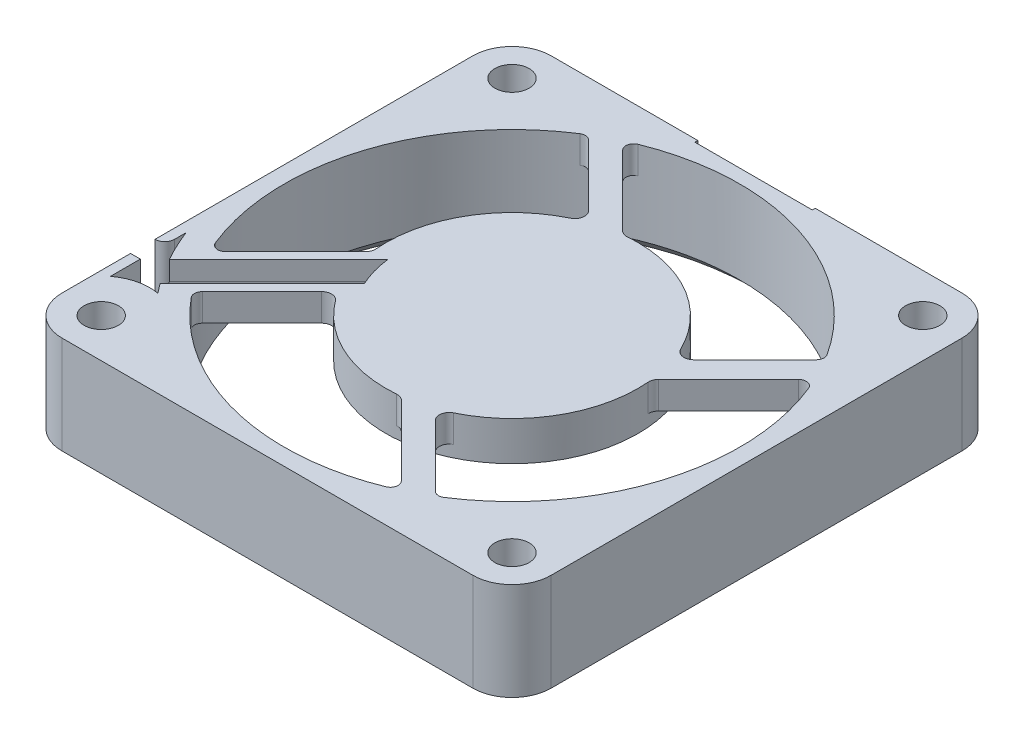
ISO-10303-21;
HEADER;
FILE_DESCRIPTION(('STEP AP214'),'2;1');
FILE_NAME('part.step','',(''),(''),'','','');
FILE_SCHEMA(('AUTOMOTIVE_DESIGN { 1 0 10303 214 1 1 1 1 }'));
ENDSEC;
DATA;
#1=APPLICATION_CONTEXT('core data for automotive mechanical design processes');
#2=APPLICATION_PROTOCOL_DEFINITION('international standard','automotive_design',2000,#1);
#3=PRODUCT_CONTEXT('',#1,'mechanical');
#4=PRODUCT('Part','Part','',(#3));
#5=PRODUCT_RELATED_PRODUCT_CATEGORY('part','',(#4));
#6=PRODUCT_DEFINITION_FORMATION('','',#4);
#7=PRODUCT_DEFINITION_CONTEXT('part definition',#1,'design');
#8=PRODUCT_DEFINITION('design','',#6,#7);
#9=PRODUCT_DEFINITION_SHAPE('','',#8);
#10=(LENGTH_UNIT() NAMED_UNIT(*) SI_UNIT(.MILLI.,.METRE.));
#11=(NAMED_UNIT(*) PLANE_ANGLE_UNIT() SI_UNIT($,.RADIAN.));
#12=(NAMED_UNIT(*) SI_UNIT($,.STERADIAN.) SOLID_ANGLE_UNIT());
#13=UNCERTAINTY_MEASURE_WITH_UNIT(LENGTH_MEASURE(1.E-05),#10,'distance_accuracy_value','');
#14=(GEOMETRIC_REPRESENTATION_CONTEXT(3) GLOBAL_UNCERTAINTY_ASSIGNED_CONTEXT((#13)) GLOBAL_UNIT_ASSIGNED_CONTEXT((#10,
#11,#12)) REPRESENTATION_CONTEXT('',''));
#15=CARTESIAN_POINT('',(0.,0.,0.));
#16=DIRECTION('',(0.,0.,1.));
#17=DIRECTION('',(1.,0.,0.));
#18=AXIS2_PLACEMENT_3D('',#15,#16,#17);
#19=CARTESIAN_POINT('',(374.876067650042,10.,-160.701447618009));
#20=DIRECTION('',(0.,-1.,0.));
#21=DIRECTION('',(0.,0.,-1.));
#22=AXIS2_PLACEMENT_3D('',#19,#20,#21);
#23=CYLINDRICAL_SURFACE('',#22,1.74999999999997);
#24=CARTESIAN_POINT('',(374.876067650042,10.,-160.701447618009));
#25=DIRECTION('',(0.,1.,0.));
#26=DIRECTION('',(0.,0.,1.));
#27=AXIS2_PLACEMENT_3D('',#24,#25,#26);
#28=CIRCLE('',#27,1.74999999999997);
#29=CARTESIAN_POINT('',(374.876067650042,10.,-158.951447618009));
#30=VERTEX_POINT('',#29);
#31=EDGE_CURVE('E1164',#30,#30,#28,.T.);
#32=ORIENTED_EDGE('',*,*,#31,.T.);
#33=EDGE_LOOP('',(#32));
#34=FACE_BOUND('',#33,.T.);
#35=CARTESIAN_POINT('',(374.876067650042,3.,-160.701447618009));
#36=DIRECTION('',(0.,-1.,0.));
#37=DIRECTION('',(0.,0.,-1.));
#38=AXIS2_PLACEMENT_3D('',#35,#36,#37);
#39=CIRCLE('',#38,1.74999999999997);
#40=CARTESIAN_POINT('',(374.876067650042,3.,-162.451447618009));
#41=VERTEX_POINT('',#40);
#42=EDGE_CURVE('E39',#41,#41,#39,.T.);
#43=ORIENTED_EDGE('',*,*,#42,.T.);
#44=EDGE_LOOP('',(#43));
#45=FACE_BOUND('',#44,.T.);
#46=ADVANCED_FACE('F34',(#34,#45),#23,.F.);
#47=CARTESIAN_POINT('',(416.876067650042,10.,-160.701447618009));
#48=DIRECTION('',(0.,-1.,0.));
#49=DIRECTION('',(0.,0.,-1.));
#50=AXIS2_PLACEMENT_3D('',#47,#48,#49);
#51=CYLINDRICAL_SURFACE('',#50,1.74999999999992);
#52=CARTESIAN_POINT('',(416.876067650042,10.,-160.701447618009));
#53=DIRECTION('',(0.,1.,0.));
#54=DIRECTION('',(0.,0.,1.));
#55=AXIS2_PLACEMENT_3D('',#52,#53,#54);
#56=CIRCLE('',#55,1.74999999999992);
#57=CARTESIAN_POINT('',(416.876067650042,10.,-158.951447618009));
#58=VERTEX_POINT('',#57);
#59=EDGE_CURVE('E1173',#58,#58,#56,.T.);
#60=ORIENTED_EDGE('',*,*,#59,.T.);
#61=EDGE_LOOP('',(#60));
#62=FACE_BOUND('',#61,.T.);
#63=CARTESIAN_POINT('',(416.876067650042,3.,-160.701447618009));
#64=DIRECTION('',(0.,-1.,0.));
#65=DIRECTION('',(0.,0.,-1.));
#66=AXIS2_PLACEMENT_3D('',#63,#64,#65);
#67=CIRCLE('',#66,1.74999999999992);
#68=CARTESIAN_POINT('',(416.876067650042,3.,-162.451447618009));
#69=VERTEX_POINT('',#68);
#70=EDGE_CURVE('E733',#69,#69,#67,.T.);
#71=ORIENTED_EDGE('',*,*,#70,.T.);
#72=EDGE_LOOP('',(#71));
#73=FACE_BOUND('',#72,.T.);
#74=ADVANCED_FACE('F1386',(#62,#73),#51,.F.);
#75=CARTESIAN_POINT('',(416.876067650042,10.,-118.701447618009));
#76=DIRECTION('',(0.,-1.,0.));
#77=DIRECTION('',(0.,0.,-1.));
#78=AXIS2_PLACEMENT_3D('',#75,#76,#77);
#79=CYLINDRICAL_SURFACE('',#78,1.74999999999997);
#80=CARTESIAN_POINT('',(416.876067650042,10.,-118.701447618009));
#81=DIRECTION('',(0.,1.,0.));
#82=DIRECTION('',(0.,0.,1.));
#83=AXIS2_PLACEMENT_3D('',#80,#81,#82);
#84=CIRCLE('',#83,1.74999999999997);
#85=CARTESIAN_POINT('',(416.876067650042,10.,-116.951447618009));
#86=VERTEX_POINT('',#85);
#87=EDGE_CURVE('E1167',#86,#86,#84,.T.);
#88=ORIENTED_EDGE('',*,*,#87,.T.);
#89=EDGE_LOOP('',(#88));
#90=FACE_BOUND('',#89,.T.);
#91=CARTESIAN_POINT('',(416.876067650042,3.,-118.701447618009));
#92=DIRECTION('',(0.,-1.,0.));
#93=DIRECTION('',(0.,0.,-1.));
#94=AXIS2_PLACEMENT_3D('',#91,#92,#93);
#95=CIRCLE('',#94,1.74999999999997);
#96=CARTESIAN_POINT('',(416.876067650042,3.,-120.451447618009));
#97=VERTEX_POINT('',#96);
#98=EDGE_CURVE('E740',#97,#97,#95,.T.);
#99=ORIENTED_EDGE('',*,*,#98,.T.);
#100=EDGE_LOOP('',(#99));
#101=FACE_BOUND('',#100,.T.);
#102=ADVANCED_FACE('F1392',(#90,#101),#79,.F.);
#103=CARTESIAN_POINT('',(374.876067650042,10.,-118.701447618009));
#104=DIRECTION('',(0.,-1.,0.));
#105=DIRECTION('',(0.,0.,-1.));
#106=AXIS2_PLACEMENT_3D('',#103,#104,#105);
#107=CYLINDRICAL_SURFACE('',#106,1.74999999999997);
#108=CARTESIAN_POINT('',(374.876067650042,10.,-118.701447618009));
#109=DIRECTION('',(0.,1.,0.));
#110=DIRECTION('',(0.,0.,1.));
#111=AXIS2_PLACEMENT_3D('',#108,#109,#110);
#112=CIRCLE('',#111,1.74999999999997);
#113=CARTESIAN_POINT('',(374.876067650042,10.,-116.951447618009));
#114=VERTEX_POINT('',#113);
#115=EDGE_CURVE('E1170',#114,#114,#112,.T.);
#116=ORIENTED_EDGE('',*,*,#115,.T.);
#117=EDGE_LOOP('',(#116));
#118=FACE_BOUND('',#117,.T.);
#119=CARTESIAN_POINT('',(374.876067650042,3.,-118.701447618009));
#120=DIRECTION('',(0.,-1.,0.));
#121=DIRECTION('',(0.,0.,-1.));
#122=AXIS2_PLACEMENT_3D('',#119,#120,#121);
#123=CIRCLE('',#122,1.74999999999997);
#124=CARTESIAN_POINT('',(374.876067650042,3.,-120.451447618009));
#125=VERTEX_POINT('',#124);
#126=EDGE_CURVE('E747',#125,#125,#123,.T.);
#127=ORIENTED_EDGE('',*,*,#126,.T.);
#128=EDGE_LOOP('',(#127));
#129=FACE_BOUND('',#128,.T.);
#130=ADVANCED_FACE('F1402',(#118,#129),#107,.F.);
#131=CARTESIAN_POINT('',(384.735343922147,10.,-131.389151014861));
#132=DIRECTION('',(0.,-1.,0.));
#133=DIRECTION('',(0.,0.,-1.));
#134=AXIS2_PLACEMENT_3D('',#131,#132,#133);
#135=CYLINDRICAL_SURFACE('',#134,1.00000000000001);
#136=DIRECTION('',(0.,-1.,0.));
#137=VECTOR('',#136,1.);
#138=CARTESIAN_POINT('',(384.02823714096,10.,-132.096257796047));
#139=LINE('',#138,#137);
#140=CARTESIAN_POINT('',(384.02823714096,10.,-132.096257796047));
#141=VERTEX_POINT('',#140);
#142=CARTESIAN_POINT('',(384.02823714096,7.2,-132.096257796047));
#143=VERTEX_POINT('',#142);
#144=EDGE_CURVE('E1161',#141,#143,#139,.T.);
#145=ORIENTED_EDGE('',*,*,#144,.T.);
#146=CARTESIAN_POINT('',(384.735343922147,7.2,-131.389151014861));
#147=DIRECTION('',(0.,-1.,0.));
#148=DIRECTION('',(0.,0.,-1.));
#149=AXIS2_PLACEMENT_3D('',#146,#147,#148);
#150=CIRCLE('',#149,1.00000000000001);
#151=CARTESIAN_POINT('',(385.536834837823,7.2,-131.987157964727));
#152=VERTEX_POINT('',#151);
#153=EDGE_CURVE('E997',#143,#152,#150,.T.);
#154=ORIENTED_EDGE('',*,*,#153,.T.);
#155=DIRECTION('',(0.,-1.,0.));
#156=VECTOR('',#155,1.);
#157=CARTESIAN_POINT('',(385.536834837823,10.,-131.987157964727));
#158=LINE('',#157,#156);
#159=CARTESIAN_POINT('',(385.536834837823,10.,-131.987157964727));
#160=VERTEX_POINT('',#159);
#161=EDGE_CURVE('E1140',#160,#152,#158,.T.);
#162=ORIENTED_EDGE('',*,*,#161,.F.);
#163=CARTESIAN_POINT('',(384.735343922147,10.,-131.389151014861));
#164=DIRECTION('',(0.,1.,0.));
#165=DIRECTION('',(0.,0.,1.));
#166=AXIS2_PLACEMENT_3D('',#163,#164,#165);
#167=CIRCLE('',#166,1.00000000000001);
#168=EDGE_CURVE('E1123',#160,#141,#167,.T.);
#169=ORIENTED_EDGE('',*,*,#168,.T.);
#170=EDGE_LOOP('',(#145,#154,#162,#169));
#171=FACE_BOUND('',#170,.T.);
#172=ADVANCED_FACE('F1398',(#171),#135,.F.);
#173=CARTESIAN_POINT('',(384.02823714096,10.,-132.096257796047));
#174=DIRECTION('',(0.707106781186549,0.,0.707106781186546));
#175=DIRECTION('',(0.707106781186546,0.,-0.707106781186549));
#176=AXIS2_PLACEMENT_3D('',#173,#174,#175);
#177=PLANE('',#176);
#178=DIRECTION('',(0.,-1.,0.));
#179=VECTOR('',#178,1.);
#180=CARTESIAN_POINT('',(377.921080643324,10.,-125.989101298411));
#181=LINE('',#180,#179);
#182=CARTESIAN_POINT('',(377.921080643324,10.,-125.989101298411));
#183=VERTEX_POINT('',#182);
#184=CARTESIAN_POINT('',(377.921080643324,7.2,-125.989101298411));
#185=VERTEX_POINT('',#184);
#186=EDGE_CURVE('E1158',#183,#185,#181,.T.);
#187=ORIENTED_EDGE('',*,*,#186,.T.);
#188=DIRECTION('',(0.707106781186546,0.,-0.707106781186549));
#189=VECTOR('',#188,1.);
#190=CARTESIAN_POINT('',(384.02823714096,7.2,-132.096257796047));
#191=LINE('',#190,#189);
#192=EDGE_CURVE('E994',#185,#143,#191,.T.);
#193=ORIENTED_EDGE('',*,*,#192,.T.);
#194=ORIENTED_EDGE('',*,*,#144,.F.);
#195=DIRECTION('',(-0.707106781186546,0.,0.707106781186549));
#196=VECTOR('',#195,1.);
#197=CARTESIAN_POINT('',(384.02823714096,10.,-132.096257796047));
#198=LINE('',#197,#196);
#199=EDGE_CURVE('E1125',#141,#183,#198,.T.);
#200=ORIENTED_EDGE('',*,*,#199,.T.);
#201=EDGE_LOOP('',(#187,#193,#194,#200));
#202=FACE_BOUND('',#201,.T.);
#203=ADVANCED_FACE('F1778',(#202),#177,.T.);
#204=CARTESIAN_POINT('',(378.486766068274,10.,-125.423415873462));
#205=DIRECTION('',(0.,-1.,0.));
#206=DIRECTION('',(0.,0.,-1.));
#207=AXIS2_PLACEMENT_3D('',#204,#205,#206);
#208=CYLINDRICAL_SURFACE('',#207,0.800000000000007);
#209=DIRECTION('',(0.,-1.,0.));
#210=VECTOR('',#209,1.);
#211=CARTESIAN_POINT('',(377.868479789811,10.,-124.915752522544));
#212=LINE('',#211,#210);
#213=CARTESIAN_POINT('',(377.868479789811,10.,-124.915752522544));
#214=VERTEX_POINT('',#213);
#215=CARTESIAN_POINT('',(377.868479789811,7.2,-124.915752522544));
#216=VERTEX_POINT('',#215);
#217=EDGE_CURVE('E1155',#214,#216,#212,.T.);
#218=ORIENTED_EDGE('',*,*,#217,.T.);
#219=CARTESIAN_POINT('',(378.486766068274,7.2,-125.423415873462));
#220=DIRECTION('',(0.,-1.,0.));
#221=DIRECTION('',(0.,0.,-1.));
#222=AXIS2_PLACEMENT_3D('',#219,#220,#221);
#223=CIRCLE('',#222,0.800000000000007);
#224=EDGE_CURVE('E991',#216,#185,#223,.T.);
#225=ORIENTED_EDGE('',*,*,#224,.T.);
#226=ORIENTED_EDGE('',*,*,#186,.F.);
#227=CARTESIAN_POINT('',(378.486766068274,10.,-125.423415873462));
#228=DIRECTION('',(0.,1.,0.));
#229=DIRECTION('',(0.,0.,1.));
#230=AXIS2_PLACEMENT_3D('',#227,#228,#229);
#231=CIRCLE('',#230,0.800000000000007);
#232=EDGE_CURVE('E1127',#183,#214,#231,.T.);
#233=ORIENTED_EDGE('',*,*,#232,.T.);
#234=EDGE_LOOP('',(#218,#225,#226,#233));
#235=FACE_BOUND('',#234,.T.);
#236=ADVANCED_FACE('F1771',(#235),#208,.F.);
#237=CARTESIAN_POINT('',(404.296102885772,10.,-118.836333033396));
#238=DIRECTION('',(0.,-1.,0.));
#239=DIRECTION('',(0.,0.,-1.));
#240=AXIS2_PLACEMENT_3D('',#237,#238,#239);
#241=CYLINDRICAL_SURFACE('',#240,0.799999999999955);
#242=DIRECTION('',(0.,-1.,0.));
#243=VECTOR('',#242,1.);
#244=CARTESIAN_POINT('',(404.861788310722,10.,-119.402018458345));
#245=LINE('',#244,#243);
#246=CARTESIAN_POINT('',(404.861788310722,10.,-119.402018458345));
#247=VERTEX_POINT('',#246);
#248=CARTESIAN_POINT('',(404.861788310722,7.2,-119.402018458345));
#249=VERTEX_POINT('',#248);
#250=EDGE_CURVE('E1149',#247,#249,#245,.T.);
#251=ORIENTED_EDGE('',*,*,#250,.T.);
#252=CARTESIAN_POINT('',(404.296102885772,7.2,-118.836333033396));
#253=DIRECTION('',(0.,-1.,0.));
#254=DIRECTION('',(0.,0.,-1.));
#255=AXIS2_PLACEMENT_3D('',#252,#253,#254);
#256=CIRCLE('',#255,0.799999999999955);
#257=CARTESIAN_POINT('',(404.595481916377,7.2,-118.09446229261));
#258=VERTEX_POINT('',#257);
#259=EDGE_CURVE('E988',#249,#258,#256,.T.);
#260=ORIENTED_EDGE('',*,*,#259,.T.);
#261=DIRECTION('',(0.,-1.,0.));
#262=VECTOR('',#261,1.);
#263=CARTESIAN_POINT('',(404.595481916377,10.,-118.09446229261));
#264=LINE('',#263,#262);
#265=CARTESIAN_POINT('',(404.595481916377,10.,-118.09446229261));
#266=VERTEX_POINT('',#265);
#267=EDGE_CURVE('E1152',#266,#258,#264,.T.);
#268=ORIENTED_EDGE('',*,*,#267,.F.);
#269=CARTESIAN_POINT('',(404.296102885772,10.,-118.836333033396));
#270=DIRECTION('',(0.,1.,0.));
#271=DIRECTION('',(0.,0.,1.));
#272=AXIS2_PLACEMENT_3D('',#269,#270,#271);
#273=CIRCLE('',#272,0.799999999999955);
#274=EDGE_CURVE('E1131',#266,#247,#273,.T.);
#275=ORIENTED_EDGE('',*,*,#274,.T.);
#276=EDGE_LOOP('',(#251,#260,#268,#275));
#277=FACE_BOUND('',#276,.T.);
#278=ADVANCED_FACE('F1767',(#277),#241,.F.);
#279=CARTESIAN_POINT('',(404.861788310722,10.,-119.402018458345));
#280=DIRECTION('',(-0.707106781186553,0.,0.707106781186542));
#281=DIRECTION('',(0.707106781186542,0.,0.707106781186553));
#282=AXIS2_PLACEMENT_3D('',#279,#280,#281);
#283=PLANE('',#282);
#284=DIRECTION('',(0.,-1.,0.));
#285=VECTOR('',#284,1.);
#286=CARTESIAN_POINT('',(397.709540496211,10.,-126.554266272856));
#287=LINE('',#286,#285);
#288=CARTESIAN_POINT('',(397.709540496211,10.,-126.554266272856));
#289=VERTEX_POINT('',#288);
#290=CARTESIAN_POINT('',(397.709540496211,7.2,-126.554266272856));
#291=VERTEX_POINT('',#290);
#292=EDGE_CURVE('E1146',#289,#291,#287,.T.);
#293=ORIENTED_EDGE('',*,*,#292,.T.);
#294=DIRECTION('',(0.707106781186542,0.,0.707106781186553));
#295=VECTOR('',#294,1.);
#296=CARTESIAN_POINT('',(404.861788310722,7.2,-119.402018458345));
#297=LINE('',#296,#295);
#298=EDGE_CURVE('E985',#291,#249,#297,.T.);
#299=ORIENTED_EDGE('',*,*,#298,.T.);
#300=ORIENTED_EDGE('',*,*,#250,.F.);
#301=DIRECTION('',(-0.707106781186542,0.,-0.707106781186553));
#302=VECTOR('',#301,1.);
#303=CARTESIAN_POINT('',(404.861788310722,10.,-119.402018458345));
#304=LINE('',#303,#302);
#305=EDGE_CURVE('E1133',#247,#289,#304,.T.);
#306=ORIENTED_EDGE('',*,*,#305,.T.);
#307=EDGE_LOOP('',(#293,#299,#300,#306));
#308=FACE_BOUND('',#307,.T.);
#309=ADVANCED_FACE('F1763',(#308),#283,.T.);
#310=CARTESIAN_POINT('',(397.002433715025,10.,-125.847159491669));
#311=DIRECTION('',(0.,-1.,0.));
#312=DIRECTION('',(0.,0.,-1.));
#313=AXIS2_PLACEMENT_3D('',#310,#311,#312);
#314=CYLINDRICAL_SURFACE('',#313,0.999999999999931);
#315=DIRECTION('',(0.,-1.,0.));
#316=VECTOR('',#315,1.);
#317=CARTESIAN_POINT('',(396.92140018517,10.,-126.843870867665));
#318=LINE('',#317,#316);
#319=CARTESIAN_POINT('',(396.92140018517,10.,-126.843870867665));
#320=VERTEX_POINT('',#319);
#321=CARTESIAN_POINT('',(396.92140018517,7.2,-126.843870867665));
#322=VERTEX_POINT('',#321);
#323=EDGE_CURVE('E1143',#320,#322,#318,.T.);
#324=ORIENTED_EDGE('',*,*,#323,.T.);
#325=CARTESIAN_POINT('',(397.002433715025,7.2,-125.847159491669));
#326=DIRECTION('',(0.,-1.,0.));
#327=DIRECTION('',(0.,0.,-1.));
#328=AXIS2_PLACEMENT_3D('',#325,#326,#327);
#329=CIRCLE('',#328,0.999999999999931);
#330=EDGE_CURVE('E982',#322,#291,#329,.T.);
#331=ORIENTED_EDGE('',*,*,#330,.T.);
#332=ORIENTED_EDGE('',*,*,#292,.F.);
#333=CARTESIAN_POINT('',(397.002433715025,10.,-125.847159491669));
#334=DIRECTION('',(0.,1.,0.));
#335=DIRECTION('',(0.,0.,1.));
#336=AXIS2_PLACEMENT_3D('',#333,#334,#335);
#337=CIRCLE('',#336,0.999999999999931);
#338=EDGE_CURVE('E1135',#289,#320,#337,.T.);
#339=ORIENTED_EDGE('',*,*,#338,.T.);
#340=EDGE_LOOP('',(#324,#331,#332,#339));
#341=FACE_BOUND('',#340,.T.);
#342=ADVANCED_FACE('F1759',(#341),#314,.F.);
#343=CARTESIAN_POINT('',(414.780605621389,10.,-151.902613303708));
#344=DIRECTION('',(0.,-1.,0.));
#345=DIRECTION('',(0.,0.,-1.));
#346=AXIS2_PLACEMENT_3D('',#343,#344,#345);
#347=CYLINDRICAL_SURFACE('',#346,0.800000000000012);
#348=DIRECTION('',(0.,-1.,0.));
#349=VECTOR('',#348,1.);
#350=CARTESIAN_POINT('',(415.452766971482,10.,-152.336432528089));
#351=LINE('',#350,#349);
#352=CARTESIAN_POINT('',(415.452766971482,10.,-152.336432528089));
#353=VERTEX_POINT('',#352);
#354=CARTESIAN_POINT('',(415.452766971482,7.2,-152.336432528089));
#355=VERTEX_POINT('',#354);
#356=EDGE_CURVE('E1120',#353,#355,#351,.T.);
#357=ORIENTED_EDGE('',*,*,#356,.T.);
#358=CARTESIAN_POINT('',(414.780605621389,7.2,-151.902613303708));
#359=DIRECTION('',(0.,-1.,0.));
#360=DIRECTION('',(0.,0.,-1.));
#361=AXIS2_PLACEMENT_3D('',#358,#359,#360);
#362=CIRCLE('',#361,0.800000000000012);
#363=CARTESIAN_POINT('',(415.346291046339,7.2,-151.336927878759));
#364=VERTEX_POINT('',#363);
#365=EDGE_CURVE('E970',#355,#364,#362,.T.);
#366=ORIENTED_EDGE('',*,*,#365,.T.);
#367=DIRECTION('',(0.,-1.,0.));
#368=VECTOR('',#367,1.);
#369=CARTESIAN_POINT('',(415.346291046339,10.,-151.336927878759));
#370=LINE('',#369,#368);
#371=CARTESIAN_POINT('',(415.346291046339,10.,-151.336927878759));
#372=VERTEX_POINT('',#371);
#373=EDGE_CURVE('E1099',#372,#364,#370,.T.);
#374=ORIENTED_EDGE('',*,*,#373,.F.);
#375=CARTESIAN_POINT('',(414.780605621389,10.,-151.902613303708));
#376=DIRECTION('',(0.,1.,0.));
#377=DIRECTION('',(0.,0.,1.));
#378=AXIS2_PLACEMENT_3D('',#375,#376,#377);
#379=CIRCLE('',#378,0.800000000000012);
#380=EDGE_CURVE('E1082',#372,#353,#379,.T.);
#381=ORIENTED_EDGE('',*,*,#380,.T.);
#382=EDGE_LOOP('',(#357,#366,#374,#381));
#383=FACE_BOUND('',#382,.T.);
#384=ADVANCED_FACE('F1755',(#383),#347,.F.);
#385=CARTESIAN_POINT('',(387.456032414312,10.,-160.566562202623));
#386=DIRECTION('',(0.,-1.,0.));
#387=DIRECTION('',(0.,0.,-1.));
#388=AXIS2_PLACEMENT_3D('',#385,#386,#387);
#389=CYLINDRICAL_SURFACE('',#388,0.799999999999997);
#390=DIRECTION('',(0.,-1.,0.));
#391=VECTOR('',#390,1.);
#392=CARTESIAN_POINT('',(386.890346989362,10.,-160.000876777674));
#393=LINE('',#392,#391);
#394=CARTESIAN_POINT('',(386.890346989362,10.,-160.000876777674));
#395=VERTEX_POINT('',#394);
#396=CARTESIAN_POINT('',(386.890346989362,7.2,-160.000876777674));
#397=VERTEX_POINT('',#396);
#398=EDGE_CURVE('E1114',#395,#397,#393,.T.);
#399=ORIENTED_EDGE('',*,*,#398,.T.);
#400=CARTESIAN_POINT('',(387.456032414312,7.2,-160.566562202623));
#401=DIRECTION('',(0.,-1.,0.));
#402=DIRECTION('',(0.,0.,-1.));
#403=AXIS2_PLACEMENT_3D('',#400,#401,#402);
#404=CIRCLE('',#403,0.799999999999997);
#405=CARTESIAN_POINT('',(387.156653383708,7.2,-161.308432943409));
#406=VERTEX_POINT('',#405);
#407=EDGE_CURVE('E979',#397,#406,#404,.T.);
#408=ORIENTED_EDGE('',*,*,#407,.T.);
#409=DIRECTION('',(0.,-1.,0.));
#410=VECTOR('',#409,1.);
#411=CARTESIAN_POINT('',(387.156653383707,10.,-161.308432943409));
#412=LINE('',#411,#410);
#413=CARTESIAN_POINT('',(387.156653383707,10.,-161.308432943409));
#414=VERTEX_POINT('',#413);
#415=EDGE_CURVE('E1117',#414,#406,#412,.T.);
#416=ORIENTED_EDGE('',*,*,#415,.F.);
#417=CARTESIAN_POINT('',(387.456032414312,10.,-160.566562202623));
#418=DIRECTION('',(0.,1.,0.));
#419=DIRECTION('',(0.,0.,1.));
#420=AXIS2_PLACEMENT_3D('',#417,#418,#419);
#421=CIRCLE('',#420,0.799999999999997);
#422=EDGE_CURVE('E1086',#414,#395,#421,.T.);
#423=ORIENTED_EDGE('',*,*,#422,.T.);
#424=EDGE_LOOP('',(#399,#408,#416,#423));
#425=FACE_BOUND('',#424,.T.);
#426=ADVANCED_FACE('F1751',(#425),#389,.F.);
#427=CARTESIAN_POINT('',(386.890346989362,10.,-160.000876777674));
#428=DIRECTION('',(0.707106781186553,0.,-0.707106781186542));
#429=DIRECTION('',(-0.707106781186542,0.,-0.707106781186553));
#430=AXIS2_PLACEMENT_3D('',#427,#428,#429);
#431=PLANE('',#430);
#432=DIRECTION('',(0.,-1.,0.));
#433=VECTOR('',#432,1.);
#434=CARTESIAN_POINT('',(394.042594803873,10.,-152.848628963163));
#435=LINE('',#434,#433);
#436=CARTESIAN_POINT('',(394.042594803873,10.,-152.848628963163));
#437=VERTEX_POINT('',#436);
#438=CARTESIAN_POINT('',(394.042594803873,7.2,-152.848628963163));
#439=VERTEX_POINT('',#438);
#440=EDGE_CURVE('E1111',#437,#439,#435,.T.);
#441=ORIENTED_EDGE('',*,*,#440,.T.);
#442=DIRECTION('',(-0.707106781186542,0.,-0.707106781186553));
#443=VECTOR('',#442,1.);
#444=CARTESIAN_POINT('',(386.890346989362,7.2,-160.000876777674));
#445=LINE('',#444,#443);
#446=EDGE_CURVE('E976',#439,#397,#445,.T.);
#447=ORIENTED_EDGE('',*,*,#446,.T.);
#448=ORIENTED_EDGE('',*,*,#398,.F.);
#449=DIRECTION('',(0.707106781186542,0.,0.707106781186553));
#450=VECTOR('',#449,1.);
#451=CARTESIAN_POINT('',(386.890346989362,10.,-160.000876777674));
#452=LINE('',#451,#450);
#453=EDGE_CURVE('E1088',#395,#437,#452,.T.);
#454=ORIENTED_EDGE('',*,*,#453,.T.);
#455=EDGE_LOOP('',(#441,#447,#448,#454));
#456=FACE_BOUND('',#455,.T.);
#457=ADVANCED_FACE('F1747',(#456),#431,.T.);
#458=CARTESIAN_POINT('',(394.749701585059,10.,-153.55573574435));
#459=DIRECTION('',(0.,-1.,0.));
#460=DIRECTION('',(0.,0.,-1.));
#461=AXIS2_PLACEMENT_3D('',#458,#459,#460);
#462=CYLINDRICAL_SURFACE('',#461,1.00000000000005);
#463=DIRECTION('',(0.,-1.,0.));
#464=VECTOR('',#463,1.);
#465=CARTESIAN_POINT('',(394.830735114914,10.,-152.559024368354));
#466=LINE('',#465,#464);
#467=CARTESIAN_POINT('',(394.830735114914,10.,-152.559024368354));
#468=VERTEX_POINT('',#467);
#469=CARTESIAN_POINT('',(394.830735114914,7.2,-152.559024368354));
#470=VERTEX_POINT('',#469);
#471=EDGE_CURVE('E1108',#468,#470,#466,.T.);
#472=ORIENTED_EDGE('',*,*,#471,.T.);
#473=CARTESIAN_POINT('',(394.749701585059,7.2,-153.55573574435));
#474=DIRECTION('',(0.,-1.,0.));
#475=DIRECTION('',(0.,0.,-1.));
#476=AXIS2_PLACEMENT_3D('',#473,#474,#475);
#477=CIRCLE('',#476,1.00000000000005);
#478=EDGE_CURVE('E973',#470,#439,#477,.T.);
#479=ORIENTED_EDGE('',*,*,#478,.T.);
#480=ORIENTED_EDGE('',*,*,#440,.F.);
#481=CARTESIAN_POINT('',(394.749701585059,10.,-153.55573574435));
#482=DIRECTION('',(0.,1.,0.));
#483=DIRECTION('',(0.,0.,1.));
#484=AXIS2_PLACEMENT_3D('',#481,#482,#483);
#485=CIRCLE('',#484,1.00000000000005);
#486=EDGE_CURVE('E1090',#437,#468,#485,.T.);
#487=ORIENTED_EDGE('',*,*,#486,.T.);
#488=EDGE_LOOP('',(#472,#479,#480,#487));
#489=FACE_BOUND('',#488,.T.);
#490=ADVANCED_FACE('F1743',(#489),#462,.F.);
#491=CARTESIAN_POINT('',(408.37606870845,10.,-145.780919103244));
#492=DIRECTION('',(0.,-1.,0.));
#493=DIRECTION('',(0.,0.,-1.));
#494=AXIS2_PLACEMENT_3D('',#491,#492,#493);
#495=CYLINDRICAL_SURFACE('',#494,1.00000000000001);
#496=DIRECTION('',(0.,-1.,0.));
#497=VECTOR('',#496,1.);
#498=CARTESIAN_POINT('',(409.083175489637,10.,-145.073812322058));
#499=LINE('',#498,#497);
#500=CARTESIAN_POINT('',(409.083175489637,10.,-145.073812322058));
#501=VERTEX_POINT('',#500);
#502=CARTESIAN_POINT('',(409.083175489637,7.2,-145.073812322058));
#503=VERTEX_POINT('',#502);
#504=EDGE_CURVE('E1102',#501,#503,#499,.T.);
#505=ORIENTED_EDGE('',*,*,#504,.T.);
#506=CARTESIAN_POINT('',(408.37606870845,7.2,-145.780919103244));
#507=DIRECTION('',(0.,-1.,0.));
#508=DIRECTION('',(0.,0.,-1.));
#509=AXIS2_PLACEMENT_3D('',#506,#507,#508);
#510=CIRCLE('',#509,1.00000000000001);
#511=CARTESIAN_POINT('',(407.476788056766,7.2,-145.343547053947));
#512=VERTEX_POINT('',#511);
#513=EDGE_CURVE('E967',#503,#512,#510,.T.);
#514=ORIENTED_EDGE('',*,*,#513,.T.);
#515=DIRECTION('',(0.,-1.,0.));
#516=VECTOR('',#515,1.);
#517=CARTESIAN_POINT('',(407.476788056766,10.,-145.343547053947));
#518=LINE('',#517,#516);
#519=CARTESIAN_POINT('',(407.476788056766,10.,-145.343547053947));
#520=VERTEX_POINT('',#519);
#521=EDGE_CURVE('E1105',#520,#512,#518,.T.);
#522=ORIENTED_EDGE('',*,*,#521,.F.);
#523=CARTESIAN_POINT('',(408.37606870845,10.,-145.780919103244));
#524=DIRECTION('',(0.,1.,0.));
#525=DIRECTION('',(0.,0.,1.));
#526=AXIS2_PLACEMENT_3D('',#523,#524,#525);
#527=CIRCLE('',#526,1.00000000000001);
#528=EDGE_CURVE('E1094',#520,#501,#527,.T.);
#529=ORIENTED_EDGE('',*,*,#528,.T.);
#530=EDGE_LOOP('',(#505,#514,#522,#529));
#531=FACE_BOUND('',#530,.T.);
#532=ADVANCED_FACE('F1739',(#531),#495,.F.);
#533=CARTESIAN_POINT('',(415.346291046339,10.,-151.336927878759));
#534=DIRECTION('',(-0.707106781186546,0.,-0.707106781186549));
#535=DIRECTION('',(-0.707106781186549,0.,0.707106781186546));
#536=AXIS2_PLACEMENT_3D('',#533,#534,#535);
#537=PLANE('',#536);
#538=ORIENTED_EDGE('',*,*,#373,.T.);
#539=DIRECTION('',(-0.707106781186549,0.,0.707106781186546));
#540=VECTOR('',#539,1.);
#541=CARTESIAN_POINT('',(415.346291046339,7.2,-151.336927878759));
#542=LINE('',#541,#540);
#543=EDGE_CURVE('E964',#364,#503,#542,.T.);
#544=ORIENTED_EDGE('',*,*,#543,.T.);
#545=ORIENTED_EDGE('',*,*,#504,.F.);
#546=DIRECTION('',(0.707106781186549,0.,-0.707106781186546));
#547=VECTOR('',#546,1.);
#548=CARTESIAN_POINT('',(415.346291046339,10.,-151.336927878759));
#549=LINE('',#548,#547);
#550=EDGE_CURVE('E1097',#501,#372,#549,.T.);
#551=ORIENTED_EDGE('',*,*,#550,.T.);
#552=EDGE_LOOP('',(#538,#544,#545,#551));
#553=FACE_BOUND('',#552,.T.);
#554=ADVANCED_FACE('F1735',(#553),#537,.T.);
#555=CARTESIAN_POINT('',(375.010953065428,10.,-131.281412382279));
#556=DIRECTION('',(0.,-1.,0.));
#557=DIRECTION('',(0.,0.,-1.));
#558=AXIS2_PLACEMENT_3D('',#555,#556,#557);
#559=CYLINDRICAL_SURFACE('',#558,0.800000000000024);
#560=DIRECTION('',(0.,-1.,0.));
#561=VECTOR('',#560,1.);
#562=CARTESIAN_POINT('',(375.576638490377,10.,-130.71572695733));
#563=LINE('',#562,#561);
#564=CARTESIAN_POINT('',(375.576638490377,10.,-130.71572695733));
#565=VERTEX_POINT('',#564);
#566=CARTESIAN_POINT('',(375.576638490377,7.2,-130.71572695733));
#567=VERTEX_POINT('',#566);
#568=EDGE_CURVE('E1079',#565,#567,#563,.T.);
#569=ORIENTED_EDGE('',*,*,#568,.T.);
#570=CARTESIAN_POINT('',(375.010953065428,7.2,-131.281412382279));
#571=DIRECTION('',(0.,-1.,0.));
#572=DIRECTION('',(0.,0.,-1.));
#573=AXIS2_PLACEMENT_3D('',#570,#571,#572);
#574=CIRCLE('',#573,0.800000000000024);
#575=CARTESIAN_POINT('',(374.269082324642,7.2,-130.982033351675));
#576=VERTEX_POINT('',#575);
#577=EDGE_CURVE('E961',#567,#576,#574,.T.);
#578=ORIENTED_EDGE('',*,*,#577,.T.);
#579=DIRECTION('',(0.,-1.,0.));
#580=VECTOR('',#579,1.);
#581=CARTESIAN_POINT('',(374.269082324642,10.,-130.982033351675));
#582=LINE('',#581,#580);
#583=CARTESIAN_POINT('',(374.269082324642,10.,-130.982033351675));
#584=VERTEX_POINT('',#583);
#585=EDGE_CURVE('E1058',#584,#576,#582,.T.);
#586=ORIENTED_EDGE('',*,*,#585,.F.);
#587=CARTESIAN_POINT('',(375.010953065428,10.,-131.281412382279));
#588=DIRECTION('',(0.,1.,0.));
#589=DIRECTION('',(0.,0.,1.));
#590=AXIS2_PLACEMENT_3D('',#587,#588,#589);
#591=CIRCLE('',#590,0.800000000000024);
#592=EDGE_CURVE('E1041',#584,#565,#591,.T.);
#593=ORIENTED_EDGE('',*,*,#592,.T.);
#594=EDGE_LOOP('',(#569,#578,#586,#593));
#595=FACE_BOUND('',#594,.T.);
#596=ADVANCED_FACE('F1731',(#595),#559,.F.);
#597=CARTESIAN_POINT('',(375.576638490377,10.,-130.71572695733));
#598=DIRECTION('',(-0.707106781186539,0.,-0.707106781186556));
#599=DIRECTION('',(-0.707106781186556,0.,0.707106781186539));
#600=AXIS2_PLACEMENT_3D('',#597,#598,#599);
#601=PLANE('',#600);
#602=DIRECTION('',(0.,-1.,0.));
#603=VECTOR('',#602,1.);
#604=CARTESIAN_POINT('',(382.728886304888,10.,-137.86797477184));
#605=LINE('',#604,#603);
#606=CARTESIAN_POINT('',(382.728886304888,10.,-137.86797477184));
#607=VERTEX_POINT('',#606);
#608=CARTESIAN_POINT('',(382.728886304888,7.2,-137.86797477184));
#609=VERTEX_POINT('',#608);
#610=EDGE_CURVE('E1076',#607,#609,#605,.T.);
#611=ORIENTED_EDGE('',*,*,#610,.T.);
#612=DIRECTION('',(-0.707106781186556,0.,0.707106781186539));
#613=VECTOR('',#612,1.);
#614=CARTESIAN_POINT('',(375.576638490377,7.2,-130.71572695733));
#615=LINE('',#614,#613);
#616=EDGE_CURVE('E958',#609,#567,#615,.T.);
#617=ORIENTED_EDGE('',*,*,#616,.T.);
#618=ORIENTED_EDGE('',*,*,#568,.F.);
#619=DIRECTION('',(0.707106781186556,0.,-0.707106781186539));
#620=VECTOR('',#619,1.);
#621=CARTESIAN_POINT('',(375.576638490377,10.,-130.71572695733));
#622=LINE('',#621,#620);
#623=EDGE_CURVE('E1043',#565,#607,#622,.T.);
#624=ORIENTED_EDGE('',*,*,#623,.T.);
#625=EDGE_LOOP('',(#611,#617,#618,#624));
#626=FACE_BOUND('',#625,.T.);
#627=ADVANCED_FACE('F1727',(#626),#601,.T.);
#628=CARTESIAN_POINT('',(382.021779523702,10.,-138.575081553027));
#629=DIRECTION('',(0.,-1.,0.));
#630=DIRECTION('',(0.,0.,-1.));
#631=AXIS2_PLACEMENT_3D('',#628,#629,#630);
#632=CYLINDRICAL_SURFACE('',#631,0.999999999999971);
#633=DIRECTION('',(0.,-1.,0.));
#634=VECTOR('',#633,1.);
#635=CARTESIAN_POINT('',(383.018490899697,10.,-138.656115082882));
#636=LINE('',#635,#634);
#637=CARTESIAN_POINT('',(383.018490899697,10.,-138.656115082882));
#638=VERTEX_POINT('',#637);
#639=CARTESIAN_POINT('',(383.018490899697,7.2,-138.656115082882));
#640=VERTEX_POINT('',#639);
#641=EDGE_CURVE('E1073',#638,#640,#636,.T.);
#642=ORIENTED_EDGE('',*,*,#641,.T.);
#643=CARTESIAN_POINT('',(382.021779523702,7.2,-138.575081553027));
#644=DIRECTION('',(0.,-1.,0.));
#645=DIRECTION('',(0.,0.,-1.));
#646=AXIS2_PLACEMENT_3D('',#643,#644,#645);
#647=CIRCLE('',#646,0.999999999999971);
#648=EDGE_CURVE('E955',#640,#609,#647,.T.);
#649=ORIENTED_EDGE('',*,*,#648,.T.);
#650=ORIENTED_EDGE('',*,*,#610,.F.);
#651=CARTESIAN_POINT('',(382.021779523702,10.,-138.575081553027));
#652=DIRECTION('',(0.,1.,0.));
#653=DIRECTION('',(0.,0.,1.));
#654=AXIS2_PLACEMENT_3D('',#651,#652,#653);
#655=CIRCLE('',#654,0.999999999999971);
#656=EDGE_CURVE('E1045',#607,#638,#655,.T.);
#657=ORIENTED_EDGE('',*,*,#656,.T.);
#658=EDGE_LOOP('',(#642,#649,#650,#657));
#659=FACE_BOUND('',#658,.T.);
#660=ADVANCED_FACE('F1723',(#659),#632,.F.);
#661=CARTESIAN_POINT('',(389.796596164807,10.,-152.201448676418));
#662=DIRECTION('',(0.,-1.,0.));
#663=DIRECTION('',(0.,0.,-1.));
#664=AXIS2_PLACEMENT_3D('',#661,#662,#663);
#665=CYLINDRICAL_SURFACE('',#664,1.00000000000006);
#666=DIRECTION('',(0.,-1.,0.));
#667=VECTOR('',#666,1.);
#668=CARTESIAN_POINT('',(390.503702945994,10.,-152.908555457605));
#669=LINE('',#668,#667);
#670=CARTESIAN_POINT('',(390.503702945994,10.,-152.908555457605));
#671=VERTEX_POINT('',#670);
#672=CARTESIAN_POINT('',(390.503702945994,7.2,-152.908555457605));
#673=VERTEX_POINT('',#672);
#674=EDGE_CURVE('E1067',#671,#673,#669,.T.);
#675=ORIENTED_EDGE('',*,*,#674,.T.);
#676=CARTESIAN_POINT('',(389.796596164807,7.2,-152.201448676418));
#677=DIRECTION('',(0.,-1.,0.));
#678=DIRECTION('',(0.,0.,-1.));
#679=AXIS2_PLACEMENT_3D('',#676,#677,#678);
#680=CIRCLE('',#679,1.00000000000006);
#681=CARTESIAN_POINT('',(390.233968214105,7.2,-151.302168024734));
#682=VERTEX_POINT('',#681);
#683=EDGE_CURVE('E952',#673,#682,#680,.T.);
#684=ORIENTED_EDGE('',*,*,#683,.T.);
#685=DIRECTION('',(0.,-1.,0.));
#686=VECTOR('',#685,1.);
#687=CARTESIAN_POINT('',(390.233968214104,10.,-151.302168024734));
#688=LINE('',#687,#686);
#689=CARTESIAN_POINT('',(390.233968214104,10.,-151.302168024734));
#690=VERTEX_POINT('',#689);
#691=EDGE_CURVE('E1070',#690,#682,#688,.T.);
#692=ORIENTED_EDGE('',*,*,#691,.F.);
#693=CARTESIAN_POINT('',(389.796596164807,10.,-152.201448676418));
#694=DIRECTION('',(0.,1.,0.));
#695=DIRECTION('',(0.,0.,1.));
#696=AXIS2_PLACEMENT_3D('',#693,#694,#695);
#697=CIRCLE('',#696,1.00000000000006);
#698=EDGE_CURVE('E1049',#690,#671,#697,.T.);
#699=ORIENTED_EDGE('',*,*,#698,.T.);
#700=EDGE_LOOP('',(#675,#684,#692,#699));
#701=FACE_BOUND('',#700,.T.);
#702=ADVANCED_FACE('F1719',(#701),#665,.F.);
#703=CARTESIAN_POINT('',(390.503702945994,10.,-152.908555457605));
#704=DIRECTION('',(-0.707106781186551,0.,0.707106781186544));
#705=DIRECTION('',(0.707106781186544,0.,0.707106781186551));
#706=AXIS2_PLACEMENT_3D('',#703,#704,#705);
#707=PLANE('',#706);
#708=DIRECTION('',(0.,-1.,0.));
#709=VECTOR('',#708,1.);
#710=CARTESIAN_POINT('',(384.240587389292,10.,-159.171671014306));
#711=LINE('',#710,#709);
#712=CARTESIAN_POINT('',(384.240587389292,10.,-159.171671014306));
#713=VERTEX_POINT('',#712);
#714=CARTESIAN_POINT('',(384.240587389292,7.2,-159.171671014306));
#715=VERTEX_POINT('',#714);
#716=EDGE_CURVE('E1064',#713,#715,#711,.T.);
#717=ORIENTED_EDGE('',*,*,#716,.T.);
#718=DIRECTION('',(0.707106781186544,0.,0.707106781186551));
#719=VECTOR('',#718,1.);
#720=CARTESIAN_POINT('',(390.503702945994,7.2,-152.908555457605));
#721=LINE('',#720,#719);
#722=EDGE_CURVE('E949',#715,#673,#721,.T.);
#723=ORIENTED_EDGE('',*,*,#722,.T.);
#724=ORIENTED_EDGE('',*,*,#674,.F.);
#725=DIRECTION('',(-0.707106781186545,0.,-0.707106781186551));
#726=VECTOR('',#725,1.);
#727=CARTESIAN_POINT('',(390.503702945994,10.,-152.908555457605));
#728=LINE('',#727,#726);
#729=EDGE_CURVE('E1051',#671,#713,#728,.T.);
#730=ORIENTED_EDGE('',*,*,#729,.T.);
#731=EDGE_LOOP('',(#717,#723,#724,#730));
#732=FACE_BOUND('',#731,.T.);
#733=ADVANCED_FACE('F1715',(#732),#707,.T.);
#734=CARTESIAN_POINT('',(383.674901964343,10.,-158.605985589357));
#735=DIRECTION('',(0.,-1.,0.));
#736=DIRECTION('',(0.,0.,-1.));
#737=AXIS2_PLACEMENT_3D('',#734,#735,#736);
#738=CYLINDRICAL_SURFACE('',#737,0.800000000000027);
#739=DIRECTION('',(0.,-1.,0.));
#740=VECTOR('',#739,1.);
#741=CARTESIAN_POINT('',(383.241082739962,10.,-159.278146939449));
#742=LINE('',#741,#740);
#743=CARTESIAN_POINT('',(383.241082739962,10.,-159.278146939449));
#744=VERTEX_POINT('',#743);
#745=CARTESIAN_POINT('',(383.241082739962,7.2,-159.278146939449));
#746=VERTEX_POINT('',#745);
#747=EDGE_CURVE('E1061',#744,#746,#742,.T.);
#748=ORIENTED_EDGE('',*,*,#747,.T.);
#749=CARTESIAN_POINT('',(383.674901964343,7.2,-158.605985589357));
#750=DIRECTION('',(0.,-1.,0.));
#751=DIRECTION('',(0.,0.,-1.));
#752=AXIS2_PLACEMENT_3D('',#749,#750,#751);
#753=CIRCLE('',#752,0.800000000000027);
#754=EDGE_CURVE('E946',#746,#715,#753,.T.);
#755=ORIENTED_EDGE('',*,*,#754,.T.);
#756=ORIENTED_EDGE('',*,*,#716,.F.);
#757=CARTESIAN_POINT('',(383.674901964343,10.,-158.605985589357));
#758=DIRECTION('',(0.,1.,0.));
#759=DIRECTION('',(0.,0.,1.));
#760=AXIS2_PLACEMENT_3D('',#757,#758,#759);
#761=CIRCLE('',#760,0.800000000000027);
#762=EDGE_CURVE('E1053',#713,#744,#761,.T.);
#763=ORIENTED_EDGE('',*,*,#762,.T.);
#764=EDGE_LOOP('',(#748,#755,#756,#763));
#765=FACE_BOUND('',#764,.T.);
#766=ADVANCED_FACE('F1711',(#765),#738,.F.);
#767=CARTESIAN_POINT('',(401.955539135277,10.,-127.201446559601));
#768=DIRECTION('',(0.,-1.,0.));
#769=DIRECTION('',(0.,0.,-1.));
#770=AXIS2_PLACEMENT_3D('',#767,#768,#769);
#771=CYLINDRICAL_SURFACE('',#770,1.00000000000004);
#772=DIRECTION('',(0.,-1.,0.));
#773=VECTOR('',#772,1.);
#774=CARTESIAN_POINT('',(401.24843235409,10.,-126.494339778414));
#775=LINE('',#774,#773);
#776=CARTESIAN_POINT('',(401.24843235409,10.,-126.494339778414));
#777=VERTEX_POINT('',#776);
#778=CARTESIAN_POINT('',(401.24843235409,7.2,-126.494339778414));
#779=VERTEX_POINT('',#778);
#780=EDGE_CURVE('E1038',#777,#779,#775,.T.);
#781=ORIENTED_EDGE('',*,*,#780,.T.);
#782=CARTESIAN_POINT('',(401.955539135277,7.2,-127.201446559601));
#783=DIRECTION('',(0.,-1.,0.));
#784=DIRECTION('',(0.,0.,-1.));
#785=AXIS2_PLACEMENT_3D('',#782,#783,#784);
#786=CIRCLE('',#785,1.00000000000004);
#787=CARTESIAN_POINT('',(401.518167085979,7.2,-128.100727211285));
#788=VERTEX_POINT('',#787);
#789=EDGE_CURVE('E943',#779,#788,#786,.T.);
#790=ORIENTED_EDGE('',*,*,#789,.T.);
#791=DIRECTION('',(0.,-1.,0.));
#792=VECTOR('',#791,1.);
#793=CARTESIAN_POINT('',(401.518167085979,10.,-128.100727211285));
#794=LINE('',#793,#792);
#795=CARTESIAN_POINT('',(401.518167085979,10.,-128.100727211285));
#796=VERTEX_POINT('',#795);
#797=EDGE_CURVE('E1017',#796,#788,#794,.T.);
#798=ORIENTED_EDGE('',*,*,#797,.F.);
#799=CARTESIAN_POINT('',(401.955539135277,10.,-127.201446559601));
#800=DIRECTION('',(0.,1.,0.));
#801=DIRECTION('',(0.,0.,1.));
#802=AXIS2_PLACEMENT_3D('',#799,#800,#801);
#803=CIRCLE('',#802,1.00000000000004);
#804=EDGE_CURVE('E1000',#796,#777,#803,.T.);
#805=ORIENTED_EDGE('',*,*,#804,.T.);
#806=EDGE_LOOP('',(#781,#790,#798,#805));
#807=FACE_BOUND('',#806,.T.);
#808=ADVANCED_FACE('F1707',(#807),#771,.F.);
#809=CARTESIAN_POINT('',(401.24843235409,10.,-126.494339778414));
#810=DIRECTION('',(0.707106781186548,0.,-0.707106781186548));
#811=DIRECTION('',(-0.707106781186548,0.,-0.707106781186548));
#812=AXIS2_PLACEMENT_3D('',#809,#810,#811);
#813=PLANE('',#812);
#814=DIRECTION('',(0.,-1.,0.));
#815=VECTOR('',#814,1.);
#816=CARTESIAN_POINT('',(407.511547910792,10.,-120.231224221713));
#817=LINE('',#816,#815);
#818=CARTESIAN_POINT('',(407.511547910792,10.,-120.231224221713));
#819=VERTEX_POINT('',#818);
#820=CARTESIAN_POINT('',(407.511547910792,7.2,-120.231224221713));
#821=VERTEX_POINT('',#820);
#822=EDGE_CURVE('E1035',#819,#821,#817,.T.);
#823=ORIENTED_EDGE('',*,*,#822,.T.);
#824=DIRECTION('',(-0.707106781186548,0.,-0.707106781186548));
#825=VECTOR('',#824,1.);
#826=CARTESIAN_POINT('',(401.24843235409,7.2,-126.494339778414));
#827=LINE('',#826,#825);
#828=EDGE_CURVE('E940',#821,#779,#827,.T.);
#829=ORIENTED_EDGE('',*,*,#828,.T.);
#830=ORIENTED_EDGE('',*,*,#780,.F.);
#831=DIRECTION('',(0.707106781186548,0.,0.707106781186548));
#832=VECTOR('',#831,1.);
#833=CARTESIAN_POINT('',(401.24843235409,10.,-126.494339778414));
#834=LINE('',#833,#832);
#835=EDGE_CURVE('E1002',#777,#819,#834,.T.);
#836=ORIENTED_EDGE('',*,*,#835,.T.);
#837=EDGE_LOOP('',(#823,#829,#830,#836));
#838=FACE_BOUND('',#837,.T.);
#839=ADVANCED_FACE('F1703',(#838),#813,.T.);
#840=CARTESIAN_POINT('',(408.077233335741,10.,-120.796909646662));
#841=DIRECTION('',(0.,-1.,0.));
#842=DIRECTION('',(0.,0.,-1.));
#843=AXIS2_PLACEMENT_3D('',#840,#841,#842);
#844=CYLINDRICAL_SURFACE('',#843,0.800000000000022);
#845=DIRECTION('',(0.,-1.,0.));
#846=VECTOR('',#845,1.);
#847=CARTESIAN_POINT('',(408.511052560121,10.,-120.124748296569));
#848=LINE('',#847,#846);
#849=CARTESIAN_POINT('',(408.511052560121,10.,-120.124748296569));
#850=VERTEX_POINT('',#849);
#851=CARTESIAN_POINT('',(408.511052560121,7.2,-120.124748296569));
#852=VERTEX_POINT('',#851);
#853=EDGE_CURVE('E1032',#850,#852,#848,.T.);
#854=ORIENTED_EDGE('',*,*,#853,.T.);
#855=CARTESIAN_POINT('',(408.077233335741,7.2,-120.796909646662));
#856=DIRECTION('',(0.,-1.,0.));
#857=DIRECTION('',(0.,0.,-1.));
#858=AXIS2_PLACEMENT_3D('',#855,#856,#857);
#859=CIRCLE('',#858,0.800000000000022);
#860=EDGE_CURVE('E937',#852,#821,#859,.T.);
#861=ORIENTED_EDGE('',*,*,#860,.T.);
#862=ORIENTED_EDGE('',*,*,#822,.F.);
#863=CARTESIAN_POINT('',(408.077233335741,10.,-120.796909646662));
#864=DIRECTION('',(0.,1.,0.));
#865=DIRECTION('',(0.,0.,1.));
#866=AXIS2_PLACEMENT_3D('',#863,#864,#865);
#867=CIRCLE('',#866,0.800000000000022);
#868=EDGE_CURVE('E1004',#819,#850,#867,.T.);
#869=ORIENTED_EDGE('',*,*,#868,.T.);
#870=EDGE_LOOP('',(#854,#861,#862,#869));
#871=FACE_BOUND('',#870,.T.);
#872=ADVANCED_FACE('F1699',(#871),#844,.F.);
#873=CARTESIAN_POINT('',(416.741182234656,10.,-148.12148285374));
#874=DIRECTION('',(0.,-1.,0.));
#875=DIRECTION('',(0.,0.,-1.));
#876=AXIS2_PLACEMENT_3D('',#873,#874,#875);
#877=CYLINDRICAL_SURFACE('',#876,0.799999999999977);
#878=DIRECTION('',(0.,-1.,0.));
#879=VECTOR('',#878,1.);
#880=CARTESIAN_POINT('',(416.175496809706,10.,-148.687168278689));
#881=LINE('',#880,#879);
#882=CARTESIAN_POINT('',(416.175496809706,10.,-148.687168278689));
#883=VERTEX_POINT('',#882);
#884=CARTESIAN_POINT('',(416.175496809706,7.2,-148.687168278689));
#885=VERTEX_POINT('',#884);
#886=EDGE_CURVE('E1026',#883,#885,#881,.T.);
#887=ORIENTED_EDGE('',*,*,#886,.T.);
#888=CARTESIAN_POINT('',(416.741182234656,7.2,-148.12148285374));
#889=DIRECTION('',(0.,-1.,0.));
#890=DIRECTION('',(0.,0.,-1.));
#891=AXIS2_PLACEMENT_3D('',#888,#889,#890);
#892=CIRCLE('',#891,0.799999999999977);
#893=CARTESIAN_POINT('',(417.483052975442,7.2,-148.420861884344));
#894=VERTEX_POINT('',#893);
#895=EDGE_CURVE('E934',#885,#894,#892,.T.);
#896=ORIENTED_EDGE('',*,*,#895,.T.);
#897=DIRECTION('',(0.,-1.,0.));
#898=VECTOR('',#897,1.);
#899=CARTESIAN_POINT('',(417.483052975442,10.,-148.420861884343));
#900=LINE('',#899,#898);
#901=CARTESIAN_POINT('',(417.483052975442,10.,-148.420861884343));
#902=VERTEX_POINT('',#901);
#903=EDGE_CURVE('E1029',#902,#894,#900,.T.);
#904=ORIENTED_EDGE('',*,*,#903,.F.);
#905=CARTESIAN_POINT('',(416.741182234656,10.,-148.12148285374));
#906=DIRECTION('',(0.,1.,0.));
#907=DIRECTION('',(0.,0.,1.));
#908=AXIS2_PLACEMENT_3D('',#905,#906,#907);
#909=CIRCLE('',#908,0.799999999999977);
#910=EDGE_CURVE('E1008',#902,#883,#909,.T.);
#911=ORIENTED_EDGE('',*,*,#910,.T.);
#912=EDGE_LOOP('',(#887,#896,#904,#911));
#913=FACE_BOUND('',#912,.T.);
#914=ADVANCED_FACE('F1695',(#913),#877,.F.);
#915=CARTESIAN_POINT('',(409.023248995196,10.,-141.534920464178));
#916=DIRECTION('',(0.707106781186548,0.,0.707106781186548));
#917=DIRECTION('',(0.707106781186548,0.,-0.707106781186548));
#918=AXIS2_PLACEMENT_3D('',#915,#916,#917);
#919=PLANE('',#918);
#920=DIRECTION('',(0.,-1.,0.));
#921=VECTOR('',#920,1.);
#922=CARTESIAN_POINT('',(409.023248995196,10.,-141.534920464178));
#923=LINE('',#922,#921);
#924=CARTESIAN_POINT('',(409.023248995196,10.,-141.534920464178));
#925=VERTEX_POINT('',#924);
#926=CARTESIAN_POINT('',(409.023248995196,7.2,-141.534920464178));
#927=VERTEX_POINT('',#926);
#928=EDGE_CURVE('E1023',#925,#927,#923,.T.);
#929=ORIENTED_EDGE('',*,*,#928,.T.);
#930=DIRECTION('',(0.707106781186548,0.,-0.707106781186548));
#931=VECTOR('',#930,1.);
#932=CARTESIAN_POINT('',(409.023248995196,7.2,-141.534920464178));
#933=LINE('',#932,#931);
#934=EDGE_CURVE('E931',#927,#885,#933,.T.);
#935=ORIENTED_EDGE('',*,*,#934,.T.);
#936=ORIENTED_EDGE('',*,*,#886,.F.);
#937=DIRECTION('',(-0.707106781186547,0.,0.707106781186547));
#938=VECTOR('',#937,1.);
#939=CARTESIAN_POINT('',(409.023248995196,10.,-141.534920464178));
#940=LINE('',#939,#938);
#941=EDGE_CURVE('E1010',#883,#925,#940,.T.);
#942=ORIENTED_EDGE('',*,*,#941,.T.);
#943=EDGE_LOOP('',(#929,#935,#936,#942));
#944=FACE_BOUND('',#943,.T.);
#945=ADVANCED_FACE('F1691',(#944),#919,.T.);
#946=CARTESIAN_POINT('',(409.730355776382,10.,-140.827813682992));
#947=DIRECTION('',(0.,-1.,0.));
#948=DIRECTION('',(0.,0.,-1.));
#949=AXIS2_PLACEMENT_3D('',#946,#947,#948);
#950=CYLINDRICAL_SURFACE('',#949,1.00000000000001);
#951=DIRECTION('',(0.,-1.,0.));
#952=VECTOR('',#951,1.);
#953=CARTESIAN_POINT('',(408.733644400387,10.,-140.746780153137));
#954=LINE('',#953,#952);
#955=CARTESIAN_POINT('',(408.733644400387,10.,-140.746780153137));
#956=VERTEX_POINT('',#955);
#957=CARTESIAN_POINT('',(408.733644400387,7.2,-140.746780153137));
#958=VERTEX_POINT('',#957);
#959=EDGE_CURVE('E1020',#956,#958,#954,.T.);
#960=ORIENTED_EDGE('',*,*,#959,.T.);
#961=CARTESIAN_POINT('',(409.730355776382,7.2,-140.827813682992));
#962=DIRECTION('',(0.,-1.,0.));
#963=DIRECTION('',(0.,0.,-1.));
#964=AXIS2_PLACEMENT_3D('',#961,#962,#963);
#965=CIRCLE('',#964,1.00000000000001);
#966=EDGE_CURVE('E927',#958,#927,#965,.T.);
#967=ORIENTED_EDGE('',*,*,#966,.T.);
#968=ORIENTED_EDGE('',*,*,#928,.F.);
#969=CARTESIAN_POINT('',(409.730355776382,10.,-140.827813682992));
#970=DIRECTION('',(0.,1.,0.));
#971=DIRECTION('',(0.,0.,1.));
#972=AXIS2_PLACEMENT_3D('',#969,#970,#971);
#973=CIRCLE('',#972,1.00000000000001);
#974=EDGE_CURVE('E1012',#925,#956,#973,.T.);
#975=ORIENTED_EDGE('',*,*,#974,.T.);
#976=EDGE_LOOP('',(#960,#967,#968,#975));
#977=FACE_BOUND('',#976,.T.);
#978=ADVANCED_FACE('F1684',(#977),#950,.F.);
#979=CARTESIAN_POINT('',(395.876067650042,6.,-139.701447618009));
#980=DIRECTION('',(0.,-1.,0.));
#981=DIRECTION('',(0.,0.,-1.));
#982=AXIS2_PLACEMENT_3D('',#979,#980,#981);
#983=PLANE('',#982);
#984=CARTESIAN_POINT('',(395.876067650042,6.,-139.701447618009));
#985=DIRECTION('',(0.,-1.,0.));
#986=DIRECTION('',(0.,0.,-1.));
#987=AXIS2_PLACEMENT_3D('',#984,#985,#986);
#988=CIRCLE('',#987,12.9);
#989=CARTESIAN_POINT('',(395.876067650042,6.,-152.601447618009));
#990=VERTEX_POINT('',#989);
#991=EDGE_CURVE('E1314',#990,#990,#988,.F.);
#992=ORIENTED_EDGE('',*,*,#991,.F.);
#993=EDGE_LOOP('',(#992));
#994=FACE_BOUND('',#993,.T.);
#995=ADVANCED_FACE('F1681',(#994),#983,.T.);
#996=CARTESIAN_POINT('',(395.876067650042,10.,-139.701447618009));
#997=DIRECTION('',(0.,-1.,0.));
#998=DIRECTION('',(0.,0.,-1.));
#999=AXIS2_PLACEMENT_3D('',#996,#997,#998);
#1000=CYLINDRICAL_SURFACE('',#999,12.9);
#1001=ORIENTED_EDGE('',*,*,#991,.T.);
#1002=EDGE_LOOP('',(#1001));
#1003=FACE_BOUND('',#1002,.T.);
#1004=ORIENTED_EDGE('',*,*,#161,.T.);
#1005=CARTESIAN_POINT('',(395.876067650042,7.2,-139.701447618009));
#1006=DIRECTION('',(0.,-1.,0.));
#1007=DIRECTION('',(0.,0.,-1.));
#1008=AXIS2_PLACEMENT_3D('',#1005,#1006,#1007);
#1009=CIRCLE('',#1008,12.9);
#1010=EDGE_CURVE('E1811',#152,#640,#1009,.T.);
#1011=ORIENTED_EDGE('',*,*,#1010,.T.);
#1012=ORIENTED_EDGE('',*,*,#641,.F.);
#1013=CARTESIAN_POINT('',(395.876067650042,10.,-139.701447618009));
#1014=DIRECTION('',(0.,-1.,0.));
#1015=DIRECTION('',(0.,0.,1.));
#1016=AXIS2_PLACEMENT_3D('',#1013,#1014,#1015);
#1017=CIRCLE('',#1016,12.9);
#1018=EDGE_CURVE('E1047',#638,#690,#1017,.T.);
#1019=ORIENTED_EDGE('',*,*,#1018,.T.);
#1020=ORIENTED_EDGE('',*,*,#691,.T.);
#1021=EDGE_CURVE('E915',#682,#470,#1009,.T.);
#1022=ORIENTED_EDGE('',*,*,#1021,.T.);
#1023=ORIENTED_EDGE('',*,*,#471,.F.);
#1024=CARTESIAN_POINT('',(395.876067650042,10.,-139.701447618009));
#1025=DIRECTION('',(0.,-1.,0.));
#1026=DIRECTION('',(0.,0.,1.));
#1027=AXIS2_PLACEMENT_3D('',#1024,#1025,#1026);
#1028=CIRCLE('',#1027,12.8999999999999);
#1029=EDGE_CURVE('E1092',#468,#520,#1028,.T.);
#1030=ORIENTED_EDGE('',*,*,#1029,.T.);
#1031=ORIENTED_EDGE('',*,*,#521,.T.);
#1032=EDGE_CURVE('E920',#512,#958,#1009,.T.);
#1033=ORIENTED_EDGE('',*,*,#1032,.T.);
#1034=ORIENTED_EDGE('',*,*,#959,.F.);
#1035=CARTESIAN_POINT('',(395.876067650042,10.,-139.701447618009));
#1036=DIRECTION('',(0.,-1.,0.));
#1037=DIRECTION('',(0.,0.,1.));
#1038=AXIS2_PLACEMENT_3D('',#1035,#1036,#1037);
#1039=CIRCLE('',#1038,12.9);
#1040=EDGE_CURVE('E1015',#956,#796,#1039,.T.);
#1041=ORIENTED_EDGE('',*,*,#1040,.T.);
#1042=ORIENTED_EDGE('',*,*,#797,.T.);
#1043=EDGE_CURVE('E924',#788,#322,#1009,.T.);
#1044=ORIENTED_EDGE('',*,*,#1043,.T.);
#1045=ORIENTED_EDGE('',*,*,#323,.F.);
#1046=CARTESIAN_POINT('',(395.876067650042,10.,-139.701447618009));
#1047=DIRECTION('',(0.,-1.,0.));
#1048=DIRECTION('',(0.,0.,1.));
#1049=AXIS2_PLACEMENT_3D('',#1046,#1047,#1048);
#1050=CIRCLE('',#1049,12.9);
#1051=EDGE_CURVE('E1138',#320,#160,#1050,.T.);
#1052=ORIENTED_EDGE('',*,*,#1051,.T.);
#1053=EDGE_LOOP('',(#1004,#1011,#1012,#1019,#1020,#1022,#1023,#1030,#1031,#1033,#1034,#1041,
#1042,#1044,#1045,#1052));
#1054=FACE_BOUND('',#1053,.T.);
#1055=ADVANCED_FACE('F1408',(#1003,#1054),#1000,.T.);
#1056=CARTESIAN_POINT('',(395.876067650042,10.,-139.701447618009));
#1057=DIRECTION('',(0.,1.,0.));
#1058=DIRECTION('',(0.,0.,1.));
#1059=AXIS2_PLACEMENT_3D('',#1056,#1057,#1058);
#1060=PLANE('',#1059);
#1061=DIRECTION('',(0.707106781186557,0.,-0.707106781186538));
#1062=VECTOR('',#1061,1.);
#1063=CARTESIAN_POINT('',(385.49913073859,10.,-134.981364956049));
#1064=LINE('',#1063,#1062);
#1065=CARTESIAN_POINT('',(375.060666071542,10.,-124.542900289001));
#1066=VERTEX_POINT('',#1065);
#1067=CARTESIAN_POINT('',(385.49913073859,10.,-134.981364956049));
#1068=VERTEX_POINT('',#1067);
#1069=EDGE_CURVE('E702',#1066,#1068,#1064,.T.);
#1070=ORIENTED_EDGE('',*,*,#1069,.F.);
#1071=CARTESIAN_POINT('',(395.876067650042,10.,-139.701447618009));
#1072=DIRECTION('',(0.,1.,0.));
#1073=DIRECTION('',(0.,0.,1.));
#1074=AXIS2_PLACEMENT_3D('',#1071,#1072,#1073);
#1075=CIRCLE('',#1074,25.75);
#1076=CARTESIAN_POINT('',(375.811436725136,10.,-123.562269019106));
#1077=VERTEX_POINT('',#1076);
#1078=EDGE_CURVE('E1181',#1066,#1077,#1075,.T.);
#1079=ORIENTED_EDGE('',*,*,#1078,.T.);
#1080=CARTESIAN_POINT('',(374.876067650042,10.,-118.701447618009));
#1081=DIRECTION('',(0.,1.,0.));
#1082=DIRECTION('',(0.,0.,1.));
#1083=AXIS2_PLACEMENT_3D('',#1080,#1081,#1082);
#1084=CIRCLE('',#1083,4.94999999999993);
#1085=CARTESIAN_POINT('',(371.876067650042,10.,-122.638769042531));
#1086=VERTEX_POINT('',#1085);
#1087=EDGE_CURVE('E1180',#1077,#1086,#1084,.T.);
#1088=ORIENTED_EDGE('',*,*,#1087,.T.);
#1089=DIRECTION('',(0.,0.,-1.));
#1090=VECTOR('',#1089,1.);
#1091=CARTESIAN_POINT('',(371.876067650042,10.,-122.638769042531));
#1092=LINE('',#1091,#1090);
#1093=CARTESIAN_POINT('',(371.876067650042,10.,-125.701447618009));
#1094=VERTEX_POINT('',#1093);
#1095=EDGE_CURVE('E1183',#1086,#1094,#1092,.T.);
#1096=ORIENTED_EDGE('',*,*,#1095,.T.);
#1097=DIRECTION('',(-1.,0.,0.));
#1098=VECTOR('',#1097,1.);
#1099=CARTESIAN_POINT('',(370.876067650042,10.,-125.701447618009));
#1100=LINE('',#1099,#1098);
#1101=CARTESIAN_POINT('',(370.876067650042,10.,-125.701447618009));
#1102=VERTEX_POINT('',#1101);
#1103=EDGE_CURVE('E1185',#1094,#1102,#1100,.T.);
#1104=ORIENTED_EDGE('',*,*,#1103,.T.);
#1105=DIRECTION('',(0.,0.,1.));
#1106=VECTOR('',#1105,1.);
#1107=CARTESIAN_POINT('',(370.876067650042,10.,-125.701447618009));
#1108=LINE('',#1107,#1106);
#1109=CARTESIAN_POINT('',(370.876067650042,10.,-118.701447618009));
#1110=VERTEX_POINT('',#1109);
#1111=EDGE_CURVE('E1187',#1102,#1110,#1108,.T.);
#1112=ORIENTED_EDGE('',*,*,#1111,.T.);
#1113=CARTESIAN_POINT('',(374.876067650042,10.,-118.701447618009));
#1114=DIRECTION('',(0.,1.,0.));
#1115=DIRECTION('',(0.,0.,1.));
#1116=AXIS2_PLACEMENT_3D('',#1113,#1114,#1115);
#1117=CIRCLE('',#1116,4.00000000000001);
#1118=CARTESIAN_POINT('',(374.876067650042,10.,-114.701447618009));
#1119=VERTEX_POINT('',#1118);
#1120=EDGE_CURVE('E1189',#1110,#1119,#1117,.T.);
#1121=ORIENTED_EDGE('',*,*,#1120,.T.);
#1122=DIRECTION('',(1.,0.,0.));
#1123=VECTOR('',#1122,1.);
#1124=CARTESIAN_POINT('',(374.876067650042,10.,-114.701447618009));
#1125=LINE('',#1124,#1123);
#1126=CARTESIAN_POINT('',(416.876067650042,10.,-114.701447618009));
#1127=VERTEX_POINT('',#1126);
#1128=EDGE_CURVE('E1191',#1119,#1127,#1125,.T.);
#1129=ORIENTED_EDGE('',*,*,#1128,.T.);
#1130=CARTESIAN_POINT('',(416.876067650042,10.,-118.701447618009));
#1131=DIRECTION('',(0.,1.,0.));
#1132=DIRECTION('',(0.,0.,1.));
#1133=AXIS2_PLACEMENT_3D('',#1130,#1131,#1132);
#1134=CIRCLE('',#1133,4.);
#1135=CARTESIAN_POINT('',(420.876067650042,10.,-118.701447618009));
#1136=VERTEX_POINT('',#1135);
#1137=EDGE_CURVE('E1193',#1127,#1136,#1134,.T.);
#1138=ORIENTED_EDGE('',*,*,#1137,.T.);
#1139=DIRECTION('',(0.,0.,-1.));
#1140=VECTOR('',#1139,1.);
#1141=CARTESIAN_POINT('',(420.876067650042,10.,-118.701447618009));
#1142=LINE('',#1141,#1140);
#1143=CARTESIAN_POINT('',(420.876067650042,10.,-160.701447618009));
#1144=VERTEX_POINT('',#1143);
#1145=EDGE_CURVE('E1195',#1136,#1144,#1142,.T.);
#1146=ORIENTED_EDGE('',*,*,#1145,.T.);
#1147=CARTESIAN_POINT('',(416.876067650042,10.,-160.701447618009));
#1148=DIRECTION('',(0.,1.,0.));
#1149=DIRECTION('',(0.,0.,1.));
#1150=AXIS2_PLACEMENT_3D('',#1147,#1148,#1149);
#1151=CIRCLE('',#1150,4.);
#1152=CARTESIAN_POINT('',(416.876067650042,10.,-164.701447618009));
#1153=VERTEX_POINT('',#1152);
#1154=EDGE_CURVE('E1197',#1144,#1153,#1151,.T.);
#1155=ORIENTED_EDGE('',*,*,#1154,.T.);
#1156=DIRECTION('',(-1.,0.,0.));
#1157=VECTOR('',#1156,1.);
#1158=CARTESIAN_POINT('',(416.876067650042,10.,-164.701447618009));
#1159=LINE('',#1158,#1157);
#1160=CARTESIAN_POINT('',(401.876067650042,10.,-164.701447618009));
#1161=VERTEX_POINT('',#1160);
#1162=EDGE_CURVE('E1199',#1153,#1161,#1159,.T.);
#1163=ORIENTED_EDGE('',*,*,#1162,.T.);
#1164=DIRECTION('',(0.,0.,1.));
#1165=VECTOR('',#1164,1.);
#1166=CARTESIAN_POINT('',(401.876067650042,10.,-164.401447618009));
#1167=LINE('',#1166,#1165);
#1168=CARTESIAN_POINT('',(401.876067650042,10.,-164.401447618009));
#1169=VERTEX_POINT('',#1168);
#1170=EDGE_CURVE('E1201',#1161,#1169,#1167,.T.);
#1171=ORIENTED_EDGE('',*,*,#1170,.T.);
#1172=DIRECTION('',(-1.,0.,0.));
#1173=VECTOR('',#1172,1.);
#1174=CARTESIAN_POINT('',(401.876067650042,10.,-164.401447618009));
#1175=LINE('',#1174,#1173);
#1176=CARTESIAN_POINT('',(389.876067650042,10.,-164.401447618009));
#1177=VERTEX_POINT('',#1176);
#1178=EDGE_CURVE('E1203',#1169,#1177,#1175,.T.);
#1179=ORIENTED_EDGE('',*,*,#1178,.T.);
#1180=DIRECTION('',(0.,0.,-1.));
#1181=VECTOR('',#1180,1.);
#1182=CARTESIAN_POINT('',(389.876067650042,10.,-164.701447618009));
#1183=LINE('',#1182,#1181);
#1184=CARTESIAN_POINT('',(389.876067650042,10.,-164.701447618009));
#1185=VERTEX_POINT('',#1184);
#1186=EDGE_CURVE('E1205',#1177,#1185,#1183,.T.);
#1187=ORIENTED_EDGE('',*,*,#1186,.T.);
#1188=DIRECTION('',(-1.,0.,0.));
#1189=VECTOR('',#1188,1.);
#1190=CARTESIAN_POINT('',(389.876067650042,10.,-164.701447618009));
#1191=LINE('',#1190,#1189);
#1192=CARTESIAN_POINT('',(374.876067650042,10.,-164.701447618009));
#1193=VERTEX_POINT('',#1192);
#1194=EDGE_CURVE('E1207',#1185,#1193,#1191,.T.);
#1195=ORIENTED_EDGE('',*,*,#1194,.T.);
#1196=CARTESIAN_POINT('',(374.876067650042,10.,-160.701447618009));
#1197=DIRECTION('',(0.,1.,0.));
#1198=DIRECTION('',(0.,0.,1.));
#1199=AXIS2_PLACEMENT_3D('',#1196,#1197,#1198);
#1200=CIRCLE('',#1199,4.00000000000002);
#1201=CARTESIAN_POINT('',(370.876067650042,10.,-160.701447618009));
#1202=VERTEX_POINT('',#1201);
#1203=EDGE_CURVE('E1209',#1193,#1202,#1200,.T.);
#1204=ORIENTED_EDGE('',*,*,#1203,.T.);
#1205=DIRECTION('',(0.,0.,1.));
#1206=VECTOR('',#1205,1.);
#1207=CARTESIAN_POINT('',(370.876067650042,10.,-160.701447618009));
#1208=LINE('',#1207,#1206);
#1209=CARTESIAN_POINT('',(370.876067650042,10.,-128.201447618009));
#1210=VERTEX_POINT('',#1209);
#1211=EDGE_CURVE('E1211',#1202,#1210,#1208,.T.);
#1212=ORIENTED_EDGE('',*,*,#1211,.T.);
#1213=CARTESIAN_POINT('',(370.876067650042,10.,-129.201447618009));
#1214=DIRECTION('',(0.,1.,0.));
#1215=DIRECTION('',(0.,0.,1.));
#1216=AXIS2_PLACEMENT_3D('',#1213,#1214,#1215);
#1217=CIRCLE('',#1216,1.00000000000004);
#1218=CARTESIAN_POINT('',(371.876067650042,10.,-129.201447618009));
#1219=VERTEX_POINT('',#1218);
#1220=EDGE_CURVE('E1213',#1210,#1219,#1217,.T.);
#1221=ORIENTED_EDGE('',*,*,#1220,.T.);
#1222=DIRECTION('',(0.,0.,-1.));
#1223=VECTOR('',#1222,1.);
#1224=CARTESIAN_POINT('',(371.876067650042,10.,-130.370718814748));
#1225=LINE('',#1224,#1223);
#1226=CARTESIAN_POINT('',(371.876067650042,10.,-130.370718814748));
#1227=VERTEX_POINT('',#1226);
#1228=EDGE_CURVE('E1215',#1219,#1227,#1225,.T.);
#1229=ORIENTED_EDGE('',*,*,#1228,.T.);
#1230=CARTESIAN_POINT('',(373.404012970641,10.,-127.12888787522));
#1231=VERTEX_POINT('',#1230);
#1232=EDGE_CURVE('E1177',#1227,#1231,#1075,.T.);
#1233=ORIENTED_EDGE('',*,*,#1232,.T.);
#1234=DIRECTION('',(-0.707106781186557,0.,0.707106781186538));
#1235=VECTOR('',#1234,1.);
#1236=CARTESIAN_POINT('',(373.404012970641,10.,-127.12888787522));
#1237=LINE('',#1236,#1235);
#1238=CARTESIAN_POINT('',(384.563930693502,10.,-138.28880559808));
#1239=VERTEX_POINT('',#1238);
#1240=EDGE_CURVE('E712',#1239,#1231,#1237,.T.);
#1241=ORIENTED_EDGE('',*,*,#1240,.F.);
#1242=CARTESIAN_POINT('',(395.876067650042,10.,-139.701447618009));
#1243=DIRECTION('',(0.,-1.,0.));
#1244=DIRECTION('',(0.,0.,1.));
#1245=AXIS2_PLACEMENT_3D('',#1242,#1243,#1244);
#1246=CIRCLE('',#1245,11.4);
#1247=EDGE_CURVE('E697',#1068,#1239,#1246,.T.);
#1248=ORIENTED_EDGE('',*,*,#1247,.F.);
#1249=EDGE_LOOP('',(#1070,#1079,#1088,#1096,#1104,#1112,#1121,#1129,#1138,#1146,#1155,#1163,
#1171,#1179,#1187,#1195,#1204,#1212,#1221,#1229,#1233,#1241,#1248));
#1250=FACE_BOUND('',#1249,.T.);
#1251=ORIENTED_EDGE('',*,*,#623,.F.);
#1252=ORIENTED_EDGE('',*,*,#592,.F.);
#1253=CARTESIAN_POINT('',(395.876067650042,10.,-139.701447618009));
#1254=DIRECTION('',(0.,1.,0.));
#1255=DIRECTION('',(0.,0.,1.));
#1256=AXIS2_PLACEMENT_3D('',#1253,#1254,#1255);
#1257=CIRCLE('',#1256,23.3);
#1258=EDGE_CURVE('E1056',#744,#584,#1257,.T.);
#1259=ORIENTED_EDGE('',*,*,#1258,.F.);
#1260=ORIENTED_EDGE('',*,*,#762,.F.);
#1261=ORIENTED_EDGE('',*,*,#729,.F.);
#1262=ORIENTED_EDGE('',*,*,#698,.F.);
#1263=ORIENTED_EDGE('',*,*,#1018,.F.);
#1264=ORIENTED_EDGE('',*,*,#656,.F.);
#1265=EDGE_LOOP('',(#1251,#1252,#1259,#1260,#1261,#1262,#1263,#1264));
#1266=FACE_BOUND('',#1265,.T.);
#1267=ORIENTED_EDGE('',*,*,#199,.F.);
#1268=ORIENTED_EDGE('',*,*,#168,.F.);
#1269=ORIENTED_EDGE('',*,*,#1051,.F.);
#1270=ORIENTED_EDGE('',*,*,#338,.F.);
#1271=ORIENTED_EDGE('',*,*,#305,.F.);
#1272=ORIENTED_EDGE('',*,*,#274,.F.);
#1273=CARTESIAN_POINT('',(395.876067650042,10.,-139.701447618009));
#1274=DIRECTION('',(0.,1.,0.));
#1275=DIRECTION('',(0.,0.,1.));
#1276=AXIS2_PLACEMENT_3D('',#1273,#1274,#1275);
#1277=CIRCLE('',#1276,23.3);
#1278=EDGE_CURVE('E1129',#214,#266,#1277,.T.);
#1279=ORIENTED_EDGE('',*,*,#1278,.F.);
#1280=ORIENTED_EDGE('',*,*,#232,.F.);
#1281=EDGE_LOOP('',(#1267,#1268,#1269,#1270,#1271,#1272,#1279,#1280));
#1282=FACE_BOUND('',#1281,.T.);
#1283=ORIENTED_EDGE('',*,*,#87,.F.);
#1284=EDGE_LOOP('',(#1283));
#1285=FACE_BOUND('',#1284,.T.);
#1286=ORIENTED_EDGE('',*,*,#59,.F.);
#1287=EDGE_LOOP('',(#1286));
#1288=FACE_BOUND('',#1287,.T.);
#1289=ORIENTED_EDGE('',*,*,#115,.F.);
#1290=EDGE_LOOP('',(#1289));
#1291=FACE_BOUND('',#1290,.T.);
#1292=ORIENTED_EDGE('',*,*,#31,.F.);
#1293=EDGE_LOOP('',(#1292));
#1294=FACE_BOUND('',#1293,.T.);
#1295=CARTESIAN_POINT('',(395.876067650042,10.,-139.701447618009));
#1296=DIRECTION('',(0.,1.,0.));
#1297=DIRECTION('',(0.,0.,1.));
#1298=AXIS2_PLACEMENT_3D('',#1295,#1296,#1297);
#1299=CIRCLE('',#1298,23.3);
#1300=EDGE_CURVE('E1084',#353,#414,#1299,.T.);
#1301=ORIENTED_EDGE('',*,*,#1300,.F.);
#1302=ORIENTED_EDGE('',*,*,#380,.F.);
#1303=ORIENTED_EDGE('',*,*,#550,.F.);
#1304=ORIENTED_EDGE('',*,*,#528,.F.);
#1305=ORIENTED_EDGE('',*,*,#1029,.F.);
#1306=ORIENTED_EDGE('',*,*,#486,.F.);
#1307=ORIENTED_EDGE('',*,*,#453,.F.);
#1308=ORIENTED_EDGE('',*,*,#422,.F.);
#1309=EDGE_LOOP('',(#1301,#1302,#1303,#1304,#1305,#1306,#1307,#1308));
#1310=FACE_BOUND('',#1309,.T.);
#1311=ORIENTED_EDGE('',*,*,#835,.F.);
#1312=ORIENTED_EDGE('',*,*,#804,.F.);
#1313=ORIENTED_EDGE('',*,*,#1040,.F.);
#1314=ORIENTED_EDGE('',*,*,#974,.F.);
#1315=ORIENTED_EDGE('',*,*,#941,.F.);
#1316=ORIENTED_EDGE('',*,*,#910,.F.);
#1317=CARTESIAN_POINT('',(395.876067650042,10.,-139.701447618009));
#1318=DIRECTION('',(0.,1.,0.));
#1319=DIRECTION('',(0.,0.,1.));
#1320=AXIS2_PLACEMENT_3D('',#1317,#1318,#1319);
#1321=CIRCLE('',#1320,23.3);
#1322=EDGE_CURVE('E1006',#850,#902,#1321,.T.);
#1323=ORIENTED_EDGE('',*,*,#1322,.F.);
#1324=ORIENTED_EDGE('',*,*,#868,.F.);
#1325=EDGE_LOOP('',(#1311,#1312,#1313,#1314,#1315,#1316,#1323,#1324));
#1326=FACE_BOUND('',#1325,.T.);
#1327=ADVANCED_FACE('F1381',(#1250,#1266,#1282,#1285,#1288,#1291,#1294,#1310,#1326),#1060,.T.);
#1328=CARTESIAN_POINT('',(395.876067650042,0.,-139.701447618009));
#1329=DIRECTION('',(0.,1.,0.));
#1330=DIRECTION('',(0.,0.,1.));
#1331=AXIS2_PLACEMENT_3D('',#1328,#1329,#1330);
#1332=PLANE('',#1331);
#1333=CARTESIAN_POINT('',(374.876067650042,0.,-160.701447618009));
#1334=DIRECTION('',(0.,-1.,0.));
#1335=DIRECTION('',(0.,0.,-1.));
#1336=AXIS2_PLACEMENT_3D('',#1333,#1334,#1335);
#1337=CIRCLE('',#1336,3.19999999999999);
#1338=CARTESIAN_POINT('',(374.876067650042,0.,-163.901447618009));
#1339=VERTEX_POINT('',#1338);
#1340=EDGE_CURVE('E718',#1339,#1339,#1337,.T.);
#1341=ORIENTED_EDGE('',*,*,#1340,.F.);
#1342=EDGE_LOOP('',(#1341));
#1343=FACE_BOUND('',#1342,.T.);
#1344=CARTESIAN_POINT('',(416.876067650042,0.,-160.701447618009));
#1345=DIRECTION('',(0.,-1.,0.));
#1346=DIRECTION('',(0.,0.,-1.));
#1347=AXIS2_PLACEMENT_3D('',#1344,#1345,#1346);
#1348=CIRCLE('',#1347,3.19999999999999);
#1349=CARTESIAN_POINT('',(416.876067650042,0.,-163.901447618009));
#1350=VERTEX_POINT('',#1349);
#1351=EDGE_CURVE('E734',#1350,#1350,#1348,.T.);
#1352=ORIENTED_EDGE('',*,*,#1351,.F.);
#1353=EDGE_LOOP('',(#1352));
#1354=FACE_BOUND('',#1353,.T.);
#1355=CARTESIAN_POINT('',(416.876067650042,0.,-118.701447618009));
#1356=DIRECTION('',(0.,-1.,0.));
#1357=DIRECTION('',(0.,0.,-1.));
#1358=AXIS2_PLACEMENT_3D('',#1355,#1356,#1357);
#1359=CIRCLE('',#1358,3.19999999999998);
#1360=CARTESIAN_POINT('',(416.876067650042,0.,-121.901447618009));
#1361=VERTEX_POINT('',#1360);
#1362=EDGE_CURVE('E741',#1361,#1361,#1359,.T.);
#1363=ORIENTED_EDGE('',*,*,#1362,.F.);
#1364=EDGE_LOOP('',(#1363));
#1365=FACE_BOUND('',#1364,.T.);
#1366=CARTESIAN_POINT('',(374.876067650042,0.,-118.701447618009));
#1367=DIRECTION('',(0.,-1.,0.));
#1368=DIRECTION('',(0.,0.,-1.));
#1369=AXIS2_PLACEMENT_3D('',#1366,#1367,#1368);
#1370=CIRCLE('',#1369,3.19999999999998);
#1371=CARTESIAN_POINT('',(374.876067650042,0.,-121.901447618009));
#1372=VERTEX_POINT('',#1371);
#1373=EDGE_CURVE('E748',#1372,#1372,#1370,.T.);
#1374=ORIENTED_EDGE('',*,*,#1373,.F.);
#1375=EDGE_LOOP('',(#1374));
#1376=FACE_BOUND('',#1375,.T.);
#1377=DIRECTION('',(1.,0.,0.));
#1378=VECTOR('',#1377,1.);
#1379=CARTESIAN_POINT('',(386.545338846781,0.,-163.701447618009));
#1380=LINE('',#1379,#1378);
#1381=CARTESIAN_POINT('',(378.813389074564,0.,-163.701447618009));
#1382=VERTEX_POINT('',#1381);
#1383=CARTESIAN_POINT('',(386.545338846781,0.,-163.701447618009));
#1384=VERTEX_POINT('',#1383);
#1385=EDGE_CURVE('E764',#1382,#1384,#1380,.T.);
#1386=ORIENTED_EDGE('',*,*,#1385,.F.);
#1387=CARTESIAN_POINT('',(374.876067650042,0.,-160.70144761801));
#1388=DIRECTION('',(0.,1.,0.));
#1389=DIRECTION('',(0.,0.,-1.));
#1390=AXIS2_PLACEMENT_3D('',#1387,#1388,#1389);
#1391=CIRCLE('',#1390,4.95000000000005);
#1392=CARTESIAN_POINT('',(379.736889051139,0.,-159.766078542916));
#1393=VERTEX_POINT('',#1392);
#1394=EDGE_CURVE('E762',#1393,#1382,#1391,.T.);
#1395=ORIENTED_EDGE('',*,*,#1394,.F.);
#1396=CARTESIAN_POINT('',(395.876067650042,0.,-139.701447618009));
#1397=DIRECTION('',(0.,1.,0.));
#1398=DIRECTION('',(0.,0.,-1.));
#1399=AXIS2_PLACEMENT_3D('',#1396,#1397,#1398);
#1400=CIRCLE('',#1399,25.75);
#1401=EDGE_CURVE('E755',#1384,#1393,#1400,.T.);
#1402=ORIENTED_EDGE('',*,*,#1401,.F.);
#1403=EDGE_LOOP('',(#1386,#1395,#1402));
#1404=FACE_BOUND('',#1403,.T.);
#1405=DIRECTION('',(-1.,0.,0.));
#1406=VECTOR('',#1405,1.);
#1407=CARTESIAN_POINT('',(378.813389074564,0.,-115.701447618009));
#1408=LINE('',#1407,#1406);
#1409=CARTESIAN_POINT('',(386.545338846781,0.,-115.701447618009));
#1410=VERTEX_POINT('',#1409);
#1411=CARTESIAN_POINT('',(378.813389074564,0.,-115.701447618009));
#1412=VERTEX_POINT('',#1411);
#1413=EDGE_CURVE('E788',#1410,#1412,#1408,.T.);
#1414=ORIENTED_EDGE('',*,*,#1413,.F.);
#1415=CARTESIAN_POINT('',(395.876067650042,0.,-139.701447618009));
#1416=DIRECTION('',(0.,1.,0.));
#1417=DIRECTION('',(0.,0.,-1.));
#1418=AXIS2_PLACEMENT_3D('',#1415,#1416,#1417);
#1419=CIRCLE('',#1418,25.75);
#1420=CARTESIAN_POINT('',(379.736889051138,0.,-119.636816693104));
#1421=VERTEX_POINT('',#1420);
#1422=EDGE_CURVE('E771',#1421,#1410,#1419,.T.);
#1423=ORIENTED_EDGE('',*,*,#1422,.F.);
#1424=CARTESIAN_POINT('',(374.876067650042,0.,-118.701447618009));
#1425=DIRECTION('',(0.,1.,0.));
#1426=DIRECTION('',(0.,0.,-1.));
#1427=AXIS2_PLACEMENT_3D('',#1424,#1425,#1426);
#1428=CIRCLE('',#1427,4.94999999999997);
#1429=EDGE_CURVE('E780',#1412,#1421,#1428,.T.);
#1430=ORIENTED_EDGE('',*,*,#1429,.F.);
#1431=EDGE_LOOP('',(#1414,#1423,#1430));
#1432=FACE_BOUND('',#1431,.T.);
#1433=DIRECTION('',(0.,0.,1.));
#1434=VECTOR('',#1433,1.);
#1435=CARTESIAN_POINT('',(419.876067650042,0.,-149.03217642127));
#1436=LINE('',#1435,#1434);
#1437=CARTESIAN_POINT('',(419.876067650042,0.,-156.764126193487));
#1438=VERTEX_POINT('',#1437);
#1439=CARTESIAN_POINT('',(419.876067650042,0.,-149.03217642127));
#1440=VERTEX_POINT('',#1439);
#1441=EDGE_CURVE('E812',#1438,#1440,#1436,.T.);
#1442=ORIENTED_EDGE('',*,*,#1441,.F.);
#1443=CARTESIAN_POINT('',(416.876067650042,0.,-160.701447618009));
#1444=DIRECTION('',(0.,1.,0.));
#1445=DIRECTION('',(0.,0.,-1.));
#1446=AXIS2_PLACEMENT_3D('',#1443,#1444,#1445);
#1447=CIRCLE('',#1446,4.95000000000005);
#1448=CARTESIAN_POINT('',(415.940698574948,0.,-155.840626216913));
#1449=VERTEX_POINT('',#1448);
#1450=EDGE_CURVE('E795',#1449,#1438,#1447,.T.);
#1451=ORIENTED_EDGE('',*,*,#1450,.F.);
#1452=CARTESIAN_POINT('',(395.876067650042,0.,-139.701447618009));
#1453=DIRECTION('',(0.,1.,0.));
#1454=DIRECTION('',(0.,0.,-1.));
#1455=AXIS2_PLACEMENT_3D('',#1452,#1453,#1454);
#1456=CIRCLE('',#1455,25.7499999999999);
#1457=EDGE_CURVE('E804',#1440,#1449,#1456,.T.);
#1458=ORIENTED_EDGE('',*,*,#1457,.F.);
#1459=EDGE_LOOP('',(#1442,#1451,#1458));
#1460=FACE_BOUND('',#1459,.T.);
#1461=DIRECTION('',(1.,0.,0.));
#1462=VECTOR('',#1461,1.);
#1463=CARTESIAN_POINT('',(412.93874622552,0.,-163.701447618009));
#1464=LINE('',#1463,#1462);
#1465=CARTESIAN_POINT('',(405.206796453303,0.,-163.701447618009));
#1466=VERTEX_POINT('',#1465);
#1467=CARTESIAN_POINT('',(412.93874622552,0.,-163.701447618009));
#1468=VERTEX_POINT('',#1467);
#1469=EDGE_CURVE('E836',#1466,#1468,#1464,.T.);
#1470=ORIENTED_EDGE('',*,*,#1469,.F.);
#1471=CARTESIAN_POINT('',(395.876067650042,0.,-139.701447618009));
#1472=DIRECTION('',(0.,1.,0.));
#1473=DIRECTION('',(0.,0.,-1.));
#1474=AXIS2_PLACEMENT_3D('',#1471,#1472,#1473);
#1475=CIRCLE('',#1474,25.75);
#1476=CARTESIAN_POINT('',(412.015246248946,0.,-159.766078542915));
#1477=VERTEX_POINT('',#1476);
#1478=EDGE_CURVE('E819',#1477,#1466,#1475,.T.);
#1479=ORIENTED_EDGE('',*,*,#1478,.F.);
#1480=CARTESIAN_POINT('',(416.876067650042,0.,-160.701447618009));
#1481=DIRECTION('',(0.,1.,0.));
#1482=DIRECTION('',(0.,0.,-1.));
#1483=AXIS2_PLACEMENT_3D('',#1480,#1481,#1482);
#1484=CIRCLE('',#1483,4.95000000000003);
#1485=EDGE_CURVE('E828',#1468,#1477,#1484,.T.);
#1486=ORIENTED_EDGE('',*,*,#1485,.F.);
#1487=EDGE_LOOP('',(#1470,#1479,#1486));
#1488=FACE_BOUND('',#1487,.T.);
#1489=DIRECTION('',(-1.,0.,0.));
#1490=VECTOR('',#1489,1.);
#1491=CARTESIAN_POINT('',(405.206796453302,0.,-115.701447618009));
#1492=LINE('',#1491,#1490);
#1493=CARTESIAN_POINT('',(412.938746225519,0.,-115.701447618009));
#1494=VERTEX_POINT('',#1493);
#1495=CARTESIAN_POINT('',(405.206796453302,0.,-115.701447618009));
#1496=VERTEX_POINT('',#1495);
#1497=EDGE_CURVE('E860',#1494,#1496,#1492,.T.);
#1498=ORIENTED_EDGE('',*,*,#1497,.F.);
#1499=CARTESIAN_POINT('',(416.876067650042,0.,-118.701447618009));
#1500=DIRECTION('',(0.,1.,0.));
#1501=DIRECTION('',(0.,0.,-1.));
#1502=AXIS2_PLACEMENT_3D('',#1499,#1500,#1501);
#1503=CIRCLE('',#1502,4.95000000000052);
#1504=CARTESIAN_POINT('',(412.015246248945,0.,-119.636816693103));
#1505=VERTEX_POINT('',#1504);
#1506=EDGE_CURVE('E843',#1505,#1494,#1503,.T.);
#1507=ORIENTED_EDGE('',*,*,#1506,.F.);
#1508=CARTESIAN_POINT('',(395.876067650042,0.,-139.701447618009));
#1509=DIRECTION('',(0.,1.,0.));
#1510=DIRECTION('',(0.,0.,-1.));
#1511=AXIS2_PLACEMENT_3D('',#1508,#1509,#1510);
#1512=CIRCLE('',#1511,25.75);
#1513=EDGE_CURVE('E852',#1496,#1505,#1512,.T.);
#1514=ORIENTED_EDGE('',*,*,#1513,.F.);
#1515=EDGE_LOOP('',(#1498,#1507,#1514));
#1516=FACE_BOUND('',#1515,.T.);
#1517=DIRECTION('',(0.,0.,-1.));
#1518=VECTOR('',#1517,1.);
#1519=CARTESIAN_POINT('',(371.876067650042,0.,-156.764126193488));
#1520=LINE('',#1519,#1518);
#1521=CARTESIAN_POINT('',(371.876067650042,0.,-149.03217642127));
#1522=VERTEX_POINT('',#1521);
#1523=CARTESIAN_POINT('',(371.876067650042,0.,-156.764126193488));
#1524=VERTEX_POINT('',#1523);
#1525=EDGE_CURVE('E884',#1522,#1524,#1520,.T.);
#1526=ORIENTED_EDGE('',*,*,#1525,.F.);
#1527=CARTESIAN_POINT('',(395.876067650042,0.,-139.701447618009));
#1528=DIRECTION('',(0.,1.,0.));
#1529=DIRECTION('',(0.,0.,-1.));
#1530=AXIS2_PLACEMENT_3D('',#1527,#1528,#1529);
#1531=CIRCLE('',#1530,25.7500000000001);
#1532=CARTESIAN_POINT('',(375.811436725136,0.,-155.840626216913));
#1533=VERTEX_POINT('',#1532);
#1534=EDGE_CURVE('E867',#1533,#1522,#1531,.T.);
#1535=ORIENTED_EDGE('',*,*,#1534,.F.);
#1536=CARTESIAN_POINT('',(374.876067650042,0.,-160.70144761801));
#1537=DIRECTION('',(0.,1.,0.));
#1538=DIRECTION('',(0.,0.,-1.));
#1539=AXIS2_PLACEMENT_3D('',#1536,#1537,#1538);
#1540=CIRCLE('',#1539,4.94999999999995);
#1541=EDGE_CURVE('E876',#1524,#1533,#1540,.T.);
#1542=ORIENTED_EDGE('',*,*,#1541,.F.);
#1543=EDGE_LOOP('',(#1526,#1535,#1542));
#1544=FACE_BOUND('',#1543,.T.);
#1545=DIRECTION('',(0.,0.,1.));
#1546=VECTOR('',#1545,1.);
#1547=CARTESIAN_POINT('',(419.876067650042,0.,-122.638769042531));
#1548=LINE('',#1547,#1546);
#1549=CARTESIAN_POINT('',(419.876067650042,0.,-130.370718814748));
#1550=VERTEX_POINT('',#1549);
#1551=CARTESIAN_POINT('',(419.876067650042,0.,-122.638769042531));
#1552=VERTEX_POINT('',#1551);
#1553=EDGE_CURVE('E908',#1550,#1552,#1548,.T.);
#1554=ORIENTED_EDGE('',*,*,#1553,.F.);
#1555=CARTESIAN_POINT('',(395.876067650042,0.,-139.701447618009));
#1556=DIRECTION('',(0.,1.,0.));
#1557=DIRECTION('',(0.,0.,-1.));
#1558=AXIS2_PLACEMENT_3D('',#1555,#1556,#1557);
#1559=CIRCLE('',#1558,25.7499999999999);
#1560=CARTESIAN_POINT('',(415.940698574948,0.,-123.562269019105));
#1561=VERTEX_POINT('',#1560);
#1562=EDGE_CURVE('E891',#1561,#1550,#1559,.T.);
#1563=ORIENTED_EDGE('',*,*,#1562,.F.);
#1564=CARTESIAN_POINT('',(416.876067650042,0.,-118.701447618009));
#1565=DIRECTION('',(0.,1.,0.));
#1566=DIRECTION('',(0.,0.,-1.));
#1567=AXIS2_PLACEMENT_3D('',#1564,#1565,#1566);
#1568=CIRCLE('',#1567,4.94999999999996);
#1569=EDGE_CURVE('E900',#1552,#1561,#1568,.T.);
#1570=ORIENTED_EDGE('',*,*,#1569,.F.);
#1571=EDGE_LOOP('',(#1554,#1563,#1570));
#1572=FACE_BOUND('',#1571,.T.);
#1573=DIRECTION('',(-1.,0.,0.));
#1574=VECTOR('',#1573,1.);
#1575=CARTESIAN_POINT('',(401.876067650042,0.,-164.401447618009));
#1576=LINE('',#1575,#1574);
#1577=CARTESIAN_POINT('',(393.651208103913,0.,-164.401447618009));
#1578=VERTEX_POINT('',#1577);
#1579=CARTESIAN_POINT('',(389.876067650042,0.,-164.401447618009));
#1580=VERTEX_POINT('',#1579);
#1581=EDGE_CURVE('E1241',#1578,#1580,#1576,.T.);
#1582=ORIENTED_EDGE('',*,*,#1581,.F.);
#1583=CARTESIAN_POINT('',(395.876067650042,0.,-139.701447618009));
#1584=DIRECTION('',(0.,1.,0.));
#1585=DIRECTION('',(0.,0.,1.));
#1586=AXIS2_PLACEMENT_3D('',#1583,#1584,#1585);
#1587=CIRCLE('',#1586,24.8);
#1588=CARTESIAN_POINT('',(398.100927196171,0.,-164.401447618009));
#1589=VERTEX_POINT('',#1588);
#1590=EDGE_CURVE('E1317',#1578,#1589,#1587,.T.);
#1591=ORIENTED_EDGE('',*,*,#1590,.T.);
#1592=CARTESIAN_POINT('',(401.876067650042,0.,-164.401447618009));
#1593=VERTEX_POINT('',#1592);
#1594=EDGE_CURVE('E1242',#1593,#1589,#1576,.T.);
#1595=ORIENTED_EDGE('',*,*,#1594,.F.);
#1596=DIRECTION('',(0.,0.,1.));
#1597=VECTOR('',#1596,1.);
#1598=CARTESIAN_POINT('',(401.876067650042,0.,-164.401447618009));
#1599=LINE('',#1598,#1597);
#1600=CARTESIAN_POINT('',(401.876067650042,0.,-164.701447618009));
#1601=VERTEX_POINT('',#1600);
#1602=EDGE_CURVE('E1239',#1601,#1593,#1599,.T.);
#1603=ORIENTED_EDGE('',*,*,#1602,.F.);
#1604=DIRECTION('',(-1.,0.,0.));
#1605=VECTOR('',#1604,1.);
#1606=CARTESIAN_POINT('',(416.876067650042,0.,-164.701447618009));
#1607=LINE('',#1606,#1605);
#1608=CARTESIAN_POINT('',(416.876067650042,0.,-164.701447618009));
#1609=VERTEX_POINT('',#1608);
#1610=EDGE_CURVE('E1237',#1609,#1601,#1607,.T.);
#1611=ORIENTED_EDGE('',*,*,#1610,.F.);
#1612=CARTESIAN_POINT('',(416.876067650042,0.,-160.701447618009));
#1613=DIRECTION('',(0.,1.,0.));
#1614=DIRECTION('',(0.,0.,1.));
#1615=AXIS2_PLACEMENT_3D('',#1612,#1613,#1614);
#1616=CIRCLE('',#1615,4.);
#1617=CARTESIAN_POINT('',(420.876067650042,0.,-160.701447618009));
#1618=VERTEX_POINT('',#1617);
#1619=EDGE_CURVE('E1235',#1618,#1609,#1616,.T.);
#1620=ORIENTED_EDGE('',*,*,#1619,.F.);
#1621=DIRECTION('',(0.,0.,-1.));
#1622=VECTOR('',#1621,1.);
#1623=CARTESIAN_POINT('',(420.876067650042,0.,-118.701447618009));
#1624=LINE('',#1623,#1622);
#1625=CARTESIAN_POINT('',(420.876067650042,0.,-118.701447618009));
#1626=VERTEX_POINT('',#1625);
#1627=EDGE_CURVE('E1233',#1626,#1618,#1624,.T.);
#1628=ORIENTED_EDGE('',*,*,#1627,.F.);
#1629=CARTESIAN_POINT('',(416.876067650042,0.,-118.701447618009));
#1630=DIRECTION('',(0.,1.,0.));
#1631=DIRECTION('',(0.,0.,1.));
#1632=AXIS2_PLACEMENT_3D('',#1629,#1630,#1631);
#1633=CIRCLE('',#1632,4.);
#1634=CARTESIAN_POINT('',(416.876067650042,0.,-114.701447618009));
#1635=VERTEX_POINT('',#1634);
#1636=EDGE_CURVE('E1231',#1635,#1626,#1633,.T.);
#1637=ORIENTED_EDGE('',*,*,#1636,.F.);
#1638=DIRECTION('',(1.,0.,0.));
#1639=VECTOR('',#1638,1.);
#1640=CARTESIAN_POINT('',(374.876067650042,0.,-114.701447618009));
#1641=LINE('',#1640,#1639);
#1642=CARTESIAN_POINT('',(374.876067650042,0.,-114.701447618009));
#1643=VERTEX_POINT('',#1642);
#1644=EDGE_CURVE('E1229',#1643,#1635,#1641,.T.);
#1645=ORIENTED_EDGE('',*,*,#1644,.F.);
#1646=CARTESIAN_POINT('',(374.876067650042,0.,-118.701447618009));
#1647=DIRECTION('',(0.,1.,0.));
#1648=DIRECTION('',(0.,0.,1.));
#1649=AXIS2_PLACEMENT_3D('',#1646,#1647,#1648);
#1650=CIRCLE('',#1649,4.00000000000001);
#1651=CARTESIAN_POINT('',(370.876067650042,0.,-118.701447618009));
#1652=VERTEX_POINT('',#1651);
#1653=EDGE_CURVE('E1227',#1652,#1643,#1650,.T.);
#1654=ORIENTED_EDGE('',*,*,#1653,.F.);
#1655=DIRECTION('',(0.,0.,1.));
#1656=VECTOR('',#1655,1.);
#1657=CARTESIAN_POINT('',(370.876067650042,0.,-125.701447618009));
#1658=LINE('',#1657,#1656);
#1659=CARTESIAN_POINT('',(370.876067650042,0.,-125.701447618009));
#1660=VERTEX_POINT('',#1659);
#1661=EDGE_CURVE('E1225',#1660,#1652,#1658,.T.);
#1662=ORIENTED_EDGE('',*,*,#1661,.F.);
#1663=DIRECTION('',(-1.,0.,0.));
#1664=VECTOR('',#1663,1.);
#1665=CARTESIAN_POINT('',(370.876067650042,0.,-125.701447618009));
#1666=LINE('',#1665,#1664);
#1667=CARTESIAN_POINT('',(371.876067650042,0.,-125.701447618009));
#1668=VERTEX_POINT('',#1667);
#1669=EDGE_CURVE('E1223',#1668,#1660,#1666,.T.);
#1670=ORIENTED_EDGE('',*,*,#1669,.F.);
#1671=DIRECTION('',(0.,0.,-1.));
#1672=VECTOR('',#1671,1.);
#1673=CARTESIAN_POINT('',(371.876067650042,0.,-122.638769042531));
#1674=LINE('',#1673,#1672);
#1675=CARTESIAN_POINT('',(371.876067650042,0.,-122.638769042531));
#1676=VERTEX_POINT('',#1675);
#1677=EDGE_CURVE('E1221',#1676,#1668,#1674,.T.);
#1678=ORIENTED_EDGE('',*,*,#1677,.F.);
#1679=CARTESIAN_POINT('',(374.876067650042,0.,-118.701447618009));
#1680=DIRECTION('',(0.,1.,0.));
#1681=DIRECTION('',(0.,0.,1.));
#1682=AXIS2_PLACEMENT_3D('',#1679,#1680,#1681);
#1683=CIRCLE('',#1682,4.94999999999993);
#1684=CARTESIAN_POINT('',(375.811436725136,0.,-123.562269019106));
#1685=VERTEX_POINT('',#1684);
#1686=EDGE_CURVE('E1219',#1685,#1676,#1683,.T.);
#1687=ORIENTED_EDGE('',*,*,#1686,.F.);
#1688=CARTESIAN_POINT('',(395.876067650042,0.,-139.701447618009));
#1689=DIRECTION('',(0.,1.,0.));
#1690=DIRECTION('',(0.,0.,1.));
#1691=AXIS2_PLACEMENT_3D('',#1688,#1689,#1690);
#1692=CIRCLE('',#1691,25.75);
#1693=CARTESIAN_POINT('',(371.876067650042,0.,-130.370718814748));
#1694=VERTEX_POINT('',#1693);
#1695=EDGE_CURVE('E1176',#1694,#1685,#1692,.T.);
#1696=ORIENTED_EDGE('',*,*,#1695,.F.);
#1697=DIRECTION('',(0.,0.,-1.));
#1698=VECTOR('',#1697,1.);
#1699=CARTESIAN_POINT('',(371.876067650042,0.,-130.370718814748));
#1700=LINE('',#1699,#1698);
#1701=CARTESIAN_POINT('',(371.876067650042,0.,-129.201447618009));
#1702=VERTEX_POINT('',#1701);
#1703=EDGE_CURVE('E1255',#1702,#1694,#1700,.T.);
#1704=ORIENTED_EDGE('',*,*,#1703,.F.);
#1705=CARTESIAN_POINT('',(370.876067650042,0.,-129.201447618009));
#1706=DIRECTION('',(0.,1.,0.));
#1707=DIRECTION('',(0.,0.,1.));
#1708=AXIS2_PLACEMENT_3D('',#1705,#1706,#1707);
#1709=CIRCLE('',#1708,1.00000000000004);
#1710=CARTESIAN_POINT('',(370.876067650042,0.,-128.201447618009));
#1711=VERTEX_POINT('',#1710);
#1712=EDGE_CURVE('E1253',#1711,#1702,#1709,.T.);
#1713=ORIENTED_EDGE('',*,*,#1712,.F.);
#1714=DIRECTION('',(0.,0.,1.));
#1715=VECTOR('',#1714,1.);
#1716=CARTESIAN_POINT('',(370.876067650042,0.,-160.701447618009));
#1717=LINE('',#1716,#1715);
#1718=CARTESIAN_POINT('',(370.876067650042,0.,-160.701447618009));
#1719=VERTEX_POINT('',#1718);
#1720=EDGE_CURVE('E1251',#1719,#1711,#1717,.T.);
#1721=ORIENTED_EDGE('',*,*,#1720,.F.);
#1722=CARTESIAN_POINT('',(374.876067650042,0.,-160.701447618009));
#1723=DIRECTION('',(0.,1.,0.));
#1724=DIRECTION('',(0.,0.,1.));
#1725=AXIS2_PLACEMENT_3D('',#1722,#1723,#1724);
#1726=CIRCLE('',#1725,4.00000000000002);
#1727=CARTESIAN_POINT('',(374.876067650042,0.,-164.701447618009));
#1728=VERTEX_POINT('',#1727);
#1729=EDGE_CURVE('E1249',#1728,#1719,#1726,.T.);
#1730=ORIENTED_EDGE('',*,*,#1729,.F.);
#1731=DIRECTION('',(-1.,0.,0.));
#1732=VECTOR('',#1731,1.);
#1733=CARTESIAN_POINT('',(389.876067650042,0.,-164.701447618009));
#1734=LINE('',#1733,#1732);
#1735=CARTESIAN_POINT('',(389.876067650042,0.,-164.701447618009));
#1736=VERTEX_POINT('',#1735);
#1737=EDGE_CURVE('E1247',#1736,#1728,#1734,.T.);
#1738=ORIENTED_EDGE('',*,*,#1737,.F.);
#1739=DIRECTION('',(0.,0.,-1.));
#1740=VECTOR('',#1739,1.);
#1741=CARTESIAN_POINT('',(389.876067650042,0.,-164.701447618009));
#1742=LINE('',#1741,#1740);
#1743=EDGE_CURVE('E1245',#1580,#1736,#1742,.T.);
#1744=ORIENTED_EDGE('',*,*,#1743,.F.);
#1745=EDGE_LOOP('',(#1582,#1591,#1595,#1603,#1611,#1620,#1628,#1637,#1645,#1654,#1662,#1670,
#1678,#1687,#1696,#1704,#1713,#1721,#1730,#1738,#1744));
#1746=FACE_BOUND('',#1745,.T.);
#1747=ADVANCED_FACE('F1376',(#1343,#1354,#1365,#1376,#1404,#1432,#1460,#1488,#1516,#1544,#1572,
#1746),#1332,.F.);
#1748=CARTESIAN_POINT('',(395.876067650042,10.,-139.701447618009));
#1749=DIRECTION('',(0.,-1.,0.));
#1750=DIRECTION('',(0.,0.,-1.));
#1751=AXIS2_PLACEMENT_3D('',#1748,#1749,#1750);
#1752=CYLINDRICAL_SURFACE('',#1751,25.75);
#1753=ORIENTED_EDGE('',*,*,#1078,.F.);
#1754=DIRECTION('',(0.,1.,0.));
#1755=VECTOR('',#1754,1.);
#1756=CARTESIAN_POINT('',(375.060666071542,8.,-124.542900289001));
#1757=LINE('',#1756,#1755);
#1758=CARTESIAN_POINT('',(375.060666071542,8.,-124.542900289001));
#1759=VERTEX_POINT('',#1758);
#1760=EDGE_CURVE('E719',#1759,#1066,#1757,.T.);
#1761=ORIENTED_EDGE('',*,*,#1760,.F.);
#1762=CARTESIAN_POINT('',(395.876067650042,8.,-139.701447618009));
#1763=DIRECTION('',(0.,1.,0.));
#1764=DIRECTION('',(0.,0.,1.));
#1765=AXIS2_PLACEMENT_3D('',#1762,#1763,#1764);
#1766=CIRCLE('',#1765,25.75);
#1767=CARTESIAN_POINT('',(373.404012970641,8.,-127.12888787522));
#1768=VERTEX_POINT('',#1767);
#1769=EDGE_CURVE('E704',#1768,#1759,#1766,.T.);
#1770=ORIENTED_EDGE('',*,*,#1769,.F.);
#1771=DIRECTION('',(0.,1.,0.));
#1772=VECTOR('',#1771,1.);
#1773=CARTESIAN_POINT('',(373.404012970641,8.,-127.12888787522));
#1774=LINE('',#1773,#1772);
#1775=EDGE_CURVE('E721',#1768,#1231,#1774,.T.);
#1776=ORIENTED_EDGE('',*,*,#1775,.T.);
#1777=ORIENTED_EDGE('',*,*,#1232,.F.);
#1778=DIRECTION('',(0.,-1.,0.));
#1779=VECTOR('',#1778,1.);
#1780=CARTESIAN_POINT('',(371.876067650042,10.,-130.370718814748));
#1781=LINE('',#1780,#1779);
#1782=EDGE_CURVE('E1217',#1227,#1694,#1781,.T.);
#1783=ORIENTED_EDGE('',*,*,#1782,.T.);
#1784=ORIENTED_EDGE('',*,*,#1695,.T.);
#1785=DIRECTION('',(0.,-1.,0.));
#1786=VECTOR('',#1785,1.);
#1787=CARTESIAN_POINT('',(375.811436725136,10.,-123.562269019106));
#1788=LINE('',#1787,#1786);
#1789=EDGE_CURVE('E1311',#1077,#1685,#1788,.T.);
#1790=ORIENTED_EDGE('',*,*,#1789,.F.);
#1791=EDGE_LOOP('',(#1753,#1761,#1770,#1776,#1777,#1783,#1784,#1790));
#1792=FACE_BOUND('',#1791,.T.);
#1793=ADVANCED_FACE('F1373',(#1792),#1752,.T.);
#1794=CARTESIAN_POINT('',(374.876067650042,10.,-118.701447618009));
#1795=DIRECTION('',(0.,-1.,0.));
#1796=DIRECTION('',(0.,0.,-1.));
#1797=AXIS2_PLACEMENT_3D('',#1794,#1795,#1796);
#1798=CYLINDRICAL_SURFACE('',#1797,4.94999999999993);
#1799=ORIENTED_EDGE('',*,*,#1686,.T.);
#1800=DIRECTION('',(0.,-1.,0.));
#1801=VECTOR('',#1800,1.);
#1802=CARTESIAN_POINT('',(371.876067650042,10.,-122.638769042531));
#1803=LINE('',#1802,#1801);
#1804=EDGE_CURVE('E1308',#1086,#1676,#1803,.T.);
#1805=ORIENTED_EDGE('',*,*,#1804,.F.);
#1806=ORIENTED_EDGE('',*,*,#1087,.F.);
#1807=ORIENTED_EDGE('',*,*,#1789,.T.);
#1808=EDGE_LOOP('',(#1799,#1805,#1806,#1807));
#1809=FACE_BOUND('',#1808,.T.);
#1810=ADVANCED_FACE('F1370',(#1809),#1798,.T.);
#1811=CARTESIAN_POINT('',(371.876067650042,10.,-122.638769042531));
#1812=DIRECTION('',(-1.,0.,0.));
#1813=DIRECTION('',(0.,0.,1.));
#1814=AXIS2_PLACEMENT_3D('',#1811,#1812,#1813);
#1815=PLANE('',#1814);
#1816=ORIENTED_EDGE('',*,*,#1677,.T.);
#1817=DIRECTION('',(0.,-1.,0.));
#1818=VECTOR('',#1817,1.);
#1819=CARTESIAN_POINT('',(371.876067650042,10.,-125.701447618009));
#1820=LINE('',#1819,#1818);
#1821=EDGE_CURVE('E1305',#1094,#1668,#1820,.T.);
#1822=ORIENTED_EDGE('',*,*,#1821,.F.);
#1823=ORIENTED_EDGE('',*,*,#1095,.F.);
#1824=ORIENTED_EDGE('',*,*,#1804,.T.);
#1825=EDGE_LOOP('',(#1816,#1822,#1823,#1824));
#1826=FACE_BOUND('',#1825,.T.);
#1827=ADVANCED_FACE('F1366',(#1826),#1815,.F.);
#1828=CARTESIAN_POINT('',(370.876067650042,10.,-125.701447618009));
#1829=DIRECTION('',(0.,0.,1.));
#1830=DIRECTION('',(1.,0.,0.));
#1831=AXIS2_PLACEMENT_3D('',#1828,#1829,#1830);
#1832=PLANE('',#1831);
#1833=ORIENTED_EDGE('',*,*,#1669,.T.);
#1834=DIRECTION('',(0.,-1.,0.));
#1835=VECTOR('',#1834,1.);
#1836=CARTESIAN_POINT('',(370.876067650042,10.,-125.701447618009));
#1837=LINE('',#1836,#1835);
#1838=EDGE_CURVE('E1302',#1102,#1660,#1837,.T.);
#1839=ORIENTED_EDGE('',*,*,#1838,.F.);
#1840=ORIENTED_EDGE('',*,*,#1103,.F.);
#1841=ORIENTED_EDGE('',*,*,#1821,.T.);
#1842=EDGE_LOOP('',(#1833,#1839,#1840,#1841));
#1843=FACE_BOUND('',#1842,.T.);
#1844=ADVANCED_FACE('F1362',(#1843),#1832,.F.);
#1845=CARTESIAN_POINT('',(370.876067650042,10.,-125.701447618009));
#1846=DIRECTION('',(1.,0.,0.));
#1847=DIRECTION('',(0.,0.,-1.));
#1848=AXIS2_PLACEMENT_3D('',#1845,#1846,#1847);
#1849=PLANE('',#1848);
#1850=ORIENTED_EDGE('',*,*,#1661,.T.);
#1851=DIRECTION('',(0.,-1.,0.));
#1852=VECTOR('',#1851,1.);
#1853=CARTESIAN_POINT('',(370.876067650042,10.,-118.701447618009));
#1854=LINE('',#1853,#1852);
#1855=EDGE_CURVE('E1299',#1110,#1652,#1854,.T.);
#1856=ORIENTED_EDGE('',*,*,#1855,.F.);
#1857=ORIENTED_EDGE('',*,*,#1111,.F.);
#1858=ORIENTED_EDGE('',*,*,#1838,.T.);
#1859=EDGE_LOOP('',(#1850,#1856,#1857,#1858));
#1860=FACE_BOUND('',#1859,.T.);
#1861=ADVANCED_FACE('F1358',(#1860),#1849,.F.);
#1862=CARTESIAN_POINT('',(374.876067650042,10.,-118.701447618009));
#1863=DIRECTION('',(0.,-1.,0.));
#1864=DIRECTION('',(0.,0.,-1.));
#1865=AXIS2_PLACEMENT_3D('',#1862,#1863,#1864);
#1866=CYLINDRICAL_SURFACE('',#1865,4.00000000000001);
#1867=ORIENTED_EDGE('',*,*,#1653,.T.);
#1868=DIRECTION('',(0.,-1.,0.));
#1869=VECTOR('',#1868,1.);
#1870=CARTESIAN_POINT('',(374.876067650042,10.,-114.701447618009));
#1871=LINE('',#1870,#1869);
#1872=EDGE_CURVE('E1296',#1119,#1643,#1871,.T.);
#1873=ORIENTED_EDGE('',*,*,#1872,.F.);
#1874=ORIENTED_EDGE('',*,*,#1120,.F.);
#1875=ORIENTED_EDGE('',*,*,#1855,.T.);
#1876=EDGE_LOOP('',(#1867,#1873,#1874,#1875));
#1877=FACE_BOUND('',#1876,.T.);
#1878=ADVANCED_FACE('F1354',(#1877),#1866,.T.);
#1879=CARTESIAN_POINT('',(374.876067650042,10.,-114.701447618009));
#1880=DIRECTION('',(0.,0.,-1.));
#1881=DIRECTION('',(-1.,0.,0.));
#1882=AXIS2_PLACEMENT_3D('',#1879,#1880,#1881);
#1883=PLANE('',#1882);
#1884=ORIENTED_EDGE('',*,*,#1644,.T.);
#1885=DIRECTION('',(0.,-1.,0.));
#1886=VECTOR('',#1885,1.);
#1887=CARTESIAN_POINT('',(416.876067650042,10.,-114.701447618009));
#1888=LINE('',#1887,#1886);
#1889=EDGE_CURVE('E1293',#1127,#1635,#1888,.T.);
#1890=ORIENTED_EDGE('',*,*,#1889,.F.);
#1891=ORIENTED_EDGE('',*,*,#1128,.F.);
#1892=ORIENTED_EDGE('',*,*,#1872,.T.);
#1893=EDGE_LOOP('',(#1884,#1890,#1891,#1892));
#1894=FACE_BOUND('',#1893,.T.);
#1895=ADVANCED_FACE('F1350',(#1894),#1883,.F.);
#1896=CARTESIAN_POINT('',(416.876067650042,10.,-118.701447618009));
#1897=DIRECTION('',(0.,-1.,0.));
#1898=DIRECTION('',(0.,0.,-1.));
#1899=AXIS2_PLACEMENT_3D('',#1896,#1897,#1898);
#1900=CYLINDRICAL_SURFACE('',#1899,4.);
#1901=ORIENTED_EDGE('',*,*,#1636,.T.);
#1902=DIRECTION('',(0.,-1.,0.));
#1903=VECTOR('',#1902,1.);
#1904=CARTESIAN_POINT('',(420.876067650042,10.,-118.701447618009));
#1905=LINE('',#1904,#1903);
#1906=EDGE_CURVE('E1290',#1136,#1626,#1905,.T.);
#1907=ORIENTED_EDGE('',*,*,#1906,.F.);
#1908=ORIENTED_EDGE('',*,*,#1137,.F.);
#1909=ORIENTED_EDGE('',*,*,#1889,.T.);
#1910=EDGE_LOOP('',(#1901,#1907,#1908,#1909));
#1911=FACE_BOUND('',#1910,.T.);
#1912=ADVANCED_FACE('F1346',(#1911),#1900,.T.);
#1913=CARTESIAN_POINT('',(420.876067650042,10.,-118.701447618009));
#1914=DIRECTION('',(-1.,0.,0.));
#1915=DIRECTION('',(0.,0.,1.));
#1916=AXIS2_PLACEMENT_3D('',#1913,#1914,#1915);
#1917=PLANE('',#1916);
#1918=ORIENTED_EDGE('',*,*,#1627,.T.);
#1919=DIRECTION('',(0.,-1.,0.));
#1920=VECTOR('',#1919,1.);
#1921=CARTESIAN_POINT('',(420.876067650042,10.,-160.701447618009));
#1922=LINE('',#1921,#1920);
#1923=EDGE_CURVE('E1287',#1144,#1618,#1922,.T.);
#1924=ORIENTED_EDGE('',*,*,#1923,.F.);
#1925=ORIENTED_EDGE('',*,*,#1145,.F.);
#1926=ORIENTED_EDGE('',*,*,#1906,.T.);
#1927=EDGE_LOOP('',(#1918,#1924,#1925,#1926));
#1928=FACE_BOUND('',#1927,.T.);
#1929=ADVANCED_FACE('F1342',(#1928),#1917,.F.);
#1930=CARTESIAN_POINT('',(416.876067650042,10.,-160.701447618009));
#1931=DIRECTION('',(0.,-1.,0.));
#1932=DIRECTION('',(0.,0.,-1.));
#1933=AXIS2_PLACEMENT_3D('',#1930,#1931,#1932);
#1934=CYLINDRICAL_SURFACE('',#1933,4.);
#1935=ORIENTED_EDGE('',*,*,#1619,.T.);
#1936=DIRECTION('',(0.,-1.,0.));
#1937=VECTOR('',#1936,1.);
#1938=CARTESIAN_POINT('',(416.876067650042,10.,-164.701447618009));
#1939=LINE('',#1938,#1937);
#1940=EDGE_CURVE('E1284',#1153,#1609,#1939,.T.);
#1941=ORIENTED_EDGE('',*,*,#1940,.F.);
#1942=ORIENTED_EDGE('',*,*,#1154,.F.);
#1943=ORIENTED_EDGE('',*,*,#1923,.T.);
#1944=EDGE_LOOP('',(#1935,#1941,#1942,#1943));
#1945=FACE_BOUND('',#1944,.T.);
#1946=ADVANCED_FACE('F1338',(#1945),#1934,.T.);
#1947=CARTESIAN_POINT('',(416.876067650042,10.,-164.701447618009));
#1948=DIRECTION('',(0.,0.,1.));
#1949=DIRECTION('',(1.,0.,0.));
#1950=AXIS2_PLACEMENT_3D('',#1947,#1948,#1949);
#1951=PLANE('',#1950);
#1952=ORIENTED_EDGE('',*,*,#1610,.T.);
#1953=DIRECTION('',(0.,-1.,0.));
#1954=VECTOR('',#1953,1.);
#1955=CARTESIAN_POINT('',(401.876067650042,10.,-164.701447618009));
#1956=LINE('',#1955,#1954);
#1957=EDGE_CURVE('E1281',#1161,#1601,#1956,.T.);
#1958=ORIENTED_EDGE('',*,*,#1957,.F.);
#1959=ORIENTED_EDGE('',*,*,#1162,.F.);
#1960=ORIENTED_EDGE('',*,*,#1940,.T.);
#1961=EDGE_LOOP('',(#1952,#1958,#1959,#1960));
#1962=FACE_BOUND('',#1961,.T.);
#1963=ADVANCED_FACE('F1334',(#1962),#1951,.F.);
#1964=CARTESIAN_POINT('',(401.876067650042,10.,-164.401447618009));
#1965=DIRECTION('',(1.,0.,0.));
#1966=DIRECTION('',(0.,0.,-1.));
#1967=AXIS2_PLACEMENT_3D('',#1964,#1965,#1966);
#1968=PLANE('',#1967);
#1969=ORIENTED_EDGE('',*,*,#1602,.T.);
#1970=DIRECTION('',(0.,-1.,0.));
#1971=VECTOR('',#1970,1.);
#1972=CARTESIAN_POINT('',(401.876067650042,10.,-164.401447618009));
#1973=LINE('',#1972,#1971);
#1974=EDGE_CURVE('E1278',#1169,#1593,#1973,.T.);
#1975=ORIENTED_EDGE('',*,*,#1974,.F.);
#1976=ORIENTED_EDGE('',*,*,#1170,.F.);
#1977=ORIENTED_EDGE('',*,*,#1957,.T.);
#1978=EDGE_LOOP('',(#1969,#1975,#1976,#1977));
#1979=FACE_BOUND('',#1978,.T.);
#1980=ADVANCED_FACE('F1330',(#1979),#1968,.F.);
#1981=CARTESIAN_POINT('',(401.876067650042,10.,-164.401447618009));
#1982=DIRECTION('',(0.,0.,1.));
#1983=DIRECTION('',(1.,0.,0.));
#1984=AXIS2_PLACEMENT_3D('',#1981,#1982,#1983);
#1985=PLANE('',#1984);
#1986=DIRECTION('',(0.,-1.,0.));
#1987=VECTOR('',#1986,1.);
#1988=CARTESIAN_POINT('',(392.576067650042,4.2,-164.401447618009));
#1989=LINE('',#1988,#1987);
#1990=CARTESIAN_POINT('',(392.576067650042,4.50000000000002,-164.401447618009));
#1991=VERTEX_POINT('',#1990);
#1992=CARTESIAN_POINT('',(392.576067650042,4.2,-164.401447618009));
#1993=VERTEX_POINT('',#1992);
#1994=EDGE_CURVE('E604',#1991,#1993,#1989,.T.);
#1995=ORIENTED_EDGE('',*,*,#1994,.F.);
#1996=DIRECTION('',(-1.,0.,0.));
#1997=VECTOR('',#1996,1.);
#1998=CARTESIAN_POINT('',(392.576067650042,4.50000000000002,-164.401447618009));
#1999=LINE('',#1998,#1997);
#2000=CARTESIAN_POINT('',(393.876067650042,4.50000000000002,-164.401447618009));
#2001=VERTEX_POINT('',#2000);
#2002=EDGE_CURVE('E611',#2001,#1991,#1999,.T.);
#2003=ORIENTED_EDGE('',*,*,#2002,.F.);
#2004=DIRECTION('',(0.,-1.,0.));
#2005=VECTOR('',#2004,1.);
#2006=CARTESIAN_POINT('',(393.876067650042,4.50000000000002,-164.401447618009));
#2007=LINE('',#2006,#2005);
#2008=CARTESIAN_POINT('',(393.876067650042,5.50000000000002,-164.401447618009));
#2009=VERTEX_POINT('',#2008);
#2010=EDGE_CURVE('E634',#2009,#2001,#2007,.T.);
#2011=ORIENTED_EDGE('',*,*,#2010,.F.);
#2012=DIRECTION('',(1.,0.,0.));
#2013=VECTOR('',#2012,1.);
#2014=CARTESIAN_POINT('',(393.876067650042,5.50000000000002,-164.401447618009));
#2015=LINE('',#2014,#2013);
#2016=CARTESIAN_POINT('',(392.576067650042,5.50000000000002,-164.401447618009));
#2017=VERTEX_POINT('',#2016);
#2018=EDGE_CURVE('E52',#2017,#2009,#2015,.T.);
#2019=ORIENTED_EDGE('',*,*,#2018,.F.);
#2020=DIRECTION('',(0.,-1.,0.));
#2021=VECTOR('',#2020,1.);
#2022=CARTESIAN_POINT('',(392.576067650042,5.50000000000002,-164.401447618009));
#2023=LINE('',#2022,#2021);
#2024=CARTESIAN_POINT('',(392.576067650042,5.8,-164.401447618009));
#2025=VERTEX_POINT('',#2024);
#2026=EDGE_CURVE('E637',#2025,#2017,#2023,.T.);
#2027=ORIENTED_EDGE('',*,*,#2026,.F.);
#2028=DIRECTION('',(0.868243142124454,0.496138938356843,0.));
#2029=VECTOR('',#2028,1.);
#2030=CARTESIAN_POINT('',(392.576067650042,5.80000000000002,-164.401447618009));
#2031=LINE('',#2030,#2029);
#2032=CARTESIAN_POINT('',(391.176067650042,5.00000000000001,-164.401447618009));
#2033=VERTEX_POINT('',#2032);
#2034=EDGE_CURVE('E640',#2033,#2025,#2031,.T.);
#2035=ORIENTED_EDGE('',*,*,#2034,.F.);
#2036=DIRECTION('',(-0.868243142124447,0.496138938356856,0.));
#2037=VECTOR('',#2036,1.);
#2038=CARTESIAN_POINT('',(391.176067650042,5.00000000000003,-164.401447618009));
#2039=LINE('',#2038,#2037);
#2040=EDGE_CURVE('E625',#1993,#2033,#2039,.T.);
#2041=ORIENTED_EDGE('',*,*,#2040,.F.);
#2042=EDGE_LOOP('',(#1995,#2003,#2011,#2019,#2027,#2035,#2041));
#2043=FACE_BOUND('',#2042,.T.);
#2044=DIRECTION('',(0.,1.,0.));
#2045=VECTOR('',#2044,1.);
#2046=CARTESIAN_POINT('',(398.576067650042,5.,-164.401447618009));
#2047=LINE('',#2046,#2045);
#2048=CARTESIAN_POINT('',(398.576067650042,3.7,-164.401447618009));
#2049=VERTEX_POINT('',#2048);
#2050=CARTESIAN_POINT('',(398.576067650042,5.,-164.401447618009));
#2051=VERTEX_POINT('',#2050);
#2052=EDGE_CURVE('E687',#2049,#2051,#2047,.T.);
#2053=ORIENTED_EDGE('',*,*,#2052,.F.);
#2054=DIRECTION('',(-1.,0.,0.));
#2055=VECTOR('',#2054,1.);
#2056=CARTESIAN_POINT('',(398.576067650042,3.7,-164.401447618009));
#2057=LINE('',#2056,#2055);
#2058=CARTESIAN_POINT('',(399.576067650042,3.7,-164.401447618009));
#2059=VERTEX_POINT('',#2058);
#2060=EDGE_CURVE('E648',#2059,#2049,#2057,.T.);
#2061=ORIENTED_EDGE('',*,*,#2060,.F.);
#2062=DIRECTION('',(0.,-1.,0.));
#2063=VECTOR('',#2062,1.);
#2064=CARTESIAN_POINT('',(399.576067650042,3.7,-164.401447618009));
#2065=LINE('',#2064,#2063);
#2066=CARTESIAN_POINT('',(399.576067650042,5.00000000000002,-164.401447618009));
#2067=VERTEX_POINT('',#2066);
#2068=EDGE_CURVE('E669',#2067,#2059,#2065,.T.);
#2069=ORIENTED_EDGE('',*,*,#2068,.F.);
#2070=DIRECTION('',(-1.,0.,0.));
#2071=VECTOR('',#2070,1.);
#2072=CARTESIAN_POINT('',(399.576067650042,5.00000000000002,-164.401447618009));
#2073=LINE('',#2072,#2071);
#2074=CARTESIAN_POINT('',(399.876067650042,5.00000000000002,-164.401447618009));
#2075=VERTEX_POINT('',#2074);
#2076=EDGE_CURVE('E60',#2075,#2067,#2073,.T.);
#2077=ORIENTED_EDGE('',*,*,#2076,.F.);
#2078=DIRECTION('',(0.496138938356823,-0.868243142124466,0.));
#2079=VECTOR('',#2078,1.);
#2080=CARTESIAN_POINT('',(399.876067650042,5.00000000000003,-164.401447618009));
#2081=LINE('',#2080,#2079);
#2082=CARTESIAN_POINT('',(399.076067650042,6.40000000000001,-164.401447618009));
#2083=VERTEX_POINT('',#2082);
#2084=EDGE_CURVE('E675',#2083,#2075,#2081,.T.);
#2085=ORIENTED_EDGE('',*,*,#2084,.F.);
#2086=DIRECTION('',(0.496138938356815,0.86824314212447,0.));
#2087=VECTOR('',#2086,1.);
#2088=CARTESIAN_POINT('',(399.076067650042,6.40000000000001,-164.401447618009));
#2089=LINE('',#2088,#2087);
#2090=CARTESIAN_POINT('',(398.276067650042,5.,-164.401447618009));
#2091=VERTEX_POINT('',#2090);
#2092=EDGE_CURVE('E679',#2091,#2083,#2089,.T.);
#2093=ORIENTED_EDGE('',*,*,#2092,.F.);
#2094=DIRECTION('',(-1.,0.,0.));
#2095=VECTOR('',#2094,1.);
#2096=CARTESIAN_POINT('',(398.576067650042,5.,-164.401447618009));
#2097=LINE('',#2096,#2095);
#2098=EDGE_CURVE('E683',#2051,#2091,#2097,.T.);
#2099=ORIENTED_EDGE('',*,*,#2098,.F.);
#2100=EDGE_LOOP('',(#2053,#2061,#2069,#2077,#2085,#2093,#2099));
#2101=FACE_BOUND('',#2100,.T.);
#2102=ORIENTED_EDGE('',*,*,#1594,.T.);
#2103=CARTESIAN_POINT('',(398.100927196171,0.,-164.401447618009));
#2104=CARTESIAN_POINT('',(397.730739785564,0.0332490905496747,-164.401447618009));
#2105=CARTESIAN_POINT('',(397.359804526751,0.0582659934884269,-164.401447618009));
#2106=CARTESIAN_POINT('',(396.617934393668,0.0916247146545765,-164.401447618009));
#2107=CARTESIAN_POINT('',(396.247001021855,0.100000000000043,-164.401447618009));
#2108=CARTESIAN_POINT('',(395.505134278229,0.100000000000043,-164.401447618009));
#2109=CARTESIAN_POINT('',(395.134200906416,0.091624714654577,-164.401447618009));
#2110=CARTESIAN_POINT('',(394.392330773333,0.0582659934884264,-164.401447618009));
#2111=CARTESIAN_POINT('',(394.02139551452,0.033249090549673,-164.401447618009));
#2112=CARTESIAN_POINT('',(393.651208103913,0.,-164.401447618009));
#2113=B_SPLINE_CURVE_WITH_KNOTS('',3,(#2103,#2104,#2105,#2106,#2107,#2108,#2109,#2110,#2111,
#2112),.UNSPECIFIED.,.F.,.F.,(4,2,2,2,4),(0.,1.11495430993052,2.22766411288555,3.34037391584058,
4.45532822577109),.UNSPECIFIED.);
#2114=EDGE_CURVE('E44',#1589,#1578,#2113,.T.);
#2115=ORIENTED_EDGE('',*,*,#2114,.T.);
#2116=ORIENTED_EDGE('',*,*,#1581,.T.);
#2117=DIRECTION('',(0.,-1.,0.));
#2118=VECTOR('',#2117,1.);
#2119=CARTESIAN_POINT('',(389.876067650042,10.,-164.401447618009));
#2120=LINE('',#2119,#2118);
#2121=EDGE_CURVE('E1275',#1177,#1580,#2120,.T.);
#2122=ORIENTED_EDGE('',*,*,#2121,.F.);
#2123=ORIENTED_EDGE('',*,*,#1178,.F.);
#2124=ORIENTED_EDGE('',*,*,#1974,.T.);
#2125=EDGE_LOOP('',(#2102,#2115,#2116,#2122,#2123,#2124));
#2126=FACE_BOUND('',#2125,.T.);
#2127=ADVANCED_FACE('F621',(#2043,#2101,#2126),#1985,.F.);
#2128=CARTESIAN_POINT('',(389.876067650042,10.,-164.701447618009));
#2129=DIRECTION('',(-1.,0.,0.));
#2130=DIRECTION('',(0.,0.,1.));
#2131=AXIS2_PLACEMENT_3D('',#2128,#2129,#2130);
#2132=PLANE('',#2131);
#2133=ORIENTED_EDGE('',*,*,#1743,.T.);
#2134=DIRECTION('',(0.,-1.,0.));
#2135=VECTOR('',#2134,1.);
#2136=CARTESIAN_POINT('',(389.876067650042,10.,-164.701447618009));
#2137=LINE('',#2136,#2135);
#2138=EDGE_CURVE('E1272',#1185,#1736,#2137,.T.);
#2139=ORIENTED_EDGE('',*,*,#2138,.F.);
#2140=ORIENTED_EDGE('',*,*,#1186,.F.);
#2141=ORIENTED_EDGE('',*,*,#2121,.T.);
#2142=EDGE_LOOP('',(#2133,#2139,#2140,#2141));
#2143=FACE_BOUND('',#2142,.T.);
#2144=ADVANCED_FACE('F1329',(#2143),#2132,.F.);
#2145=CARTESIAN_POINT('',(389.876067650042,10.,-164.701447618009));
#2146=DIRECTION('',(0.,0.,1.));
#2147=DIRECTION('',(1.,0.,0.));
#2148=AXIS2_PLACEMENT_3D('',#2145,#2146,#2147);
#2149=PLANE('',#2148);
#2150=ORIENTED_EDGE('',*,*,#1737,.T.);
#2151=DIRECTION('',(0.,-1.,0.));
#2152=VECTOR('',#2151,1.);
#2153=CARTESIAN_POINT('',(374.876067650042,10.,-164.701447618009));
#2154=LINE('',#2153,#2152);
#2155=EDGE_CURVE('E1269',#1193,#1728,#2154,.T.);
#2156=ORIENTED_EDGE('',*,*,#2155,.F.);
#2157=ORIENTED_EDGE('',*,*,#1194,.F.);
#2158=ORIENTED_EDGE('',*,*,#2138,.T.);
#2159=EDGE_LOOP('',(#2150,#2156,#2157,#2158));
#2160=FACE_BOUND('',#2159,.T.);
#2161=ADVANCED_FACE('F1426',(#2160),#2149,.F.);
#2162=CARTESIAN_POINT('',(374.876067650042,10.,-160.701447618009));
#2163=DIRECTION('',(0.,-1.,0.));
#2164=DIRECTION('',(0.,0.,-1.));
#2165=AXIS2_PLACEMENT_3D('',#2162,#2163,#2164);
#2166=CYLINDRICAL_SURFACE('',#2165,4.00000000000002);
#2167=ORIENTED_EDGE('',*,*,#1729,.T.);
#2168=DIRECTION('',(0.,-1.,0.));
#2169=VECTOR('',#2168,1.);
#2170=CARTESIAN_POINT('',(370.876067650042,10.,-160.701447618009));
#2171=LINE('',#2170,#2169);
#2172=EDGE_CURVE('E1266',#1202,#1719,#2171,.T.);
#2173=ORIENTED_EDGE('',*,*,#2172,.F.);
#2174=ORIENTED_EDGE('',*,*,#1203,.F.);
#2175=ORIENTED_EDGE('',*,*,#2155,.T.);
#2176=EDGE_LOOP('',(#2167,#2173,#2174,#2175));
#2177=FACE_BOUND('',#2176,.T.);
#2178=ADVANCED_FACE('F1423',(#2177),#2166,.T.);
#2179=CARTESIAN_POINT('',(370.876067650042,10.,-160.701447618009));
#2180=DIRECTION('',(1.,0.,0.));
#2181=DIRECTION('',(0.,0.,-1.));
#2182=AXIS2_PLACEMENT_3D('',#2179,#2180,#2181);
#2183=PLANE('',#2182);
#2184=ORIENTED_EDGE('',*,*,#1720,.T.);
#2185=DIRECTION('',(0.,-1.,0.));
#2186=VECTOR('',#2185,1.);
#2187=CARTESIAN_POINT('',(370.876067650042,10.,-128.201447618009));
#2188=LINE('',#2187,#2186);
#2189=EDGE_CURVE('E1263',#1210,#1711,#2188,.T.);
#2190=ORIENTED_EDGE('',*,*,#2189,.F.);
#2191=ORIENTED_EDGE('',*,*,#1211,.F.);
#2192=ORIENTED_EDGE('',*,*,#2172,.T.);
#2193=EDGE_LOOP('',(#2184,#2190,#2191,#2192));
#2194=FACE_BOUND('',#2193,.T.);
#2195=ADVANCED_FACE('F1419',(#2194),#2183,.F.);
#2196=CARTESIAN_POINT('',(370.876067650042,10.,-129.201447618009));
#2197=DIRECTION('',(0.,-1.,0.));
#2198=DIRECTION('',(0.,0.,-1.));
#2199=AXIS2_PLACEMENT_3D('',#2196,#2197,#2198);
#2200=CYLINDRICAL_SURFACE('',#2199,1.00000000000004);
#2201=ORIENTED_EDGE('',*,*,#1712,.T.);
#2202=DIRECTION('',(0.,-1.,0.));
#2203=VECTOR('',#2202,1.);
#2204=CARTESIAN_POINT('',(371.876067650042,10.,-129.201447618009));
#2205=LINE('',#2204,#2203);
#2206=EDGE_CURVE('E1260',#1219,#1702,#2205,.T.);
#2207=ORIENTED_EDGE('',*,*,#2206,.F.);
#2208=ORIENTED_EDGE('',*,*,#1220,.F.);
#2209=ORIENTED_EDGE('',*,*,#2189,.T.);
#2210=EDGE_LOOP('',(#2201,#2207,#2208,#2209));
#2211=FACE_BOUND('',#2210,.T.);
#2212=ADVANCED_FACE('F1415',(#2211),#2200,.T.);
#2213=CARTESIAN_POINT('',(371.876067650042,10.,-130.370718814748));
#2214=DIRECTION('',(-1.,0.,0.));
#2215=DIRECTION('',(0.,0.,1.));
#2216=AXIS2_PLACEMENT_3D('',#2213,#2214,#2215);
#2217=PLANE('',#2216);
#2218=ORIENTED_EDGE('',*,*,#1703,.T.);
#2219=ORIENTED_EDGE('',*,*,#1782,.F.);
#2220=ORIENTED_EDGE('',*,*,#1228,.F.);
#2221=ORIENTED_EDGE('',*,*,#2206,.T.);
#2222=EDGE_LOOP('',(#2218,#2219,#2220,#2221));
#2223=FACE_BOUND('',#2222,.T.);
#2224=ADVANCED_FACE('F1411',(#2223),#2217,.F.);
#2225=CARTESIAN_POINT('',(395.876067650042,10.,-139.701447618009));
#2226=DIRECTION('',(0.,-1.,0.));
#2227=DIRECTION('',(0.,0.,-1.));
#2228=AXIS2_PLACEMENT_3D('',#2225,#2226,#2227);
#2229=CYLINDRICAL_SURFACE('',#2228,23.3);
#2230=CARTESIAN_POINT('',(395.876067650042,1.50000000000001,-139.701447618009));
#2231=DIRECTION('',(0.,1.,0.));
#2232=DIRECTION('',(0.,0.,1.));
#2233=AXIS2_PLACEMENT_3D('',#2230,#2231,#2232);
#2234=CIRCLE('',#2233,23.3);
#2235=CARTESIAN_POINT('',(395.876067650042,1.50000000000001,-116.401447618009));
#2236=VERTEX_POINT('',#2235);
#2237=EDGE_CURVE('E11',#2236,#2236,#2234,.F.);
#2238=ORIENTED_EDGE('',*,*,#2237,.T.);
#2239=EDGE_LOOP('',(#2238));
#2240=FACE_BOUND('',#2239,.T.);
#2241=CARTESIAN_POINT('',(395.876067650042,7.2,-139.701447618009));
#2242=DIRECTION('',(0.,-1.,0.));
#2243=DIRECTION('',(0.,0.,-1.));
#2244=AXIS2_PLACEMENT_3D('',#2241,#2242,#2243);
#2245=CIRCLE('',#2244,23.3);
#2246=EDGE_CURVE('E928',#852,#258,#2245,.T.);
#2247=ORIENTED_EDGE('',*,*,#2246,.F.);
#2248=ORIENTED_EDGE('',*,*,#853,.F.);
#2249=ORIENTED_EDGE('',*,*,#1322,.T.);
#2250=ORIENTED_EDGE('',*,*,#903,.T.);
#2251=EDGE_CURVE('E925',#355,#894,#2245,.T.);
#2252=ORIENTED_EDGE('',*,*,#2251,.F.);
#2253=ORIENTED_EDGE('',*,*,#356,.F.);
#2254=ORIENTED_EDGE('',*,*,#1300,.T.);
#2255=ORIENTED_EDGE('',*,*,#415,.T.);
#2256=EDGE_CURVE('E923',#746,#406,#2245,.T.);
#2257=ORIENTED_EDGE('',*,*,#2256,.F.);
#2258=ORIENTED_EDGE('',*,*,#747,.F.);
#2259=ORIENTED_EDGE('',*,*,#1258,.T.);
#2260=ORIENTED_EDGE('',*,*,#585,.T.);
#2261=EDGE_CURVE('E1835',#216,#576,#2245,.T.);
#2262=ORIENTED_EDGE('',*,*,#2261,.F.);
#2263=ORIENTED_EDGE('',*,*,#217,.F.);
#2264=ORIENTED_EDGE('',*,*,#1278,.T.);
#2265=ORIENTED_EDGE('',*,*,#267,.T.);
#2266=EDGE_LOOP('',(#2247,#2248,#2249,#2250,#2252,#2253,#2254,#2255,#2257,#2258,#2259,#2260,
#2262,#2263,#2264,#2265));
#2267=FACE_BOUND('',#2266,.T.);
#2268=ADVANCED_FACE('F1414',(#2240,#2267),#2229,.F.);
#2269=CARTESIAN_POINT('',(395.876067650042,7.2,-139.701447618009));
#2270=DIRECTION('',(0.,-1.,0.));
#2271=DIRECTION('',(0.,0.,-1.));
#2272=AXIS2_PLACEMENT_3D('',#2269,#2270,#2271);
#2273=PLANE('',#2272);
#2274=ORIENTED_EDGE('',*,*,#446,.F.);
#2275=ORIENTED_EDGE('',*,*,#478,.F.);
#2276=ORIENTED_EDGE('',*,*,#1021,.F.);
#2277=ORIENTED_EDGE('',*,*,#683,.F.);
#2278=ORIENTED_EDGE('',*,*,#722,.F.);
#2279=ORIENTED_EDGE('',*,*,#754,.F.);
#2280=ORIENTED_EDGE('',*,*,#2256,.T.);
#2281=ORIENTED_EDGE('',*,*,#407,.F.);
#2282=EDGE_LOOP('',(#2274,#2275,#2276,#2277,#2278,#2279,#2280,#2281));
#2283=FACE_BOUND('',#2282,.T.);
#2284=ADVANCED_FACE('F1775',(#2283),#2273,.T.);
#2285=ORIENTED_EDGE('',*,*,#192,.F.);
#2286=ORIENTED_EDGE('',*,*,#224,.F.);
#2287=ORIENTED_EDGE('',*,*,#2261,.T.);
#2288=ORIENTED_EDGE('',*,*,#577,.F.);
#2289=ORIENTED_EDGE('',*,*,#616,.F.);
#2290=ORIENTED_EDGE('',*,*,#648,.F.);
#2291=ORIENTED_EDGE('',*,*,#1010,.F.);
#2292=ORIENTED_EDGE('',*,*,#153,.F.);
#2293=EDGE_LOOP('',(#2285,#2286,#2287,#2288,#2289,#2290,#2291,#2292));
#2294=FACE_BOUND('',#2293,.T.);
#2295=ADVANCED_FACE('F1680',(#2294),#2273,.T.);
#2296=ORIENTED_EDGE('',*,*,#298,.F.);
#2297=ORIENTED_EDGE('',*,*,#330,.F.);
#2298=ORIENTED_EDGE('',*,*,#1043,.F.);
#2299=ORIENTED_EDGE('',*,*,#789,.F.);
#2300=ORIENTED_EDGE('',*,*,#828,.F.);
#2301=ORIENTED_EDGE('',*,*,#860,.F.);
#2302=ORIENTED_EDGE('',*,*,#2246,.T.);
#2303=ORIENTED_EDGE('',*,*,#259,.F.);
#2304=EDGE_LOOP('',(#2296,#2297,#2298,#2299,#2300,#2301,#2302,#2303));
#2305=FACE_BOUND('',#2304,.T.);
#2306=ADVANCED_FACE('F1678',(#2305),#2273,.T.);
#2307=ORIENTED_EDGE('',*,*,#2251,.T.);
#2308=ORIENTED_EDGE('',*,*,#895,.F.);
#2309=ORIENTED_EDGE('',*,*,#934,.F.);
#2310=ORIENTED_EDGE('',*,*,#966,.F.);
#2311=ORIENTED_EDGE('',*,*,#1032,.F.);
#2312=ORIENTED_EDGE('',*,*,#513,.F.);
#2313=ORIENTED_EDGE('',*,*,#543,.F.);
#2314=ORIENTED_EDGE('',*,*,#365,.F.);
#2315=EDGE_LOOP('',(#2307,#2308,#2309,#2310,#2311,#2312,#2313,#2314));
#2316=FACE_BOUND('',#2315,.T.);
#2317=ADVANCED_FACE('F1674',(#2316),#2273,.T.);
#2318=CARTESIAN_POINT('',(395.876067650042,8.45,-139.701447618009));
#2319=DIRECTION('',(0.,-1.,0.));
#2320=DIRECTION('',(0.,0.,-1.));
#2321=AXIS2_PLACEMENT_3D('',#2318,#2319,#2320);
#2322=CYLINDRICAL_SURFACE('',#2321,25.7499999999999);
#2323=ORIENTED_EDGE('',*,*,#1562,.T.);
#2324=DIRECTION('',(0.,-1.,0.));
#2325=VECTOR('',#2324,1.);
#2326=CARTESIAN_POINT('',(419.876067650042,8.45,-130.370718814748));
#2327=LINE('',#2326,#2325);
#2328=CARTESIAN_POINT('',(419.876067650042,8.45,-130.370718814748));
#2329=VERTEX_POINT('',#2328);
#2330=EDGE_CURVE('E906',#2329,#1550,#2327,.T.);
#2331=ORIENTED_EDGE('',*,*,#2330,.F.);
#2332=CARTESIAN_POINT('',(395.876067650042,8.45,-139.701447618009));
#2333=DIRECTION('',(0.,1.,0.));
#2334=DIRECTION('',(0.,0.,-1.));
#2335=AXIS2_PLACEMENT_3D('',#2332,#2333,#2334);
#2336=CIRCLE('',#2335,25.7499999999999);
#2337=CARTESIAN_POINT('',(415.940698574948,8.45,-123.562269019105));
#2338=VERTEX_POINT('',#2337);
#2339=EDGE_CURVE('E896',#2338,#2329,#2336,.T.);
#2340=ORIENTED_EDGE('',*,*,#2339,.F.);
#2341=DIRECTION('',(0.,-1.,0.));
#2342=VECTOR('',#2341,1.);
#2343=CARTESIAN_POINT('',(415.940698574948,8.45,-123.562269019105));
#2344=LINE('',#2343,#2342);
#2345=EDGE_CURVE('E913',#2338,#1561,#2344,.T.);
#2346=ORIENTED_EDGE('',*,*,#2345,.T.);
#2347=EDGE_LOOP('',(#2323,#2331,#2340,#2346));
#2348=FACE_BOUND('',#2347,.T.);
#2349=ADVANCED_FACE('F1667',(#2348),#2322,.T.);
#2350=CARTESIAN_POINT('',(416.876067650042,8.45,-118.701447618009));
#2351=DIRECTION('',(0.,-1.,0.));
#2352=DIRECTION('',(0.,0.,-1.));
#2353=AXIS2_PLACEMENT_3D('',#2350,#2351,#2352);
#2354=CYLINDRICAL_SURFACE('',#2353,4.94999999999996);
#2355=ORIENTED_EDGE('',*,*,#1569,.T.);
#2356=ORIENTED_EDGE('',*,*,#2345,.F.);
#2357=CARTESIAN_POINT('',(416.876067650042,8.45,-118.701447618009));
#2358=DIRECTION('',(0.,1.,0.));
#2359=DIRECTION('',(0.,0.,-1.));
#2360=AXIS2_PLACEMENT_3D('',#2357,#2358,#2359);
#2361=CIRCLE('',#2360,4.94999999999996);
#2362=CARTESIAN_POINT('',(419.876067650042,8.45,-122.638769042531));
#2363=VERTEX_POINT('',#2362);
#2364=EDGE_CURVE('E903',#2363,#2338,#2361,.T.);
#2365=ORIENTED_EDGE('',*,*,#2364,.F.);
#2366=DIRECTION('',(0.,-1.,0.));
#2367=VECTOR('',#2366,1.);
#2368=CARTESIAN_POINT('',(419.876067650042,8.45,-122.638769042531));
#2369=LINE('',#2368,#2367);
#2370=EDGE_CURVE('E916',#2363,#1552,#2369,.T.);
#2371=ORIENTED_EDGE('',*,*,#2370,.T.);
#2372=EDGE_LOOP('',(#2355,#2356,#2365,#2371));
#2373=FACE_BOUND('',#2372,.T.);
#2374=ADVANCED_FACE('F1664',(#2373),#2354,.T.);
#2375=CARTESIAN_POINT('',(419.876067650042,8.45,-122.638769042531));
#2376=DIRECTION('',(1.,0.,0.));
#2377=DIRECTION('',(0.,0.,-1.));
#2378=AXIS2_PLACEMENT_3D('',#2375,#2376,#2377);
#2379=PLANE('',#2378);
#2380=ORIENTED_EDGE('',*,*,#1553,.T.);
#2381=ORIENTED_EDGE('',*,*,#2370,.F.);
#2382=DIRECTION('',(0.,0.,1.));
#2383=VECTOR('',#2382,1.);
#2384=CARTESIAN_POINT('',(419.876067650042,8.45,-122.638769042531));
#2385=LINE('',#2384,#2383);
#2386=EDGE_CURVE('E899',#2329,#2363,#2385,.T.);
#2387=ORIENTED_EDGE('',*,*,#2386,.F.);
#2388=ORIENTED_EDGE('',*,*,#2330,.T.);
#2389=EDGE_LOOP('',(#2380,#2381,#2387,#2388));
#2390=FACE_BOUND('',#2389,.T.);
#2391=ADVANCED_FACE('F1662',(#2390),#2379,.F.);
#2392=CARTESIAN_POINT('',(395.876067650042,8.45,-139.701447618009));
#2393=DIRECTION('',(0.,-1.,0.));
#2394=DIRECTION('',(0.,0.,-1.));
#2395=AXIS2_PLACEMENT_3D('',#2392,#2393,#2394);
#2396=PLANE('',#2395);
#2397=ORIENTED_EDGE('',*,*,#2339,.T.);
#2398=ORIENTED_EDGE('',*,*,#2386,.T.);
#2399=ORIENTED_EDGE('',*,*,#2364,.T.);
#2400=EDGE_LOOP('',(#2397,#2398,#2399));
#2401=FACE_BOUND('',#2400,.T.);
#2402=ADVANCED_FACE('F1658',(#2401),#2396,.T.);
#2403=CARTESIAN_POINT('',(395.876067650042,8.45,-139.701447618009));
#2404=DIRECTION('',(0.,-1.,0.));
#2405=DIRECTION('',(0.,0.,-1.));
#2406=AXIS2_PLACEMENT_3D('',#2403,#2404,#2405);
#2407=CYLINDRICAL_SURFACE('',#2406,25.7500000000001);
#2408=ORIENTED_EDGE('',*,*,#1534,.T.);
#2409=DIRECTION('',(0.,-1.,0.));
#2410=VECTOR('',#2409,1.);
#2411=CARTESIAN_POINT('',(371.876067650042,8.45,-149.03217642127));
#2412=LINE('',#2411,#2410);
#2413=CARTESIAN_POINT('',(371.876067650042,8.45,-149.03217642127));
#2414=VERTEX_POINT('',#2413);
#2415=EDGE_CURVE('E882',#2414,#1522,#2412,.T.);
#2416=ORIENTED_EDGE('',*,*,#2415,.F.);
#2417=CARTESIAN_POINT('',(395.876067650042,8.45,-139.701447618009));
#2418=DIRECTION('',(0.,1.,0.));
#2419=DIRECTION('',(0.,0.,-1.));
#2420=AXIS2_PLACEMENT_3D('',#2417,#2418,#2419);
#2421=CIRCLE('',#2420,25.7500000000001);
#2422=CARTESIAN_POINT('',(375.811436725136,8.45,-155.840626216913));
#2423=VERTEX_POINT('',#2422);
#2424=EDGE_CURVE('E872',#2423,#2414,#2421,.T.);
#2425=ORIENTED_EDGE('',*,*,#2424,.F.);
#2426=DIRECTION('',(0.,-1.,0.));
#2427=VECTOR('',#2426,1.);
#2428=CARTESIAN_POINT('',(375.811436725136,8.45,-155.840626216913));
#2429=LINE('',#2428,#2427);
#2430=EDGE_CURVE('E889',#2423,#1533,#2429,.T.);
#2431=ORIENTED_EDGE('',*,*,#2430,.T.);
#2432=EDGE_LOOP('',(#2408,#2416,#2425,#2431));
#2433=FACE_BOUND('',#2432,.T.);
#2434=ADVANCED_FACE('F1651',(#2433),#2407,.T.);
#2435=CARTESIAN_POINT('',(374.876067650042,8.45,-160.70144761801));
#2436=DIRECTION('',(0.,-1.,0.));
#2437=DIRECTION('',(0.,0.,-1.));
#2438=AXIS2_PLACEMENT_3D('',#2435,#2436,#2437);
#2439=CYLINDRICAL_SURFACE('',#2438,4.94999999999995);
#2440=ORIENTED_EDGE('',*,*,#1541,.T.);
#2441=ORIENTED_EDGE('',*,*,#2430,.F.);
#2442=CARTESIAN_POINT('',(374.876067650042,8.45,-160.70144761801));
#2443=DIRECTION('',(0.,1.,0.));
#2444=DIRECTION('',(0.,0.,-1.));
#2445=AXIS2_PLACEMENT_3D('',#2442,#2443,#2444);
#2446=CIRCLE('',#2445,4.94999999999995);
#2447=CARTESIAN_POINT('',(371.876067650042,8.45,-156.764126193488));
#2448=VERTEX_POINT('',#2447);
#2449=EDGE_CURVE('E879',#2448,#2423,#2446,.T.);
#2450=ORIENTED_EDGE('',*,*,#2449,.F.);
#2451=DIRECTION('',(0.,-1.,0.));
#2452=VECTOR('',#2451,1.);
#2453=CARTESIAN_POINT('',(371.876067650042,8.45,-156.764126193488));
#2454=LINE('',#2453,#2452);
#2455=EDGE_CURVE('E892',#2448,#1524,#2454,.T.);
#2456=ORIENTED_EDGE('',*,*,#2455,.T.);
#2457=EDGE_LOOP('',(#2440,#2441,#2450,#2456));
#2458=FACE_BOUND('',#2457,.T.);
#2459=ADVANCED_FACE('F1648',(#2458),#2439,.T.);
#2460=CARTESIAN_POINT('',(371.876067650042,8.45,-156.764126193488));
#2461=DIRECTION('',(-1.,0.,0.));
#2462=DIRECTION('',(0.,0.,1.));
#2463=AXIS2_PLACEMENT_3D('',#2460,#2461,#2462);
#2464=PLANE('',#2463);
#2465=ORIENTED_EDGE('',*,*,#1525,.T.);
#2466=ORIENTED_EDGE('',*,*,#2455,.F.);
#2467=DIRECTION('',(0.,0.,-1.));
#2468=VECTOR('',#2467,1.);
#2469=CARTESIAN_POINT('',(371.876067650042,8.45,-156.764126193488));
#2470=LINE('',#2469,#2468);
#2471=EDGE_CURVE('E875',#2414,#2448,#2470,.T.);
#2472=ORIENTED_EDGE('',*,*,#2471,.F.);
#2473=ORIENTED_EDGE('',*,*,#2415,.T.);
#2474=EDGE_LOOP('',(#2465,#2466,#2472,#2473));
#2475=FACE_BOUND('',#2474,.T.);
#2476=ADVANCED_FACE('F1646',(#2475),#2464,.F.);
#2477=CARTESIAN_POINT('',(395.876067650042,8.45,-139.701447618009));
#2478=DIRECTION('',(0.,-1.,0.));
#2479=DIRECTION('',(0.,0.,-1.));
#2480=AXIS2_PLACEMENT_3D('',#2477,#2478,#2479);
#2481=PLANE('',#2480);
#2482=ORIENTED_EDGE('',*,*,#2424,.T.);
#2483=ORIENTED_EDGE('',*,*,#2471,.T.);
#2484=ORIENTED_EDGE('',*,*,#2449,.T.);
#2485=EDGE_LOOP('',(#2482,#2483,#2484));
#2486=FACE_BOUND('',#2485,.T.);
#2487=ADVANCED_FACE('F1642',(#2486),#2481,.T.);
#2488=CARTESIAN_POINT('',(416.876067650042,8.45,-118.701447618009));
#2489=DIRECTION('',(0.,-1.,0.));
#2490=DIRECTION('',(0.,0.,-1.));
#2491=AXIS2_PLACEMENT_3D('',#2488,#2489,#2490);
#2492=CYLINDRICAL_SURFACE('',#2491,4.95000000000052);
#2493=ORIENTED_EDGE('',*,*,#1506,.T.);
#2494=DIRECTION('',(0.,-1.,0.));
#2495=VECTOR('',#2494,1.);
#2496=CARTESIAN_POINT('',(412.938746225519,8.45,-115.701447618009));
#2497=LINE('',#2496,#2495);
#2498=CARTESIAN_POINT('',(412.938746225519,8.45,-115.701447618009));
#2499=VERTEX_POINT('',#2498);
#2500=EDGE_CURVE('E858',#2499,#1494,#2497,.T.);
#2501=ORIENTED_EDGE('',*,*,#2500,.F.);
#2502=CARTESIAN_POINT('',(416.876067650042,8.45,-118.701447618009));
#2503=DIRECTION('',(0.,1.,0.));
#2504=DIRECTION('',(0.,0.,-1.));
#2505=AXIS2_PLACEMENT_3D('',#2502,#2503,#2504);
#2506=CIRCLE('',#2505,4.95000000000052);
#2507=CARTESIAN_POINT('',(412.015246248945,8.45,-119.636816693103));
#2508=VERTEX_POINT('',#2507);
#2509=EDGE_CURVE('E848',#2508,#2499,#2506,.T.);
#2510=ORIENTED_EDGE('',*,*,#2509,.F.);
#2511=DIRECTION('',(0.,-1.,0.));
#2512=VECTOR('',#2511,1.);
#2513=CARTESIAN_POINT('',(412.015246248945,8.45,-119.636816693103));
#2514=LINE('',#2513,#2512);
#2515=EDGE_CURVE('E865',#2508,#1505,#2514,.T.);
#2516=ORIENTED_EDGE('',*,*,#2515,.T.);
#2517=EDGE_LOOP('',(#2493,#2501,#2510,#2516));
#2518=FACE_BOUND('',#2517,.T.);
#2519=ADVANCED_FACE('F1635',(#2518),#2492,.T.);
#2520=CARTESIAN_POINT('',(395.876067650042,8.45,-139.701447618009));
#2521=DIRECTION('',(0.,-1.,0.));
#2522=DIRECTION('',(0.,0.,-1.));
#2523=AXIS2_PLACEMENT_3D('',#2520,#2521,#2522);
#2524=CYLINDRICAL_SURFACE('',#2523,25.75);
#2525=ORIENTED_EDGE('',*,*,#1513,.T.);
#2526=ORIENTED_EDGE('',*,*,#2515,.F.);
#2527=CARTESIAN_POINT('',(395.876067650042,8.45,-139.701447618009));
#2528=DIRECTION('',(0.,1.,0.));
#2529=DIRECTION('',(0.,0.,-1.));
#2530=AXIS2_PLACEMENT_3D('',#2527,#2528,#2529);
#2531=CIRCLE('',#2530,25.75);
#2532=CARTESIAN_POINT('',(405.206796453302,8.45,-115.701447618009));
#2533=VERTEX_POINT('',#2532);
#2534=EDGE_CURVE('E855',#2533,#2508,#2531,.T.);
#2535=ORIENTED_EDGE('',*,*,#2534,.F.);
#2536=DIRECTION('',(0.,-1.,0.));
#2537=VECTOR('',#2536,1.);
#2538=CARTESIAN_POINT('',(405.206796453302,8.45,-115.701447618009));
#2539=LINE('',#2538,#2537);
#2540=EDGE_CURVE('E868',#2533,#1496,#2539,.T.);
#2541=ORIENTED_EDGE('',*,*,#2540,.T.);
#2542=EDGE_LOOP('',(#2525,#2526,#2535,#2541));
#2543=FACE_BOUND('',#2542,.T.);
#2544=ADVANCED_FACE('F1632',(#2543),#2524,.T.);
#2545=CARTESIAN_POINT('',(405.206796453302,8.45,-115.701447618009));
#2546=DIRECTION('',(0.,0.,1.));
#2547=DIRECTION('',(1.,0.,0.));
#2548=AXIS2_PLACEMENT_3D('',#2545,#2546,#2547);
#2549=PLANE('',#2548);
#2550=ORIENTED_EDGE('',*,*,#1497,.T.);
#2551=ORIENTED_EDGE('',*,*,#2540,.F.);
#2552=DIRECTION('',(-1.,0.,0.));
#2553=VECTOR('',#2552,1.);
#2554=CARTESIAN_POINT('',(405.206796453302,8.45,-115.701447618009));
#2555=LINE('',#2554,#2553);
#2556=EDGE_CURVE('E851',#2499,#2533,#2555,.T.);
#2557=ORIENTED_EDGE('',*,*,#2556,.F.);
#2558=ORIENTED_EDGE('',*,*,#2500,.T.);
#2559=EDGE_LOOP('',(#2550,#2551,#2557,#2558));
#2560=FACE_BOUND('',#2559,.T.);
#2561=ADVANCED_FACE('F1630',(#2560),#2549,.F.);
#2562=CARTESIAN_POINT('',(416.876067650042,8.45,-118.701447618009));
#2563=DIRECTION('',(0.,-1.,0.));
#2564=DIRECTION('',(0.,0.,-1.));
#2565=AXIS2_PLACEMENT_3D('',#2562,#2563,#2564);
#2566=PLANE('',#2565);
#2567=ORIENTED_EDGE('',*,*,#2509,.T.);
#2568=ORIENTED_EDGE('',*,*,#2556,.T.);
#2569=ORIENTED_EDGE('',*,*,#2534,.T.);
#2570=EDGE_LOOP('',(#2567,#2568,#2569));
#2571=FACE_BOUND('',#2570,.T.);
#2572=ADVANCED_FACE('F1626',(#2571),#2566,.T.);
#2573=CARTESIAN_POINT('',(395.876067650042,8.45,-139.701447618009));
#2574=DIRECTION('',(0.,-1.,0.));
#2575=DIRECTION('',(0.,0.,-1.));
#2576=AXIS2_PLACEMENT_3D('',#2573,#2574,#2575);
#2577=CYLINDRICAL_SURFACE('',#2576,25.75);
#2578=ORIENTED_EDGE('',*,*,#1478,.T.);
#2579=DIRECTION('',(0.,-1.,0.));
#2580=VECTOR('',#2579,1.);
#2581=CARTESIAN_POINT('',(405.206796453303,8.45,-163.701447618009));
#2582=LINE('',#2581,#2580);
#2583=CARTESIAN_POINT('',(405.206796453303,8.45,-163.701447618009));
#2584=VERTEX_POINT('',#2583);
#2585=EDGE_CURVE('E834',#2584,#1466,#2582,.T.);
#2586=ORIENTED_EDGE('',*,*,#2585,.F.);
#2587=CARTESIAN_POINT('',(395.876067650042,8.45,-139.701447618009));
#2588=DIRECTION('',(0.,1.,0.));
#2589=DIRECTION('',(0.,0.,-1.));
#2590=AXIS2_PLACEMENT_3D('',#2587,#2588,#2589);
#2591=CIRCLE('',#2590,25.75);
#2592=CARTESIAN_POINT('',(412.015246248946,8.45,-159.766078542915));
#2593=VERTEX_POINT('',#2592);
#2594=EDGE_CURVE('E824',#2593,#2584,#2591,.T.);
#2595=ORIENTED_EDGE('',*,*,#2594,.F.);
#2596=DIRECTION('',(0.,-1.,0.));
#2597=VECTOR('',#2596,1.);
#2598=CARTESIAN_POINT('',(412.015246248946,8.45,-159.766078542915));
#2599=LINE('',#2598,#2597);
#2600=EDGE_CURVE('E841',#2593,#1477,#2599,.T.);
#2601=ORIENTED_EDGE('',*,*,#2600,.T.);
#2602=EDGE_LOOP('',(#2578,#2586,#2595,#2601));
#2603=FACE_BOUND('',#2602,.T.);
#2604=ADVANCED_FACE('F1619',(#2603),#2577,.T.);
#2605=CARTESIAN_POINT('',(416.876067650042,8.45,-160.701447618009));
#2606=DIRECTION('',(0.,-1.,0.));
#2607=DIRECTION('',(0.,0.,-1.));
#2608=AXIS2_PLACEMENT_3D('',#2605,#2606,#2607);
#2609=CYLINDRICAL_SURFACE('',#2608,4.95000000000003);
#2610=ORIENTED_EDGE('',*,*,#1485,.T.);
#2611=ORIENTED_EDGE('',*,*,#2600,.F.);
#2612=CARTESIAN_POINT('',(416.876067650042,8.45,-160.701447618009));
#2613=DIRECTION('',(0.,1.,0.));
#2614=DIRECTION('',(0.,0.,-1.));
#2615=AXIS2_PLACEMENT_3D('',#2612,#2613,#2614);
#2616=CIRCLE('',#2615,4.95000000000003);
#2617=CARTESIAN_POINT('',(412.93874622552,8.45,-163.701447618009));
#2618=VERTEX_POINT('',#2617);
#2619=EDGE_CURVE('E831',#2618,#2593,#2616,.T.);
#2620=ORIENTED_EDGE('',*,*,#2619,.F.);
#2621=DIRECTION('',(0.,-1.,0.));
#2622=VECTOR('',#2621,1.);
#2623=CARTESIAN_POINT('',(412.93874622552,8.45,-163.701447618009));
#2624=LINE('',#2623,#2622);
#2625=EDGE_CURVE('E844',#2618,#1468,#2624,.T.);
#2626=ORIENTED_EDGE('',*,*,#2625,.T.);
#2627=EDGE_LOOP('',(#2610,#2611,#2620,#2626));
#2628=FACE_BOUND('',#2627,.T.);
#2629=ADVANCED_FACE('F1616',(#2628),#2609,.T.);
#2630=CARTESIAN_POINT('',(412.93874622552,8.45,-163.701447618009));
#2631=DIRECTION('',(0.,0.,-1.));
#2632=DIRECTION('',(-1.,0.,0.));
#2633=AXIS2_PLACEMENT_3D('',#2630,#2631,#2632);
#2634=PLANE('',#2633);
#2635=ORIENTED_EDGE('',*,*,#1469,.T.);
#2636=ORIENTED_EDGE('',*,*,#2625,.F.);
#2637=DIRECTION('',(1.,0.,0.));
#2638=VECTOR('',#2637,1.);
#2639=CARTESIAN_POINT('',(412.93874622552,8.45,-163.701447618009));
#2640=LINE('',#2639,#2638);
#2641=EDGE_CURVE('E827',#2584,#2618,#2640,.T.);
#2642=ORIENTED_EDGE('',*,*,#2641,.F.);
#2643=ORIENTED_EDGE('',*,*,#2585,.T.);
#2644=EDGE_LOOP('',(#2635,#2636,#2642,#2643));
#2645=FACE_BOUND('',#2644,.T.);
#2646=ADVANCED_FACE('F1614',(#2645),#2634,.F.);
#2647=CARTESIAN_POINT('',(395.876067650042,8.45,-139.701447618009));
#2648=DIRECTION('',(0.,-1.,0.));
#2649=DIRECTION('',(0.,0.,-1.));
#2650=AXIS2_PLACEMENT_3D('',#2647,#2648,#2649);
#2651=PLANE('',#2650);
#2652=ORIENTED_EDGE('',*,*,#2594,.T.);
#2653=ORIENTED_EDGE('',*,*,#2641,.T.);
#2654=ORIENTED_EDGE('',*,*,#2619,.T.);
#2655=EDGE_LOOP('',(#2652,#2653,#2654));
#2656=FACE_BOUND('',#2655,.T.);
#2657=ADVANCED_FACE('F1610',(#2656),#2651,.T.);
#2658=CARTESIAN_POINT('',(416.876067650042,8.45,-160.701447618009));
#2659=DIRECTION('',(0.,-1.,0.));
#2660=DIRECTION('',(0.,0.,-1.));
#2661=AXIS2_PLACEMENT_3D('',#2658,#2659,#2660);
#2662=CYLINDRICAL_SURFACE('',#2661,4.95000000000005);
#2663=ORIENTED_EDGE('',*,*,#1450,.T.);
#2664=DIRECTION('',(0.,-1.,0.));
#2665=VECTOR('',#2664,1.);
#2666=CARTESIAN_POINT('',(419.876067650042,8.45,-156.764126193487));
#2667=LINE('',#2666,#2665);
#2668=CARTESIAN_POINT('',(419.876067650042,8.45,-156.764126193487));
#2669=VERTEX_POINT('',#2668);
#2670=EDGE_CURVE('E810',#2669,#1438,#2667,.T.);
#2671=ORIENTED_EDGE('',*,*,#2670,.F.);
#2672=CARTESIAN_POINT('',(416.876067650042,8.45,-160.701447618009));
#2673=DIRECTION('',(0.,1.,0.));
#2674=DIRECTION('',(0.,0.,-1.));
#2675=AXIS2_PLACEMENT_3D('',#2672,#2673,#2674);
#2676=CIRCLE('',#2675,4.95000000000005);
#2677=CARTESIAN_POINT('',(415.940698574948,8.45,-155.840626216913));
#2678=VERTEX_POINT('',#2677);
#2679=EDGE_CURVE('E800',#2678,#2669,#2676,.T.);
#2680=ORIENTED_EDGE('',*,*,#2679,.F.);
#2681=DIRECTION('',(0.,-1.,0.));
#2682=VECTOR('',#2681,1.);
#2683=CARTESIAN_POINT('',(415.940698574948,8.45,-155.840626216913));
#2684=LINE('',#2683,#2682);
#2685=EDGE_CURVE('E817',#2678,#1449,#2684,.T.);
#2686=ORIENTED_EDGE('',*,*,#2685,.T.);
#2687=EDGE_LOOP('',(#2663,#2671,#2680,#2686));
#2688=FACE_BOUND('',#2687,.T.);
#2689=ADVANCED_FACE('F1603',(#2688),#2662,.T.);
#2690=CARTESIAN_POINT('',(395.876067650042,8.45,-139.701447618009));
#2691=DIRECTION('',(0.,-1.,0.));
#2692=DIRECTION('',(0.,0.,-1.));
#2693=AXIS2_PLACEMENT_3D('',#2690,#2691,#2692);
#2694=CYLINDRICAL_SURFACE('',#2693,25.7499999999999);
#2695=ORIENTED_EDGE('',*,*,#1457,.T.);
#2696=ORIENTED_EDGE('',*,*,#2685,.F.);
#2697=CARTESIAN_POINT('',(395.876067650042,8.45,-139.701447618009));
#2698=DIRECTION('',(0.,1.,0.));
#2699=DIRECTION('',(0.,0.,-1.));
#2700=AXIS2_PLACEMENT_3D('',#2697,#2698,#2699);
#2701=CIRCLE('',#2700,25.7499999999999);
#2702=CARTESIAN_POINT('',(419.876067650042,8.45,-149.03217642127));
#2703=VERTEX_POINT('',#2702);
#2704=EDGE_CURVE('E807',#2703,#2678,#2701,.T.);
#2705=ORIENTED_EDGE('',*,*,#2704,.F.);
#2706=DIRECTION('',(0.,-1.,0.));
#2707=VECTOR('',#2706,1.);
#2708=CARTESIAN_POINT('',(419.876067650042,8.45,-149.03217642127));
#2709=LINE('',#2708,#2707);
#2710=EDGE_CURVE('E820',#2703,#1440,#2709,.T.);
#2711=ORIENTED_EDGE('',*,*,#2710,.T.);
#2712=EDGE_LOOP('',(#2695,#2696,#2705,#2711));
#2713=FACE_BOUND('',#2712,.T.);
#2714=ADVANCED_FACE('F1600',(#2713),#2694,.T.);
#2715=CARTESIAN_POINT('',(419.876067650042,8.45,-149.03217642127));
#2716=DIRECTION('',(1.,0.,0.));
#2717=DIRECTION('',(0.,0.,-1.));
#2718=AXIS2_PLACEMENT_3D('',#2715,#2716,#2717);
#2719=PLANE('',#2718);
#2720=ORIENTED_EDGE('',*,*,#1441,.T.);
#2721=ORIENTED_EDGE('',*,*,#2710,.F.);
#2722=DIRECTION('',(0.,0.,1.));
#2723=VECTOR('',#2722,1.);
#2724=CARTESIAN_POINT('',(419.876067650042,8.45,-149.03217642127));
#2725=LINE('',#2724,#2723);
#2726=EDGE_CURVE('E803',#2669,#2703,#2725,.T.);
#2727=ORIENTED_EDGE('',*,*,#2726,.F.);
#2728=ORIENTED_EDGE('',*,*,#2670,.T.);
#2729=EDGE_LOOP('',(#2720,#2721,#2727,#2728));
#2730=FACE_BOUND('',#2729,.T.);
#2731=ADVANCED_FACE('F1598',(#2730),#2719,.F.);
#2732=CARTESIAN_POINT('',(416.876067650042,8.45,-160.701447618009));
#2733=DIRECTION('',(0.,-1.,0.));
#2734=DIRECTION('',(0.,0.,-1.));
#2735=AXIS2_PLACEMENT_3D('',#2732,#2733,#2734);
#2736=PLANE('',#2735);
#2737=ORIENTED_EDGE('',*,*,#2679,.T.);
#2738=ORIENTED_EDGE('',*,*,#2726,.T.);
#2739=ORIENTED_EDGE('',*,*,#2704,.T.);
#2740=EDGE_LOOP('',(#2737,#2738,#2739));
#2741=FACE_BOUND('',#2740,.T.);
#2742=ADVANCED_FACE('F1594',(#2741),#2736,.T.);
#2743=CARTESIAN_POINT('',(395.876067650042,8.45,-139.701447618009));
#2744=DIRECTION('',(0.,-1.,0.));
#2745=DIRECTION('',(0.,0.,-1.));
#2746=AXIS2_PLACEMENT_3D('',#2743,#2744,#2745);
#2747=CYLINDRICAL_SURFACE('',#2746,25.75);
#2748=ORIENTED_EDGE('',*,*,#1422,.T.);
#2749=DIRECTION('',(0.,-1.,0.));
#2750=VECTOR('',#2749,1.);
#2751=CARTESIAN_POINT('',(386.545338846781,8.45,-115.701447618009));
#2752=LINE('',#2751,#2750);
#2753=CARTESIAN_POINT('',(386.545338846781,8.45,-115.701447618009));
#2754=VERTEX_POINT('',#2753);
#2755=EDGE_CURVE('E786',#2754,#1410,#2752,.T.);
#2756=ORIENTED_EDGE('',*,*,#2755,.F.);
#2757=CARTESIAN_POINT('',(395.876067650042,8.45,-139.701447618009));
#2758=DIRECTION('',(0.,1.,0.));
#2759=DIRECTION('',(0.,0.,-1.));
#2760=AXIS2_PLACEMENT_3D('',#2757,#2758,#2759);
#2761=CIRCLE('',#2760,25.75);
#2762=CARTESIAN_POINT('',(379.736889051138,8.45,-119.636816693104));
#2763=VERTEX_POINT('',#2762);
#2764=EDGE_CURVE('E776',#2763,#2754,#2761,.T.);
#2765=ORIENTED_EDGE('',*,*,#2764,.F.);
#2766=DIRECTION('',(0.,-1.,0.));
#2767=VECTOR('',#2766,1.);
#2768=CARTESIAN_POINT('',(379.736889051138,8.45,-119.636816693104));
#2769=LINE('',#2768,#2767);
#2770=EDGE_CURVE('E793',#2763,#1421,#2769,.T.);
#2771=ORIENTED_EDGE('',*,*,#2770,.T.);
#2772=EDGE_LOOP('',(#2748,#2756,#2765,#2771));
#2773=FACE_BOUND('',#2772,.T.);
#2774=ADVANCED_FACE('F1587',(#2773),#2747,.T.);
#2775=CARTESIAN_POINT('',(374.876067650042,8.45,-118.701447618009));
#2776=DIRECTION('',(0.,-1.,0.));
#2777=DIRECTION('',(0.,0.,-1.));
#2778=AXIS2_PLACEMENT_3D('',#2775,#2776,#2777);
#2779=CYLINDRICAL_SURFACE('',#2778,4.94999999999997);
#2780=ORIENTED_EDGE('',*,*,#1429,.T.);
#2781=ORIENTED_EDGE('',*,*,#2770,.F.);
#2782=CARTESIAN_POINT('',(374.876067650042,8.45,-118.701447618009));
#2783=DIRECTION('',(0.,1.,0.));
#2784=DIRECTION('',(0.,0.,-1.));
#2785=AXIS2_PLACEMENT_3D('',#2782,#2783,#2784);
#2786=CIRCLE('',#2785,4.94999999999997);
#2787=CARTESIAN_POINT('',(378.813389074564,8.45,-115.701447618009));
#2788=VERTEX_POINT('',#2787);
#2789=EDGE_CURVE('E783',#2788,#2763,#2786,.T.);
#2790=ORIENTED_EDGE('',*,*,#2789,.F.);
#2791=DIRECTION('',(0.,-1.,0.));
#2792=VECTOR('',#2791,1.);
#2793=CARTESIAN_POINT('',(378.813389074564,8.45,-115.701447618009));
#2794=LINE('',#2793,#2792);
#2795=EDGE_CURVE('E796',#2788,#1412,#2794,.T.);
#2796=ORIENTED_EDGE('',*,*,#2795,.T.);
#2797=EDGE_LOOP('',(#2780,#2781,#2790,#2796));
#2798=FACE_BOUND('',#2797,.T.);
#2799=ADVANCED_FACE('F1584',(#2798),#2779,.T.);
#2800=CARTESIAN_POINT('',(378.813389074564,8.45,-115.701447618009));
#2801=DIRECTION('',(0.,0.,1.));
#2802=DIRECTION('',(1.,0.,0.));
#2803=AXIS2_PLACEMENT_3D('',#2800,#2801,#2802);
#2804=PLANE('',#2803);
#2805=ORIENTED_EDGE('',*,*,#1413,.T.);
#2806=ORIENTED_EDGE('',*,*,#2795,.F.);
#2807=DIRECTION('',(-1.,0.,0.));
#2808=VECTOR('',#2807,1.);
#2809=CARTESIAN_POINT('',(378.813389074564,8.45,-115.701447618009));
#2810=LINE('',#2809,#2808);
#2811=EDGE_CURVE('E779',#2754,#2788,#2810,.T.);
#2812=ORIENTED_EDGE('',*,*,#2811,.F.);
#2813=ORIENTED_EDGE('',*,*,#2755,.T.);
#2814=EDGE_LOOP('',(#2805,#2806,#2812,#2813));
#2815=FACE_BOUND('',#2814,.T.);
#2816=ADVANCED_FACE('F1582',(#2815),#2804,.F.);
#2817=CARTESIAN_POINT('',(395.876067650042,8.45,-139.701447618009));
#2818=DIRECTION('',(0.,-1.,0.));
#2819=DIRECTION('',(0.,0.,-1.));
#2820=AXIS2_PLACEMENT_3D('',#2817,#2818,#2819);
#2821=PLANE('',#2820);
#2822=ORIENTED_EDGE('',*,*,#2764,.T.);
#2823=ORIENTED_EDGE('',*,*,#2811,.T.);
#2824=ORIENTED_EDGE('',*,*,#2789,.T.);
#2825=EDGE_LOOP('',(#2822,#2823,#2824));
#2826=FACE_BOUND('',#2825,.T.);
#2827=ADVANCED_FACE('F1578',(#2826),#2821,.T.);
#2828=CARTESIAN_POINT('',(374.876067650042,8.45,-160.70144761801));
#2829=DIRECTION('',(0.,-1.,0.));
#2830=DIRECTION('',(0.,0.,-1.));
#2831=AXIS2_PLACEMENT_3D('',#2828,#2829,#2830);
#2832=CYLINDRICAL_SURFACE('',#2831,4.95000000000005);
#2833=ORIENTED_EDGE('',*,*,#1394,.T.);
#2834=DIRECTION('',(0.,-1.,0.));
#2835=VECTOR('',#2834,1.);
#2836=CARTESIAN_POINT('',(378.813389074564,8.45,-163.701447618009));
#2837=LINE('',#2836,#2835);
#2838=CARTESIAN_POINT('',(378.813389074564,8.45,-163.701447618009));
#2839=VERTEX_POINT('',#2838);
#2840=EDGE_CURVE('E761',#2839,#1382,#2837,.T.);
#2841=ORIENTED_EDGE('',*,*,#2840,.F.);
#2842=CARTESIAN_POINT('',(374.876067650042,8.45,-160.70144761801));
#2843=DIRECTION('',(0.,1.,0.));
#2844=DIRECTION('',(0.,0.,-1.));
#2845=AXIS2_PLACEMENT_3D('',#2842,#2843,#2844);
#2846=CIRCLE('',#2845,4.95000000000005);
#2847=CARTESIAN_POINT('',(379.736889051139,8.45,-159.766078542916));
#2848=VERTEX_POINT('',#2847);
#2849=EDGE_CURVE('E751',#2848,#2839,#2846,.T.);
#2850=ORIENTED_EDGE('',*,*,#2849,.F.);
#2851=DIRECTION('',(0.,-1.,0.));
#2852=VECTOR('',#2851,1.);
#2853=CARTESIAN_POINT('',(379.736889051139,8.45,-159.766078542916));
#2854=LINE('',#2853,#2852);
#2855=EDGE_CURVE('E769',#2848,#1393,#2854,.T.);
#2856=ORIENTED_EDGE('',*,*,#2855,.T.);
#2857=EDGE_LOOP('',(#2833,#2841,#2850,#2856));
#2858=FACE_BOUND('',#2857,.T.);
#2859=ADVANCED_FACE('F1571',(#2858),#2832,.T.);
#2860=CARTESIAN_POINT('',(395.876067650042,8.45,-139.701447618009));
#2861=DIRECTION('',(0.,-1.,0.));
#2862=DIRECTION('',(0.,0.,-1.));
#2863=AXIS2_PLACEMENT_3D('',#2860,#2861,#2862);
#2864=CYLINDRICAL_SURFACE('',#2863,25.75);
#2865=ORIENTED_EDGE('',*,*,#1401,.T.);
#2866=ORIENTED_EDGE('',*,*,#2855,.F.);
#2867=CARTESIAN_POINT('',(395.876067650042,8.45,-139.701447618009));
#2868=DIRECTION('',(0.,1.,0.));
#2869=DIRECTION('',(0.,0.,-1.));
#2870=AXIS2_PLACEMENT_3D('',#2867,#2868,#2869);
#2871=CIRCLE('',#2870,25.75);
#2872=CARTESIAN_POINT('',(386.545338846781,8.45,-163.701447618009));
#2873=VERTEX_POINT('',#2872);
#2874=EDGE_CURVE('E758',#2873,#2848,#2871,.T.);
#2875=ORIENTED_EDGE('',*,*,#2874,.F.);
#2876=DIRECTION('',(0.,-1.,0.));
#2877=VECTOR('',#2876,1.);
#2878=CARTESIAN_POINT('',(386.545338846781,8.45,-163.701447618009));
#2879=LINE('',#2878,#2877);
#2880=EDGE_CURVE('E772',#2873,#1384,#2879,.T.);
#2881=ORIENTED_EDGE('',*,*,#2880,.T.);
#2882=EDGE_LOOP('',(#2865,#2866,#2875,#2881));
#2883=FACE_BOUND('',#2882,.T.);
#2884=ADVANCED_FACE('F1568',(#2883),#2864,.T.);
#2885=CARTESIAN_POINT('',(386.545338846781,8.45,-163.701447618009));
#2886=DIRECTION('',(0.,0.,-1.));
#2887=DIRECTION('',(-1.,0.,0.));
#2888=AXIS2_PLACEMENT_3D('',#2885,#2886,#2887);
#2889=PLANE('',#2888);
#2890=ORIENTED_EDGE('',*,*,#1385,.T.);
#2891=ORIENTED_EDGE('',*,*,#2880,.F.);
#2892=DIRECTION('',(1.,0.,0.));
#2893=VECTOR('',#2892,1.);
#2894=CARTESIAN_POINT('',(386.545338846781,8.45,-163.701447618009));
#2895=LINE('',#2894,#2893);
#2896=EDGE_CURVE('E754',#2839,#2873,#2895,.T.);
#2897=ORIENTED_EDGE('',*,*,#2896,.F.);
#2898=ORIENTED_EDGE('',*,*,#2840,.T.);
#2899=EDGE_LOOP('',(#2890,#2891,#2897,#2898));
#2900=FACE_BOUND('',#2899,.T.);
#2901=ADVANCED_FACE('F1566',(#2900),#2889,.F.);
#2902=CARTESIAN_POINT('',(374.876067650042,8.45,-160.70144761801));
#2903=DIRECTION('',(0.,-1.,0.));
#2904=DIRECTION('',(0.,0.,-1.));
#2905=AXIS2_PLACEMENT_3D('',#2902,#2903,#2904);
#2906=PLANE('',#2905);
#2907=ORIENTED_EDGE('',*,*,#2849,.T.);
#2908=ORIENTED_EDGE('',*,*,#2896,.T.);
#2909=ORIENTED_EDGE('',*,*,#2874,.T.);
#2910=EDGE_LOOP('',(#2907,#2908,#2909));
#2911=FACE_BOUND('',#2910,.T.);
#2912=ADVANCED_FACE('F1563',(#2911),#2906,.T.);
#2913=CARTESIAN_POINT('',(395.876067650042,0.,-139.701447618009));
#2914=DIRECTION('',(0.,-1.,0.));
#2915=DIRECTION('',(0.,0.,-1.));
#2916=AXIS2_PLACEMENT_3D('',#2913,#2914,#2915);
#2917=CONICAL_SURFACE('',#2916,24.8,0.785398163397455);
#2918=ORIENTED_EDGE('',*,*,#2237,.F.);
#2919=EDGE_LOOP('',(#2918));
#2920=FACE_BOUND('',#2919,.T.);
#2921=ORIENTED_EDGE('',*,*,#2114,.F.);
#2922=ORIENTED_EDGE('',*,*,#1590,.F.);
#2923=EDGE_LOOP('',(#2921,#2922));
#2924=FACE_BOUND('',#2923,.T.);
#2925=ADVANCED_FACE('F36',(#2920,#2924),#2917,.F.);
#2926=CARTESIAN_POINT('',(374.876067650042,3.,-118.701447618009));
#2927=DIRECTION('',(0.,-1.,0.));
#2928=DIRECTION('',(0.,0.,-1.));
#2929=AXIS2_PLACEMENT_3D('',#2926,#2927,#2928);
#2930=CYLINDRICAL_SURFACE('',#2929,3.19999999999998);
#2931=CARTESIAN_POINT('',(374.876067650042,3.,-118.701447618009));
#2932=DIRECTION('',(0.,-1.,0.));
#2933=DIRECTION('',(0.,0.,-1.));
#2934=AXIS2_PLACEMENT_3D('',#2931,#2932,#2933);
#2935=CIRCLE('',#2934,3.19999999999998);
#2936=CARTESIAN_POINT('',(374.876067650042,3.,-121.901447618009));
#2937=VERTEX_POINT('',#2936);
#2938=EDGE_CURVE('E744',#2937,#2937,#2935,.T.);
#2939=ORIENTED_EDGE('',*,*,#2938,.F.);
#2940=EDGE_LOOP('',(#2939));
#2941=FACE_BOUND('',#2940,.T.);
#2942=ORIENTED_EDGE('',*,*,#1373,.T.);
#2943=EDGE_LOOP('',(#2942));
#2944=FACE_BOUND('',#2943,.T.);
#2945=ADVANCED_FACE('F1558',(#2941,#2944),#2930,.F.);
#2946=CARTESIAN_POINT('',(374.876067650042,3.,-118.701447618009));
#2947=DIRECTION('',(0.,-1.,0.));
#2948=DIRECTION('',(0.,0.,-1.));
#2949=AXIS2_PLACEMENT_3D('',#2946,#2947,#2948);
#2950=PLANE('',#2949);
#2951=ORIENTED_EDGE('',*,*,#126,.F.);
#2952=EDGE_LOOP('',(#2951));
#2953=FACE_BOUND('',#2952,.T.);
#2954=ORIENTED_EDGE('',*,*,#2938,.T.);
#2955=EDGE_LOOP('',(#2954));
#2956=FACE_BOUND('',#2955,.T.);
#2957=ADVANCED_FACE('F1554',(#2953,#2956),#2950,.T.);
#2958=CARTESIAN_POINT('',(416.876067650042,3.,-118.701447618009));
#2959=DIRECTION('',(0.,-1.,0.));
#2960=DIRECTION('',(0.,0.,-1.));
#2961=AXIS2_PLACEMENT_3D('',#2958,#2959,#2960);
#2962=CYLINDRICAL_SURFACE('',#2961,3.19999999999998);
#2963=CARTESIAN_POINT('',(416.876067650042,3.,-118.701447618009));
#2964=DIRECTION('',(0.,-1.,0.));
#2965=DIRECTION('',(0.,0.,-1.));
#2966=AXIS2_PLACEMENT_3D('',#2963,#2964,#2965);
#2967=CIRCLE('',#2966,3.19999999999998);
#2968=CARTESIAN_POINT('',(416.876067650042,3.,-121.901447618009));
#2969=VERTEX_POINT('',#2968);
#2970=EDGE_CURVE('E737',#2969,#2969,#2967,.T.);
#2971=ORIENTED_EDGE('',*,*,#2970,.F.);
#2972=EDGE_LOOP('',(#2971));
#2973=FACE_BOUND('',#2972,.T.);
#2974=ORIENTED_EDGE('',*,*,#1362,.T.);
#2975=EDGE_LOOP('',(#2974));
#2976=FACE_BOUND('',#2975,.T.);
#2977=ADVANCED_FACE('F1550',(#2973,#2976),#2962,.F.);
#2978=CARTESIAN_POINT('',(416.876067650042,3.,-118.701447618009));
#2979=DIRECTION('',(0.,-1.,0.));
#2980=DIRECTION('',(0.,0.,-1.));
#2981=AXIS2_PLACEMENT_3D('',#2978,#2979,#2980);
#2982=PLANE('',#2981);
#2983=ORIENTED_EDGE('',*,*,#98,.F.);
#2984=EDGE_LOOP('',(#2983));
#2985=FACE_BOUND('',#2984,.T.);
#2986=ORIENTED_EDGE('',*,*,#2970,.T.);
#2987=EDGE_LOOP('',(#2986));
#2988=FACE_BOUND('',#2987,.T.);
#2989=ADVANCED_FACE('F1546',(#2985,#2988),#2982,.T.);
#2990=CARTESIAN_POINT('',(416.876067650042,3.,-160.701447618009));
#2991=DIRECTION('',(0.,-1.,0.));
#2992=DIRECTION('',(0.,0.,-1.));
#2993=AXIS2_PLACEMENT_3D('',#2990,#2991,#2992);
#2994=CYLINDRICAL_SURFACE('',#2993,3.19999999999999);
#2995=CARTESIAN_POINT('',(416.876067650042,3.,-160.701447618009));
#2996=DIRECTION('',(0.,-1.,0.));
#2997=DIRECTION('',(0.,0.,-1.));
#2998=AXIS2_PLACEMENT_3D('',#2995,#2996,#2997);
#2999=CIRCLE('',#2998,3.19999999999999);
#3000=CARTESIAN_POINT('',(416.876067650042,3.,-163.901447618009));
#3001=VERTEX_POINT('',#3000);
#3002=EDGE_CURVE('E730',#3001,#3001,#2999,.T.);
#3003=ORIENTED_EDGE('',*,*,#3002,.F.);
#3004=EDGE_LOOP('',(#3003));
#3005=FACE_BOUND('',#3004,.T.);
#3006=ORIENTED_EDGE('',*,*,#1351,.T.);
#3007=EDGE_LOOP('',(#3006));
#3008=FACE_BOUND('',#3007,.T.);
#3009=ADVANCED_FACE('F1542',(#3005,#3008),#2994,.F.);
#3010=CARTESIAN_POINT('',(416.876067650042,3.,-160.701447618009));
#3011=DIRECTION('',(0.,-1.,0.));
#3012=DIRECTION('',(0.,0.,-1.));
#3013=AXIS2_PLACEMENT_3D('',#3010,#3011,#3012);
#3014=PLANE('',#3013);
#3015=ORIENTED_EDGE('',*,*,#70,.F.);
#3016=EDGE_LOOP('',(#3015));
#3017=FACE_BOUND('',#3016,.T.);
#3018=ORIENTED_EDGE('',*,*,#3002,.T.);
#3019=EDGE_LOOP('',(#3018));
#3020=FACE_BOUND('',#3019,.T.);
#3021=ADVANCED_FACE('F1538',(#3017,#3020),#3014,.T.);
#3022=CARTESIAN_POINT('',(374.876067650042,3.,-160.701447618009));
#3023=DIRECTION('',(0.,-1.,0.));
#3024=DIRECTION('',(0.,0.,-1.));
#3025=AXIS2_PLACEMENT_3D('',#3022,#3023,#3024);
#3026=CYLINDRICAL_SURFACE('',#3025,3.19999999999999);
#3027=CARTESIAN_POINT('',(374.876067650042,3.,-160.701447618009));
#3028=DIRECTION('',(0.,-1.,0.));
#3029=DIRECTION('',(0.,0.,-1.));
#3030=AXIS2_PLACEMENT_3D('',#3027,#3028,#3029);
#3031=CIRCLE('',#3030,3.19999999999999);
#3032=CARTESIAN_POINT('',(374.876067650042,3.,-163.901447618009));
#3033=VERTEX_POINT('',#3032);
#3034=EDGE_CURVE('E725',#3033,#3033,#3031,.T.);
#3035=ORIENTED_EDGE('',*,*,#3034,.F.);
#3036=EDGE_LOOP('',(#3035));
#3037=FACE_BOUND('',#3036,.T.);
#3038=ORIENTED_EDGE('',*,*,#1340,.T.);
#3039=EDGE_LOOP('',(#3038));
#3040=FACE_BOUND('',#3039,.T.);
#3041=ADVANCED_FACE('F1534',(#3037,#3040),#3026,.F.);
#3042=CARTESIAN_POINT('',(374.876067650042,3.,-160.701447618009));
#3043=DIRECTION('',(0.,-1.,0.));
#3044=DIRECTION('',(0.,0.,-1.));
#3045=AXIS2_PLACEMENT_3D('',#3042,#3043,#3044);
#3046=PLANE('',#3045);
#3047=ORIENTED_EDGE('',*,*,#42,.F.);
#3048=EDGE_LOOP('',(#3047));
#3049=FACE_BOUND('',#3048,.T.);
#3050=ORIENTED_EDGE('',*,*,#3034,.T.);
#3051=EDGE_LOOP('',(#3050));
#3052=FACE_BOUND('',#3051,.T.);
#3053=ADVANCED_FACE('F1531',(#3049,#3052),#3046,.T.);
#3054=CARTESIAN_POINT('',(395.876067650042,8.,-139.701447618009));
#3055=DIRECTION('',(0.,1.,0.));
#3056=DIRECTION('',(0.,0.,1.));
#3057=AXIS2_PLACEMENT_3D('',#3054,#3055,#3056);
#3058=CYLINDRICAL_SURFACE('',#3057,11.4);
#3059=ORIENTED_EDGE('',*,*,#1247,.T.);
#3060=DIRECTION('',(0.,1.,0.));
#3061=VECTOR('',#3060,1.);
#3062=CARTESIAN_POINT('',(384.563930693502,8.,-138.28880559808));
#3063=LINE('',#3062,#3061);
#3064=CARTESIAN_POINT('',(384.563930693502,8.,-138.28880559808));
#3065=VERTEX_POINT('',#3064);
#3066=EDGE_CURVE('E709',#3065,#1239,#3063,.T.);
#3067=ORIENTED_EDGE('',*,*,#3066,.F.);
#3068=CARTESIAN_POINT('',(395.876067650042,8.,-139.701447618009));
#3069=DIRECTION('',(0.,-1.,0.));
#3070=DIRECTION('',(0.,0.,1.));
#3071=AXIS2_PLACEMENT_3D('',#3068,#3069,#3070);
#3072=CIRCLE('',#3071,11.4);
#3073=CARTESIAN_POINT('',(385.49913073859,8.,-134.981364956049));
#3074=VERTEX_POINT('',#3073);
#3075=EDGE_CURVE('E698',#3074,#3065,#3072,.T.);
#3076=ORIENTED_EDGE('',*,*,#3075,.F.);
#3077=DIRECTION('',(0.,1.,0.));
#3078=VECTOR('',#3077,1.);
#3079=CARTESIAN_POINT('',(385.49913073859,8.,-134.981364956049));
#3080=LINE('',#3079,#3078);
#3081=EDGE_CURVE('E716',#3074,#1068,#3080,.T.);
#3082=ORIENTED_EDGE('',*,*,#3081,.T.);
#3083=EDGE_LOOP('',(#3059,#3067,#3076,#3082));
#3084=FACE_BOUND('',#3083,.T.);
#3085=ADVANCED_FACE('F1507',(#3084),#3058,.T.);
#3086=CARTESIAN_POINT('',(385.49913073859,8.,-134.981364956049));
#3087=DIRECTION('',(0.707106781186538,0.,0.707106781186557));
#3088=DIRECTION('',(0.707106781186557,0.,-0.707106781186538));
#3089=AXIS2_PLACEMENT_3D('',#3086,#3087,#3088);
#3090=PLANE('',#3089);
#3091=ORIENTED_EDGE('',*,*,#1069,.T.);
#3092=ORIENTED_EDGE('',*,*,#3081,.F.);
#3093=DIRECTION('',(0.707106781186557,0.,-0.707106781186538));
#3094=VECTOR('',#3093,1.);
#3095=CARTESIAN_POINT('',(385.49913073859,8.,-134.981364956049));
#3096=LINE('',#3095,#3094);
#3097=EDGE_CURVE('E706',#1759,#3074,#3096,.T.);
#3098=ORIENTED_EDGE('',*,*,#3097,.F.);
#3099=ORIENTED_EDGE('',*,*,#1760,.T.);
#3100=EDGE_LOOP('',(#3091,#3092,#3098,#3099));
#3101=FACE_BOUND('',#3100,.T.);
#3102=ADVANCED_FACE('F1510',(#3101),#3090,.F.);
#3103=CARTESIAN_POINT('',(373.404012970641,8.,-127.12888787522));
#3104=DIRECTION('',(-0.707106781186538,0.,-0.707106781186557));
#3105=DIRECTION('',(-0.707106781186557,0.,0.707106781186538));
#3106=AXIS2_PLACEMENT_3D('',#3103,#3104,#3105);
#3107=PLANE('',#3106);
#3108=ORIENTED_EDGE('',*,*,#1240,.T.);
#3109=ORIENTED_EDGE('',*,*,#1775,.F.);
#3110=DIRECTION('',(-0.707106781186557,0.,0.707106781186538));
#3111=VECTOR('',#3110,1.);
#3112=CARTESIAN_POINT('',(373.404012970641,8.,-127.12888787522));
#3113=LINE('',#3112,#3111);
#3114=EDGE_CURVE('E701',#3065,#1768,#3113,.T.);
#3115=ORIENTED_EDGE('',*,*,#3114,.F.);
#3116=ORIENTED_EDGE('',*,*,#3066,.T.);
#3117=EDGE_LOOP('',(#3108,#3109,#3115,#3116));
#3118=FACE_BOUND('',#3117,.T.);
#3119=ADVANCED_FACE('F1503',(#3118),#3107,.F.);
#3120=CARTESIAN_POINT('',(395.876067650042,8.,-139.701447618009));
#3121=DIRECTION('',(0.,1.,0.));
#3122=DIRECTION('',(0.,0.,1.));
#3123=AXIS2_PLACEMENT_3D('',#3120,#3121,#3122);
#3124=PLANE('',#3123);
#3125=ORIENTED_EDGE('',*,*,#3075,.T.);
#3126=ORIENTED_EDGE('',*,*,#3114,.T.);
#3127=ORIENTED_EDGE('',*,*,#1769,.T.);
#3128=ORIENTED_EDGE('',*,*,#3097,.T.);
#3129=EDGE_LOOP('',(#3125,#3126,#3127,#3128));
#3130=FACE_BOUND('',#3129,.T.);
#3131=ADVANCED_FACE('F1512',(#3130),#3124,.T.);
#3132=CARTESIAN_POINT('',(0.,0.,-164.701447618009));
#3133=DIRECTION('',(0.,0.,-1.));
#3134=DIRECTION('',(-1.,0.,0.));
#3135=AXIS2_PLACEMENT_3D('',#3132,#3133,#3134);
#3136=PLANE('',#3135);
#3137=DIRECTION('',(0.,-1.,0.));
#3138=VECTOR('',#3137,1.);
#3139=CARTESIAN_POINT('',(399.576067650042,3.7,-164.701447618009));
#3140=LINE('',#3139,#3138);
#3141=CARTESIAN_POINT('',(399.576067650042,5.00000000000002,-164.701447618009));
#3142=VERTEX_POINT('',#3141);
#3143=CARTESIAN_POINT('',(399.576067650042,3.7,-164.701447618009));
#3144=VERTEX_POINT('',#3143);
#3145=EDGE_CURVE('E644',#3142,#3144,#3140,.T.);
#3146=ORIENTED_EDGE('',*,*,#3145,.T.);
#3147=DIRECTION('',(-1.,0.,0.));
#3148=VECTOR('',#3147,1.);
#3149=CARTESIAN_POINT('',(398.576067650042,3.7,-164.701447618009));
#3150=LINE('',#3149,#3148);
#3151=CARTESIAN_POINT('',(398.576067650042,3.7,-164.701447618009));
#3152=VERTEX_POINT('',#3151);
#3153=EDGE_CURVE('E661',#3144,#3152,#3150,.T.);
#3154=ORIENTED_EDGE('',*,*,#3153,.T.);
#3155=DIRECTION('',(0.,1.,0.));
#3156=VECTOR('',#3155,1.);
#3157=CARTESIAN_POINT('',(398.576067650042,5.,-164.701447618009));
#3158=LINE('',#3157,#3156);
#3159=CARTESIAN_POINT('',(398.576067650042,5.,-164.701447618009));
#3160=VERTEX_POINT('',#3159);
#3161=EDGE_CURVE('E658',#3152,#3160,#3158,.T.);
#3162=ORIENTED_EDGE('',*,*,#3161,.T.);
#3163=DIRECTION('',(-1.,0.,0.));
#3164=VECTOR('',#3163,1.);
#3165=CARTESIAN_POINT('',(398.576067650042,5.,-164.701447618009));
#3166=LINE('',#3165,#3164);
#3167=CARTESIAN_POINT('',(398.276067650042,5.,-164.701447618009));
#3168=VERTEX_POINT('',#3167);
#3169=EDGE_CURVE('E655',#3160,#3168,#3166,.T.);
#3170=ORIENTED_EDGE('',*,*,#3169,.T.);
#3171=DIRECTION('',(0.496138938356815,0.86824314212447,0.));
#3172=VECTOR('',#3171,1.);
#3173=CARTESIAN_POINT('',(399.076067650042,6.40000000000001,-164.701447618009));
#3174=LINE('',#3173,#3172);
#3175=CARTESIAN_POINT('',(399.076067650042,6.40000000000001,-164.701447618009));
#3176=VERTEX_POINT('',#3175);
#3177=EDGE_CURVE('E652',#3168,#3176,#3174,.T.);
#3178=ORIENTED_EDGE('',*,*,#3177,.T.);
#3179=DIRECTION('',(0.496138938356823,-0.868243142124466,0.));
#3180=VECTOR('',#3179,1.);
#3181=CARTESIAN_POINT('',(399.876067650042,5.00000000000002,-164.701447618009));
#3182=LINE('',#3181,#3180);
#3183=CARTESIAN_POINT('',(399.876067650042,5.00000000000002,-164.701447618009));
#3184=VERTEX_POINT('',#3183);
#3185=EDGE_CURVE('E649',#3176,#3184,#3182,.T.);
#3186=ORIENTED_EDGE('',*,*,#3185,.T.);
#3187=DIRECTION('',(-1.,0.,0.));
#3188=VECTOR('',#3187,1.);
#3189=CARTESIAN_POINT('',(399.576067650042,5.00000000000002,-164.701447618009));
#3190=LINE('',#3189,#3188);
#3191=EDGE_CURVE('E645',#3184,#3142,#3190,.T.);
#3192=ORIENTED_EDGE('',*,*,#3191,.T.);
#3193=EDGE_LOOP('',(#3146,#3154,#3162,#3170,#3178,#3186,#3192));
#3194=FACE_BOUND('',#3193,.T.);
#3195=ADVANCED_FACE('F1514',(#3194),#3136,.T.);
#3196=CARTESIAN_POINT('',(398.576067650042,3.7,-161.262976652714));
#3197=DIRECTION('',(0.,-1.,0.));
#3198=DIRECTION('',(0.,0.,-1.));
#3199=AXIS2_PLACEMENT_3D('',#3196,#3197,#3198);
#3200=PLANE('',#3199);
#3201=DIRECTION('',(0.,0.,-1.));
#3202=VECTOR('',#3201,1.);
#3203=CARTESIAN_POINT('',(399.576067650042,3.7,-161.262976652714));
#3204=LINE('',#3203,#3202);
#3205=EDGE_CURVE('E671',#2059,#3144,#3204,.T.);
#3206=ORIENTED_EDGE('',*,*,#3205,.F.);
#3207=ORIENTED_EDGE('',*,*,#2060,.T.);
#3208=DIRECTION('',(0.,0.,-1.));
#3209=VECTOR('',#3208,1.);
#3210=CARTESIAN_POINT('',(398.576067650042,3.7,-161.262976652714));
#3211=LINE('',#3210,#3209);
#3212=EDGE_CURVE('E668',#2049,#3152,#3211,.T.);
#3213=ORIENTED_EDGE('',*,*,#3212,.T.);
#3214=ORIENTED_EDGE('',*,*,#3153,.F.);
#3215=EDGE_LOOP('',(#3206,#3207,#3213,#3214));
#3216=FACE_BOUND('',#3215,.T.);
#3217=ADVANCED_FACE('F1520',(#3216),#3200,.T.);
#3218=CARTESIAN_POINT('',(398.576067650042,5.,-161.262976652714));
#3219=DIRECTION('',(-1.,0.,0.));
#3220=DIRECTION('',(0.,0.,1.));
#3221=AXIS2_PLACEMENT_3D('',#3218,#3219,#3220);
#3222=PLANE('',#3221);
#3223=ORIENTED_EDGE('',*,*,#3212,.F.);
#3224=ORIENTED_EDGE('',*,*,#2052,.T.);
#3225=DIRECTION('',(0.,0.,-1.));
#3226=VECTOR('',#3225,1.);
#3227=CARTESIAN_POINT('',(398.576067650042,5.,-161.262976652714));
#3228=LINE('',#3227,#3226);
#3229=EDGE_CURVE('E686',#2051,#3160,#3228,.T.);
#3230=ORIENTED_EDGE('',*,*,#3229,.T.);
#3231=ORIENTED_EDGE('',*,*,#3161,.F.);
#3232=EDGE_LOOP('',(#3223,#3224,#3230,#3231));
#3233=FACE_BOUND('',#3232,.T.);
#3234=ADVANCED_FACE('F2054',(#3233),#3222,.T.);
#3235=CARTESIAN_POINT('',(398.576067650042,5.,-161.262976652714));
#3236=DIRECTION('',(0.,-1.,0.));
#3237=DIRECTION('',(0.,0.,-1.));
#3238=AXIS2_PLACEMENT_3D('',#3235,#3236,#3237);
#3239=PLANE('',#3238);
#3240=ORIENTED_EDGE('',*,*,#3229,.F.);
#3241=ORIENTED_EDGE('',*,*,#2098,.T.);
#3242=DIRECTION('',(0.,0.,-1.));
#3243=VECTOR('',#3242,1.);
#3244=CARTESIAN_POINT('',(398.276067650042,5.,-161.262976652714));
#3245=LINE('',#3244,#3243);
#3246=EDGE_CURVE('E682',#2091,#3168,#3245,.T.);
#3247=ORIENTED_EDGE('',*,*,#3246,.T.);
#3248=ORIENTED_EDGE('',*,*,#3169,.F.);
#3249=EDGE_LOOP('',(#3240,#3241,#3247,#3248));
#3250=FACE_BOUND('',#3249,.T.);
#3251=ADVANCED_FACE('F2063',(#3250),#3239,.T.);
#3252=CARTESIAN_POINT('',(399.076067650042,6.40000000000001,-161.262976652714));
#3253=DIRECTION('',(-0.86824314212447,0.496138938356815,0.));
#3254=DIRECTION('',(-0.496138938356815,-0.86824314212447,0.));
#3255=AXIS2_PLACEMENT_3D('',#3252,#3253,#3254);
#3256=PLANE('',#3255);
#3257=ORIENTED_EDGE('',*,*,#3246,.F.);
#3258=ORIENTED_EDGE('',*,*,#2092,.T.);
#3259=DIRECTION('',(0.,0.,-1.));
#3260=VECTOR('',#3259,1.);
#3261=CARTESIAN_POINT('',(399.076067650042,6.40000000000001,-161.262976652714));
#3262=LINE('',#3261,#3260);
#3263=EDGE_CURVE('E678',#2083,#3176,#3262,.T.);
#3264=ORIENTED_EDGE('',*,*,#3263,.T.);
#3265=ORIENTED_EDGE('',*,*,#3177,.F.);
#3266=EDGE_LOOP('',(#3257,#3258,#3264,#3265));
#3267=FACE_BOUND('',#3266,.T.);
#3268=ADVANCED_FACE('F2072',(#3267),#3256,.T.);
#3269=CARTESIAN_POINT('',(399.876067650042,5.00000000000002,-161.262976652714));
#3270=DIRECTION('',(0.868243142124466,0.496138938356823,0.));
#3271=DIRECTION('',(-0.496138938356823,0.868243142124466,0.));
#3272=AXIS2_PLACEMENT_3D('',#3269,#3270,#3271);
#3273=PLANE('',#3272);
#3274=ORIENTED_EDGE('',*,*,#3263,.F.);
#3275=ORIENTED_EDGE('',*,*,#2084,.T.);
#3276=DIRECTION('',(0.,0.,-1.));
#3277=VECTOR('',#3276,1.);
#3278=CARTESIAN_POINT('',(399.876067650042,5.00000000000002,-161.262976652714));
#3279=LINE('',#3278,#3277);
#3280=EDGE_CURVE('E674',#2075,#3184,#3279,.T.);
#3281=ORIENTED_EDGE('',*,*,#3280,.T.);
#3282=ORIENTED_EDGE('',*,*,#3185,.F.);
#3283=EDGE_LOOP('',(#3274,#3275,#3281,#3282));
#3284=FACE_BOUND('',#3283,.T.);
#3285=ADVANCED_FACE('F2082',(#3284),#3273,.T.);
#3286=CARTESIAN_POINT('',(399.576067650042,5.00000000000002,-161.262976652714));
#3287=DIRECTION('',(0.,-1.,0.));
#3288=DIRECTION('',(0.,0.,-1.));
#3289=AXIS2_PLACEMENT_3D('',#3286,#3287,#3288);
#3290=PLANE('',#3289);
#3291=ORIENTED_EDGE('',*,*,#3280,.F.);
#3292=ORIENTED_EDGE('',*,*,#2076,.T.);
#3293=DIRECTION('',(0.,0.,-1.));
#3294=VECTOR('',#3293,1.);
#3295=CARTESIAN_POINT('',(399.576067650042,5.00000000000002,-161.262976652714));
#3296=LINE('',#3295,#3294);
#3297=EDGE_CURVE('E672',#2067,#3142,#3296,.T.);
#3298=ORIENTED_EDGE('',*,*,#3297,.T.);
#3299=ORIENTED_EDGE('',*,*,#3191,.F.);
#3300=EDGE_LOOP('',(#3291,#3292,#3298,#3299));
#3301=FACE_BOUND('',#3300,.T.);
#3302=ADVANCED_FACE('F2092',(#3301),#3290,.T.);
#3303=CARTESIAN_POINT('',(399.576067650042,3.7,-161.262976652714));
#3304=DIRECTION('',(1.,0.,0.));
#3305=DIRECTION('',(0.,0.,-1.));
#3306=AXIS2_PLACEMENT_3D('',#3303,#3304,#3305);
#3307=PLANE('',#3306);
#3308=ORIENTED_EDGE('',*,*,#3297,.F.);
#3309=ORIENTED_EDGE('',*,*,#2068,.T.);
#3310=ORIENTED_EDGE('',*,*,#3205,.T.);
#3311=ORIENTED_EDGE('',*,*,#3145,.F.);
#3312=EDGE_LOOP('',(#3308,#3309,#3310,#3311));
#3313=FACE_BOUND('',#3312,.T.);
#3314=ADVANCED_FACE('F2102',(#3313),#3307,.T.);
#3315=CARTESIAN_POINT('',(0.,0.,-164.701447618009));
#3316=DIRECTION('',(0.,0.,1.));
#3317=DIRECTION('',(1.,0.,0.));
#3318=AXIS2_PLACEMENT_3D('',#3315,#3316,#3317);
#3319=PLANE('',#3318);
#3320=DIRECTION('',(0.,-1.,0.));
#3321=VECTOR('',#3320,1.);
#3322=CARTESIAN_POINT('',(393.876067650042,4.50000000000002,-164.701447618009));
#3323=LINE('',#3322,#3321);
#3324=CARTESIAN_POINT('',(393.876067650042,5.50000000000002,-164.701447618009));
#3325=VERTEX_POINT('',#3324);
#3326=CARTESIAN_POINT('',(393.876067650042,4.50000000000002,-164.701447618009));
#3327=VERTEX_POINT('',#3326);
#3328=EDGE_CURVE('E2192',#3325,#3327,#3323,.T.);
#3329=ORIENTED_EDGE('',*,*,#3328,.T.);
#3330=DIRECTION('',(-1.,0.,0.));
#3331=VECTOR('',#3330,1.);
#3332=CARTESIAN_POINT('',(392.576067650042,4.50000000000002,-164.701447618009));
#3333=LINE('',#3332,#3331);
#3334=CARTESIAN_POINT('',(392.576067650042,4.50000000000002,-164.701447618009));
#3335=VERTEX_POINT('',#3334);
#3336=EDGE_CURVE('E2217',#3327,#3335,#3333,.T.);
#3337=ORIENTED_EDGE('',*,*,#3336,.T.);
#3338=DIRECTION('',(0.,-1.,0.));
#3339=VECTOR('',#3338,1.);
#3340=CARTESIAN_POINT('',(392.576067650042,4.2,-164.701447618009));
#3341=LINE('',#3340,#3339);
#3342=CARTESIAN_POINT('',(392.576067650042,4.2,-164.701447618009));
#3343=VERTEX_POINT('',#3342);
#3344=EDGE_CURVE('E607',#3335,#3343,#3341,.T.);
#3345=ORIENTED_EDGE('',*,*,#3344,.T.);
#3346=DIRECTION('',(-0.868243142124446,0.496138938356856,0.));
#3347=VECTOR('',#3346,1.);
#3348=CARTESIAN_POINT('',(391.176067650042,5.00000000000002,-164.701447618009));
#3349=LINE('',#3348,#3347);
#3350=CARTESIAN_POINT('',(391.176067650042,5.00000000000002,-164.701447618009));
#3351=VERTEX_POINT('',#3350);
#3352=EDGE_CURVE('E2211',#3343,#3351,#3349,.T.);
#3353=ORIENTED_EDGE('',*,*,#3352,.T.);
#3354=DIRECTION('',(0.868243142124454,0.496138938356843,0.));
#3355=VECTOR('',#3354,1.);
#3356=CARTESIAN_POINT('',(392.576067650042,5.80000000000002,-164.701447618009));
#3357=LINE('',#3356,#3355);
#3358=CARTESIAN_POINT('',(392.576067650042,5.80000000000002,-164.701447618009));
#3359=VERTEX_POINT('',#3358);
#3360=EDGE_CURVE('E2207',#3351,#3359,#3357,.T.);
#3361=ORIENTED_EDGE('',*,*,#3360,.T.);
#3362=DIRECTION('',(0.,-1.,0.));
#3363=VECTOR('',#3362,1.);
#3364=CARTESIAN_POINT('',(392.576067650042,5.50000000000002,-164.701447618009));
#3365=LINE('',#3364,#3363);
#3366=CARTESIAN_POINT('',(392.576067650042,5.50000000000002,-164.701447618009));
#3367=VERTEX_POINT('',#3366);
#3368=EDGE_CURVE('E2205',#3359,#3367,#3365,.T.);
#3369=ORIENTED_EDGE('',*,*,#3368,.T.);
#3370=DIRECTION('',(1.,0.,0.));
#3371=VECTOR('',#3370,1.);
#3372=CARTESIAN_POINT('',(393.876067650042,5.50000000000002,-164.701447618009));
#3373=LINE('',#3372,#3371);
#3374=EDGE_CURVE('E619',#3367,#3325,#3373,.T.);
#3375=ORIENTED_EDGE('',*,*,#3374,.T.);
#3376=EDGE_LOOP('',(#3329,#3337,#3345,#3353,#3361,#3369,#3375));
#3377=FACE_BOUND('',#3376,.T.);
#3378=ADVANCED_FACE('F2111',(#3377),#3319,.F.);
#3379=CARTESIAN_POINT('',(392.576067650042,4.50000000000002,-161.262976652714));
#3380=DIRECTION('',(0.,-1.,0.));
#3381=DIRECTION('',(0.,0.,-1.));
#3382=AXIS2_PLACEMENT_3D('',#3379,#3380,#3381);
#3383=PLANE('',#3382);
#3384=DIRECTION('',(0.,0.,-1.));
#3385=VECTOR('',#3384,1.);
#3386=CARTESIAN_POINT('',(393.876067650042,4.50000000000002,-161.262976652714));
#3387=LINE('',#3386,#3385);
#3388=EDGE_CURVE('E616',#2001,#3327,#3387,.T.);
#3389=ORIENTED_EDGE('',*,*,#3388,.F.);
#3390=ORIENTED_EDGE('',*,*,#2002,.T.);
#3391=DIRECTION('',(0.,0.,-1.));
#3392=VECTOR('',#3391,1.);
#3393=CARTESIAN_POINT('',(392.576067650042,4.50000000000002,-161.262976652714));
#3394=LINE('',#3393,#3392);
#3395=EDGE_CURVE('E600',#1991,#3335,#3394,.T.);
#3396=ORIENTED_EDGE('',*,*,#3395,.T.);
#3397=ORIENTED_EDGE('',*,*,#3336,.F.);
#3398=EDGE_LOOP('',(#3389,#3390,#3396,#3397));
#3399=FACE_BOUND('',#3398,.T.);
#3400=ADVANCED_FACE('F615',(#3399),#3383,.T.);
#3401=CARTESIAN_POINT('',(392.576067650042,4.2,-161.262976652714));
#3402=DIRECTION('',(1.,0.,0.));
#3403=DIRECTION('',(0.,0.,-1.));
#3404=AXIS2_PLACEMENT_3D('',#3401,#3402,#3403);
#3405=PLANE('',#3404);
#3406=ORIENTED_EDGE('',*,*,#3395,.F.);
#3407=ORIENTED_EDGE('',*,*,#1994,.T.);
#3408=DIRECTION('',(0.,0.,-1.));
#3409=VECTOR('',#3408,1.);
#3410=CARTESIAN_POINT('',(392.576067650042,4.2,-161.262976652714));
#3411=LINE('',#3410,#3409);
#3412=EDGE_CURVE('E626',#1993,#3343,#3411,.T.);
#3413=ORIENTED_EDGE('',*,*,#3412,.T.);
#3414=ORIENTED_EDGE('',*,*,#3344,.F.);
#3415=EDGE_LOOP('',(#3406,#3407,#3413,#3414));
#3416=FACE_BOUND('',#3415,.T.);
#3417=ADVANCED_FACE('F602',(#3416),#3405,.T.);
#3418=CARTESIAN_POINT('',(391.176067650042,5.00000000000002,-161.262976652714));
#3419=DIRECTION('',(-0.496138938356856,-0.868243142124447,0.));
#3420=DIRECTION('',(0.868243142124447,-0.496138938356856,0.));
#3421=AXIS2_PLACEMENT_3D('',#3418,#3419,#3420);
#3422=PLANE('',#3421);
#3423=ORIENTED_EDGE('',*,*,#3412,.F.);
#3424=ORIENTED_EDGE('',*,*,#2040,.T.);
#3425=DIRECTION('',(0.,0.,-1.));
#3426=VECTOR('',#3425,1.);
#3427=CARTESIAN_POINT('',(391.176067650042,5.00000000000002,-161.262976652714));
#3428=LINE('',#3427,#3426);
#3429=EDGE_CURVE('E641',#2033,#3351,#3428,.T.);
#3430=ORIENTED_EDGE('',*,*,#3429,.T.);
#3431=ORIENTED_EDGE('',*,*,#3352,.F.);
#3432=EDGE_LOOP('',(#3423,#3424,#3430,#3431));
#3433=FACE_BOUND('',#3432,.T.);
#3434=ADVANCED_FACE('F2138',(#3433),#3422,.T.);
#3435=CARTESIAN_POINT('',(392.576067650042,5.80000000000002,-161.262976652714));
#3436=DIRECTION('',(-0.496138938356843,0.868243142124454,0.));
#3437=DIRECTION('',(-0.868243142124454,-0.496138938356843,0.));
#3438=AXIS2_PLACEMENT_3D('',#3435,#3436,#3437);
#3439=PLANE('',#3438);
#3440=ORIENTED_EDGE('',*,*,#3429,.F.);
#3441=ORIENTED_EDGE('',*,*,#2034,.T.);
#3442=DIRECTION('',(0.,0.,-1.));
#3443=VECTOR('',#3442,1.);
#3444=CARTESIAN_POINT('',(392.576067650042,5.80000000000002,-161.262976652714));
#3445=LINE('',#3444,#3443);
#3446=EDGE_CURVE('E638',#2025,#3359,#3445,.T.);
#3447=ORIENTED_EDGE('',*,*,#3446,.T.);
#3448=ORIENTED_EDGE('',*,*,#3360,.F.);
#3449=EDGE_LOOP('',(#3440,#3441,#3447,#3448));
#3450=FACE_BOUND('',#3449,.T.);
#3451=ADVANCED_FACE('F2147',(#3450),#3439,.T.);
#3452=CARTESIAN_POINT('',(392.576067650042,5.50000000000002,-161.262976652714));
#3453=DIRECTION('',(1.,0.,0.));
#3454=DIRECTION('',(0.,0.,-1.));
#3455=AXIS2_PLACEMENT_3D('',#3452,#3453,#3454);
#3456=PLANE('',#3455);
#3457=ORIENTED_EDGE('',*,*,#3446,.F.);
#3458=ORIENTED_EDGE('',*,*,#2026,.T.);
#3459=DIRECTION('',(0.,0.,-1.));
#3460=VECTOR('',#3459,1.);
#3461=CARTESIAN_POINT('',(392.576067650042,5.50000000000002,-161.262976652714));
#3462=LINE('',#3461,#3460);
#3463=EDGE_CURVE('E635',#2017,#3367,#3462,.T.);
#3464=ORIENTED_EDGE('',*,*,#3463,.T.);
#3465=ORIENTED_EDGE('',*,*,#3368,.F.);
#3466=EDGE_LOOP('',(#3457,#3458,#3464,#3465));
#3467=FACE_BOUND('',#3466,.T.);
#3468=ADVANCED_FACE('F2157',(#3467),#3456,.T.);
#3469=CARTESIAN_POINT('',(393.876067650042,5.50000000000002,-161.262976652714));
#3470=DIRECTION('',(0.,1.,0.));
#3471=DIRECTION('',(0.,0.,1.));
#3472=AXIS2_PLACEMENT_3D('',#3469,#3470,#3471);
#3473=PLANE('',#3472);
#3474=ORIENTED_EDGE('',*,*,#3463,.F.);
#3475=ORIENTED_EDGE('',*,*,#2018,.T.);
#3476=DIRECTION('',(0.,0.,-1.));
#3477=VECTOR('',#3476,1.);
#3478=CARTESIAN_POINT('',(393.876067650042,5.50000000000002,-161.262976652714));
#3479=LINE('',#3478,#3477);
#3480=EDGE_CURVE('E632',#2009,#3325,#3479,.T.);
#3481=ORIENTED_EDGE('',*,*,#3480,.T.);
#3482=ORIENTED_EDGE('',*,*,#3374,.F.);
#3483=EDGE_LOOP('',(#3474,#3475,#3481,#3482));
#3484=FACE_BOUND('',#3483,.T.);
#3485=ADVANCED_FACE('F2167',(#3484),#3473,.T.);
#3486=CARTESIAN_POINT('',(393.876067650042,4.50000000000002,-161.262976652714));
#3487=DIRECTION('',(1.,0.,0.));
#3488=DIRECTION('',(0.,0.,-1.));
#3489=AXIS2_PLACEMENT_3D('',#3486,#3487,#3488);
#3490=PLANE('',#3489);
#3491=ORIENTED_EDGE('',*,*,#3480,.F.);
#3492=ORIENTED_EDGE('',*,*,#2010,.T.);
#3493=ORIENTED_EDGE('',*,*,#3388,.T.);
#3494=ORIENTED_EDGE('',*,*,#3328,.F.);
#3495=EDGE_LOOP('',(#3491,#3492,#3493,#3494));
#3496=FACE_BOUND('',#3495,.T.);
#3497=ADVANCED_FACE('F2177',(#3496),#3490,.T.);
#3498=CLOSED_SHELL('',(#46,#74,#102,#130,#172,#203,#236,#278,#309,#342,#384,#426,#457,#490,#532,
#554,#596,#627,#660,#702,#733,#766,#808,#839,#872,#914,#945,#978,#995,#1055,#1327,#1747,#1793,
#1810,#1827,#1844,#1861,#1878,#1895,#1912,#1929,#1946,#1963,#1980,#2127,#2144,#2161,#2178,#2195,
#2212,#2224,#2268,#2284,#2295,#2306,#2317,#2349,#2374,#2391,#2402,#2434,#2459,#2476,#2487,#2519,
#2544,#2561,#2572,#2604,#2629,#2646,#2657,#2689,#2714,#2731,#2742,#2774,#2799,#2816,#2827,#2859,
#2884,#2901,#2912,#2925,#2945,#2957,#2977,#2989,#3009,#3021,#3041,#3053,#3085,#3102,#3119,#3131,
#3195,#3217,#3234,#3251,#3268,#3285,#3302,#3314,#3378,#3400,#3417,#3434,#3451,#3468,#3485,#3497));
#3499=MANIFOLD_SOLID_BREP('B2',#3498);
#3500=ADVANCED_BREP_SHAPE_REPRESENTATION('',(#18,#3499),#14);
#3501=SHAPE_DEFINITION_REPRESENTATION(#9,#3500);
ENDSEC;
END-ISO-10303-21;
